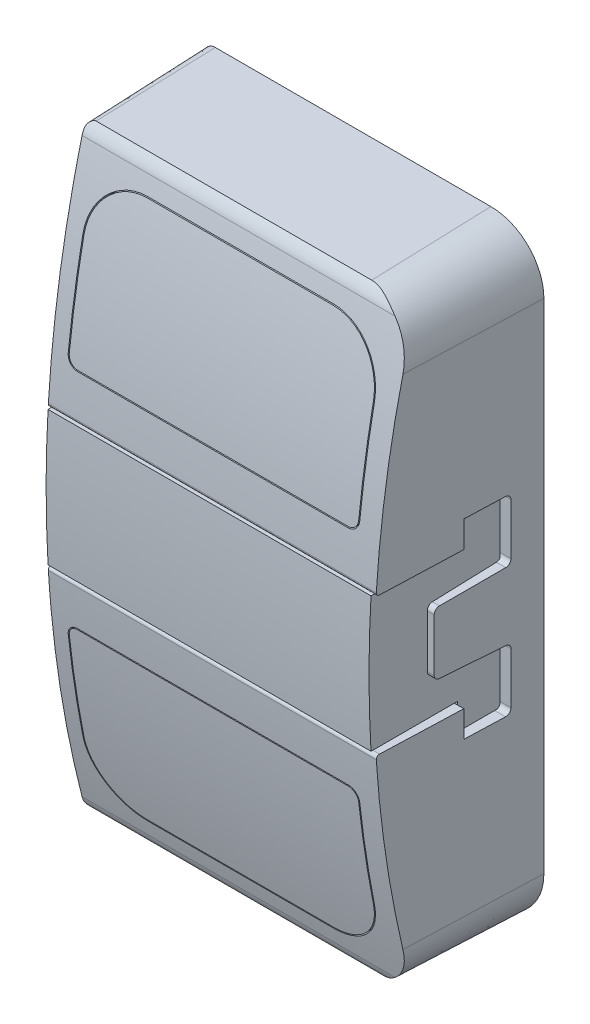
ISO-10303-21;
HEADER;
FILE_DESCRIPTION(('STEP AP214'),'2;1');
FILE_NAME('part.step','',(''),(''),'','','');
FILE_SCHEMA(('AUTOMOTIVE_DESIGN { 1 0 10303 214 1 1 1 1 }'));
ENDSEC;
DATA;
#1=APPLICATION_CONTEXT('core data for automotive mechanical design processes');
#2=APPLICATION_PROTOCOL_DEFINITION('international standard','automotive_design',2000,#1);
#3=PRODUCT_CONTEXT('',#1,'mechanical');
#4=PRODUCT('Part','Part','',(#3));
#5=PRODUCT_RELATED_PRODUCT_CATEGORY('part','',(#4));
#6=PRODUCT_DEFINITION_FORMATION('','',#4);
#7=PRODUCT_DEFINITION_CONTEXT('part definition',#1,'design');
#8=PRODUCT_DEFINITION('design','',#6,#7);
#9=PRODUCT_DEFINITION_SHAPE('','',#8);
#10=(LENGTH_UNIT() NAMED_UNIT(*) SI_UNIT(.MILLI.,.METRE.));
#11=(NAMED_UNIT(*) PLANE_ANGLE_UNIT() SI_UNIT($,.RADIAN.));
#12=(NAMED_UNIT(*) SI_UNIT($,.STERADIAN.) SOLID_ANGLE_UNIT());
#13=UNCERTAINTY_MEASURE_WITH_UNIT(LENGTH_MEASURE(1.E-05),#10,'distance_accuracy_value','');
#14=(GEOMETRIC_REPRESENTATION_CONTEXT(3) GLOBAL_UNCERTAINTY_ASSIGNED_CONTEXT((#13)) GLOBAL_UNIT_ASSIGNED_CONTEXT((#10,
#11,#12)) REPRESENTATION_CONTEXT('',''));
#15=CARTESIAN_POINT('',(0.,0.,0.));
#16=DIRECTION('',(0.,0.,1.));
#17=DIRECTION('',(1.,0.,0.));
#18=AXIS2_PLACEMENT_3D('',#15,#16,#17);
#19=CARTESIAN_POINT('',(8.5,15.4,5.));
#20=DIRECTION('',(0.,1.,0.));
#21=DIRECTION('',(0.,0.,1.));
#22=AXIS2_PLACEMENT_3D('',#19,#20,#21);
#23=PLANE('',#22);
#24=DIRECTION('',(1.,0.,0.));
#25=VECTOR('',#24,1.);
#26=CARTESIAN_POINT('',(8.5,15.4,0.));
#27=LINE('',#26,#25);
#28=CARTESIAN_POINT('',(9.25,15.4,0.));
#29=VERTEX_POINT('',#28);
#30=CARTESIAN_POINT('',(22.75,15.4,0.));
#31=VERTEX_POINT('',#30);
#32=EDGE_CURVE('E676',#29,#31,#27,.T.);
#33=ORIENTED_EDGE('',*,*,#32,.F.);
#34=DIRECTION('',(0.,0.,-1.));
#35=VECTOR('',#34,1.);
#36=CARTESIAN_POINT('',(9.25,15.4,5.));
#37=LINE('',#36,#35);
#38=CARTESIAN_POINT('',(9.25,15.4,5.));
#39=VERTEX_POINT('',#38);
#40=EDGE_CURVE('E662',#39,#29,#37,.T.);
#41=ORIENTED_EDGE('',*,*,#40,.F.);
#42=DIRECTION('',(1.,0.,0.));
#43=VECTOR('',#42,1.);
#44=CARTESIAN_POINT('',(8.5,15.4,5.));
#45=LINE('',#44,#43);
#46=CARTESIAN_POINT('',(22.75,15.4,5.));
#47=VERTEX_POINT('',#46);
#48=EDGE_CURVE('E671',#39,#47,#45,.T.);
#49=ORIENTED_EDGE('',*,*,#48,.T.);
#50=DIRECTION('',(0.,0.,-1.));
#51=VECTOR('',#50,1.);
#52=CARTESIAN_POINT('',(22.75,15.4,5.));
#53=LINE('',#52,#51);
#54=EDGE_CURVE('E2927',#47,#31,#53,.T.);
#55=ORIENTED_EDGE('',*,*,#54,.T.);
#56=EDGE_LOOP('',(#33,#41,#49,#55));
#57=FACE_BOUND('',#56,.T.);
#58=ADVANCED_FACE('F14',(#57),#23,.T.);
#59=CARTESIAN_POINT('',(8.5,-21.6,5.));
#60=DIRECTION('',(0.,1.,0.));
#61=DIRECTION('',(0.,0.,1.));
#62=AXIS2_PLACEMENT_3D('',#59,#60,#61);
#63=PLANE('',#62);
#64=DIRECTION('',(1.,0.,0.));
#65=VECTOR('',#64,1.);
#66=CARTESIAN_POINT('',(8.5,-21.6,0.));
#67=LINE('',#66,#65);
#68=CARTESIAN_POINT('',(9.25,-21.6,0.));
#69=VERTEX_POINT('',#68);
#70=CARTESIAN_POINT('',(22.75,-21.6,0.));
#71=VERTEX_POINT('',#70);
#72=EDGE_CURVE('E683',#69,#71,#67,.T.);
#73=ORIENTED_EDGE('',*,*,#72,.F.);
#74=DIRECTION('',(0.,0.,-1.));
#75=VECTOR('',#74,1.);
#76=CARTESIAN_POINT('',(9.25,-21.6,5.));
#77=LINE('',#76,#75);
#78=CARTESIAN_POINT('',(9.25,-21.6,5.));
#79=VERTEX_POINT('',#78);
#80=EDGE_CURVE('E2937',#79,#69,#77,.T.);
#81=ORIENTED_EDGE('',*,*,#80,.F.);
#82=DIRECTION('',(1.,0.,0.));
#83=VECTOR('',#82,1.);
#84=CARTESIAN_POINT('',(8.5,-21.6,5.));
#85=LINE('',#84,#83);
#86=CARTESIAN_POINT('',(22.75,-21.6,5.));
#87=VERTEX_POINT('',#86);
#88=EDGE_CURVE('E686',#79,#87,#85,.T.);
#89=ORIENTED_EDGE('',*,*,#88,.T.);
#90=DIRECTION('',(0.,0.,-1.));
#91=VECTOR('',#90,1.);
#92=CARTESIAN_POINT('',(22.75,-21.6,5.));
#93=LINE('',#92,#91);
#94=EDGE_CURVE('E2448',#87,#71,#93,.T.);
#95=ORIENTED_EDGE('',*,*,#94,.T.);
#96=EDGE_LOOP('',(#73,#81,#89,#95));
#97=FACE_BOUND('',#96,.T.);
#98=ADVANCED_FACE('F1036',(#97),#63,.T.);
#99=CARTESIAN_POINT('',(23.5,21.6,5.));
#100=DIRECTION('',(0.,-1.,0.));
#101=DIRECTION('',(0.,0.,-1.));
#102=AXIS2_PLACEMENT_3D('',#99,#100,#101);
#103=PLANE('',#102);
#104=DIRECTION('',(0.,0.,-1.));
#105=VECTOR('',#104,1.);
#106=CARTESIAN_POINT('',(9.25,21.6,5.));
#107=LINE('',#106,#105);
#108=CARTESIAN_POINT('',(9.25,21.6,5.));
#109=VERTEX_POINT('',#108);
#110=CARTESIAN_POINT('',(9.25,21.6,0.));
#111=VERTEX_POINT('',#110);
#112=EDGE_CURVE('E654',#109,#111,#107,.T.);
#113=ORIENTED_EDGE('',*,*,#112,.T.);
#114=DIRECTION('',(-1.,0.,0.));
#115=VECTOR('',#114,1.);
#116=CARTESIAN_POINT('',(23.5,21.6,0.));
#117=LINE('',#116,#115);
#118=CARTESIAN_POINT('',(22.75,21.6,0.));
#119=VERTEX_POINT('',#118);
#120=EDGE_CURVE('E680',#119,#111,#117,.T.);
#121=ORIENTED_EDGE('',*,*,#120,.F.);
#122=DIRECTION('',(0.,0.,-1.));
#123=VECTOR('',#122,1.);
#124=CARTESIAN_POINT('',(22.75,21.6,5.));
#125=LINE('',#124,#123);
#126=CARTESIAN_POINT('',(22.75,21.6,5.));
#127=VERTEX_POINT('',#126);
#128=EDGE_CURVE('E675',#127,#119,#125,.T.);
#129=ORIENTED_EDGE('',*,*,#128,.F.);
#130=DIRECTION('',(-1.,0.,0.));
#131=VECTOR('',#130,1.);
#132=CARTESIAN_POINT('',(23.5,21.6,5.));
#133=LINE('',#132,#131);
#134=EDGE_CURVE('E670',#127,#109,#133,.T.);
#135=ORIENTED_EDGE('',*,*,#134,.T.);
#136=EDGE_LOOP('',(#113,#121,#129,#135));
#137=FACE_BOUND('',#136,.T.);
#138=ADVANCED_FACE('F674',(#137),#103,.T.);
#139=CARTESIAN_POINT('',(23.5,-15.4,5.));
#140=DIRECTION('',(0.,-1.,0.));
#141=DIRECTION('',(0.,0.,-1.));
#142=AXIS2_PLACEMENT_3D('',#139,#140,#141);
#143=PLANE('',#142);
#144=DIRECTION('',(0.,0.,-1.));
#145=VECTOR('',#144,1.);
#146=CARTESIAN_POINT('',(9.25,-15.4,5.));
#147=LINE('',#146,#145);
#148=CARTESIAN_POINT('',(9.25,-15.4,5.));
#149=VERTEX_POINT('',#148);
#150=CARTESIAN_POINT('',(9.25,-15.4,0.));
#151=VERTEX_POINT('',#150);
#152=EDGE_CURVE('E2935',#149,#151,#147,.T.);
#153=ORIENTED_EDGE('',*,*,#152,.T.);
#154=DIRECTION('',(-1.,0.,0.));
#155=VECTOR('',#154,1.);
#156=CARTESIAN_POINT('',(23.5,-15.4,0.));
#157=LINE('',#156,#155);
#158=CARTESIAN_POINT('',(22.75,-15.4,0.));
#159=VERTEX_POINT('',#158);
#160=EDGE_CURVE('E2432',#159,#151,#157,.T.);
#161=ORIENTED_EDGE('',*,*,#160,.F.);
#162=DIRECTION('',(0.,0.,-1.));
#163=VECTOR('',#162,1.);
#164=CARTESIAN_POINT('',(22.75,-15.4,5.));
#165=LINE('',#164,#163);
#166=CARTESIAN_POINT('',(22.75,-15.4,5.));
#167=VERTEX_POINT('',#166);
#168=EDGE_CURVE('E2451',#167,#159,#165,.T.);
#169=ORIENTED_EDGE('',*,*,#168,.F.);
#170=DIRECTION('',(-1.,0.,0.));
#171=VECTOR('',#170,1.);
#172=CARTESIAN_POINT('',(23.5,-15.4,5.));
#173=LINE('',#172,#171);
#174=EDGE_CURVE('E2436',#167,#149,#173,.T.);
#175=ORIENTED_EDGE('',*,*,#174,.T.);
#176=EDGE_LOOP('',(#153,#161,#169,#175));
#177=FACE_BOUND('',#176,.T.);
#178=ADVANCED_FACE('F1025',(#177),#143,.T.);
#179=CARTESIAN_POINT('',(7.5,20.,10.));
#180=DIRECTION('',(0.,0.,1.));
#181=DIRECTION('',(0.,-1.,0.));
#182=AXIS2_PLACEMENT_3D('',#179,#180,#181);
#183=PLANE('',#182);
#184=CARTESIAN_POINT('',(23.75,17.,10.));
#185=DIRECTION('',(0.,0.,1.));
#186=DIRECTION('',(0.,1.,0.));
#187=AXIS2_PLACEMENT_3D('',#184,#185,#186);
#188=CIRCLE('',#187,5.);
#189=CARTESIAN_POINT('',(23.75,12.,10.));
#190=VERTEX_POINT('',#189);
#191=CARTESIAN_POINT('',(28.75,17.,10.));
#192=VERTEX_POINT('',#191);
#193=EDGE_CURVE('E2455',#190,#192,#188,.T.);
#194=ORIENTED_EDGE('',*,*,#193,.F.);
#195=DIRECTION('',(1.,0.,0.));
#196=VECTOR('',#195,1.);
#197=CARTESIAN_POINT('',(7.5,12.,10.));
#198=LINE('',#197,#196);
#199=CARTESIAN_POINT('',(8.25,12.,10.));
#200=VERTEX_POINT('',#199);
#201=EDGE_CURVE('E2428',#200,#190,#198,.T.);
#202=ORIENTED_EDGE('',*,*,#201,.F.);
#203=CARTESIAN_POINT('',(8.25,17.,10.));
#204=DIRECTION('',(0.,0.,1.));
#205=DIRECTION('',(0.,1.,0.));
#206=AXIS2_PLACEMENT_3D('',#203,#204,#205);
#207=CIRCLE('',#206,5.);
#208=CARTESIAN_POINT('',(3.25,17.,10.));
#209=VERTEX_POINT('',#208);
#210=EDGE_CURVE('E2485',#209,#200,#207,.T.);
#211=ORIENTED_EDGE('',*,*,#210,.F.);
#212=DIRECTION('',(0.,-1.,0.));
#213=VECTOR('',#212,1.);
#214=CARTESIAN_POINT('',(3.25,17.,10.));
#215=LINE('',#214,#213);
#216=CARTESIAN_POINT('',(3.25,20.,10.));
#217=VERTEX_POINT('',#216);
#218=EDGE_CURVE('E2490',#217,#209,#215,.T.);
#219=ORIENTED_EDGE('',*,*,#218,.F.);
#220=CARTESIAN_POINT('',(8.25,20.,10.));
#221=DIRECTION('',(0.,0.,1.));
#222=DIRECTION('',(0.,1.,0.));
#223=AXIS2_PLACEMENT_3D('',#220,#221,#222);
#224=CIRCLE('',#223,5.);
#225=CARTESIAN_POINT('',(8.25,25.,10.));
#226=VERTEX_POINT('',#225);
#227=EDGE_CURVE('E2498',#226,#217,#224,.T.);
#228=ORIENTED_EDGE('',*,*,#227,.F.);
#229=DIRECTION('',(-1.,0.,0.));
#230=VECTOR('',#229,1.);
#231=CARTESIAN_POINT('',(24.5,25.,10.));
#232=LINE('',#231,#230);
#233=CARTESIAN_POINT('',(23.75,25.,10.));
#234=VERTEX_POINT('',#233);
#235=EDGE_CURVE('E2426',#234,#226,#232,.T.);
#236=ORIENTED_EDGE('',*,*,#235,.F.);
#237=CARTESIAN_POINT('',(23.75,20.,10.));
#238=DIRECTION('',(0.,0.,1.));
#239=DIRECTION('',(0.,1.,0.));
#240=AXIS2_PLACEMENT_3D('',#237,#238,#239);
#241=CIRCLE('',#240,5.);
#242=CARTESIAN_POINT('',(28.75,20.,10.));
#243=VERTEX_POINT('',#242);
#244=EDGE_CURVE('E2467',#243,#234,#241,.T.);
#245=ORIENTED_EDGE('',*,*,#244,.F.);
#246=DIRECTION('',(0.,1.,0.));
#247=VECTOR('',#246,1.);
#248=CARTESIAN_POINT('',(28.75,17.,10.));
#249=LINE('',#248,#247);
#250=EDGE_CURVE('E2458',#192,#243,#249,.T.);
#251=ORIENTED_EDGE('',*,*,#250,.F.);
#252=EDGE_LOOP('',(#194,#202,#211,#219,#228,#236,#245,#251));
#253=FACE_BOUND('',#252,.T.);
#254=ADVANCED_FACE('F1022',(#253),#183,.F.);
#255=CARTESIAN_POINT('',(7.5,20.,5.));
#256=DIRECTION('',(0.,0.,1.));
#257=DIRECTION('',(0.,-1.,0.));
#258=AXIS2_PLACEMENT_3D('',#255,#256,#257);
#259=PLANE('',#258);
#260=CARTESIAN_POINT('',(9.25,18.5,5.));
#261=DIRECTION('',(0.,0.,1.));
#262=DIRECTION('',(0.,1.,0.));
#263=AXIS2_PLACEMENT_3D('',#260,#261,#262);
#264=CIRCLE('',#263,3.1);
#265=EDGE_CURVE('E657',#109,#39,#264,.T.);
#266=ORIENTED_EDGE('',*,*,#265,.F.);
#267=ORIENTED_EDGE('',*,*,#134,.F.);
#268=CARTESIAN_POINT('',(22.75,18.5,5.));
#269=DIRECTION('',(0.,0.,1.));
#270=DIRECTION('',(0.,1.,0.));
#271=AXIS2_PLACEMENT_3D('',#268,#269,#270);
#272=CIRCLE('',#271,3.1);
#273=EDGE_CURVE('E2930',#47,#127,#272,.T.);
#274=ORIENTED_EDGE('',*,*,#273,.F.);
#275=ORIENTED_EDGE('',*,*,#48,.F.);
#276=EDGE_LOOP('',(#266,#267,#274,#275));
#277=FACE_BOUND('',#276,.T.);
#278=DIRECTION('',(1.,0.,0.));
#279=VECTOR('',#278,1.);
#280=CARTESIAN_POINT('',(7.5,12.,5.));
#281=LINE('',#280,#279);
#282=CARTESIAN_POINT('',(8.25,12.,5.));
#283=VERTEX_POINT('',#282);
#284=CARTESIAN_POINT('',(23.75,12.,5.));
#285=VERTEX_POINT('',#284);
#286=EDGE_CURVE('E2429',#283,#285,#281,.T.);
#287=ORIENTED_EDGE('',*,*,#286,.T.);
#288=CARTESIAN_POINT('',(23.75,17.,5.));
#289=DIRECTION('',(0.,0.,1.));
#290=DIRECTION('',(0.,1.,0.));
#291=AXIS2_PLACEMENT_3D('',#288,#289,#290);
#292=CIRCLE('',#291,5.);
#293=CARTESIAN_POINT('',(28.75,17.,5.));
#294=VERTEX_POINT('',#293);
#295=EDGE_CURVE('E2463',#285,#294,#292,.T.);
#296=ORIENTED_EDGE('',*,*,#295,.T.);
#297=DIRECTION('',(0.,1.,0.));
#298=VECTOR('',#297,1.);
#299=CARTESIAN_POINT('',(28.75,17.,5.));
#300=LINE('',#299,#298);
#301=CARTESIAN_POINT('',(28.75,20.,5.));
#302=VERTEX_POINT('',#301);
#303=EDGE_CURVE('E2466',#294,#302,#300,.T.);
#304=ORIENTED_EDGE('',*,*,#303,.T.);
#305=CARTESIAN_POINT('',(23.75,20.,5.));
#306=DIRECTION('',(0.,0.,1.));
#307=DIRECTION('',(0.,1.,0.));
#308=AXIS2_PLACEMENT_3D('',#305,#306,#307);
#309=CIRCLE('',#308,5.);
#310=CARTESIAN_POINT('',(23.75,25.,5.));
#311=VERTEX_POINT('',#310);
#312=EDGE_CURVE('E2470',#302,#311,#309,.T.);
#313=ORIENTED_EDGE('',*,*,#312,.T.);
#314=DIRECTION('',(-1.,0.,0.));
#315=VECTOR('',#314,1.);
#316=CARTESIAN_POINT('',(24.5,25.,5.));
#317=LINE('',#316,#315);
#318=CARTESIAN_POINT('',(8.25,25.,5.));
#319=VERTEX_POINT('',#318);
#320=EDGE_CURVE('E2422',#311,#319,#317,.T.);
#321=ORIENTED_EDGE('',*,*,#320,.T.);
#322=CARTESIAN_POINT('',(8.25,20.,5.));
#323=DIRECTION('',(0.,0.,1.));
#324=DIRECTION('',(0.,1.,0.));
#325=AXIS2_PLACEMENT_3D('',#322,#323,#324);
#326=CIRCLE('',#325,5.);
#327=CARTESIAN_POINT('',(3.25,20.,5.));
#328=VERTEX_POINT('',#327);
#329=EDGE_CURVE('E2489',#319,#328,#326,.T.);
#330=ORIENTED_EDGE('',*,*,#329,.T.);
#331=DIRECTION('',(0.,-1.,0.));
#332=VECTOR('',#331,1.);
#333=CARTESIAN_POINT('',(3.25,17.,5.));
#334=LINE('',#333,#332);
#335=CARTESIAN_POINT('',(3.25,17.,5.));
#336=VERTEX_POINT('',#335);
#337=EDGE_CURVE('E2493',#328,#336,#334,.T.);
#338=ORIENTED_EDGE('',*,*,#337,.T.);
#339=CARTESIAN_POINT('',(8.25,17.,5.));
#340=DIRECTION('',(0.,0.,1.));
#341=DIRECTION('',(0.,1.,0.));
#342=AXIS2_PLACEMENT_3D('',#339,#340,#341);
#343=CIRCLE('',#342,5.);
#344=EDGE_CURVE('E2486',#336,#283,#343,.T.);
#345=ORIENTED_EDGE('',*,*,#344,.T.);
#346=EDGE_LOOP('',(#287,#296,#304,#313,#321,#330,#338,#345));
#347=FACE_BOUND('',#346,.T.);
#348=ADVANCED_FACE('F667',(#277,#347),#259,.T.);
#349=CARTESIAN_POINT('',(24.5,25.,10.));
#350=DIRECTION('',(0.,-1.,0.));
#351=DIRECTION('',(0.,0.,-1.));
#352=AXIS2_PLACEMENT_3D('',#349,#350,#351);
#353=PLANE('',#352);
#354=ORIENTED_EDGE('',*,*,#320,.F.);
#355=DIRECTION('',(0.,0.,1.));
#356=VECTOR('',#355,1.);
#357=CARTESIAN_POINT('',(23.75,25.,5.));
#358=LINE('',#357,#356);
#359=EDGE_CURVE('E2477',#311,#234,#358,.T.);
#360=ORIENTED_EDGE('',*,*,#359,.T.);
#361=ORIENTED_EDGE('',*,*,#235,.T.);
#362=DIRECTION('',(0.,0.,1.));
#363=VECTOR('',#362,1.);
#364=CARTESIAN_POINT('',(8.25,25.,5.));
#365=LINE('',#364,#363);
#366=EDGE_CURVE('E2506',#319,#226,#365,.T.);
#367=ORIENTED_EDGE('',*,*,#366,.F.);
#368=EDGE_LOOP('',(#354,#360,#361,#367));
#369=FACE_BOUND('',#368,.T.);
#370=ADVANCED_FACE('F1029',(#369),#353,.T.);
#371=CARTESIAN_POINT('',(7.5,12.,10.));
#372=DIRECTION('',(0.,1.,0.));
#373=DIRECTION('',(0.,0.,1.));
#374=AXIS2_PLACEMENT_3D('',#371,#372,#373);
#375=PLANE('',#374);
#376=DIRECTION('',(0.,0.,1.));
#377=VECTOR('',#376,1.);
#378=CARTESIAN_POINT('',(23.75,12.,5.));
#379=LINE('',#378,#377);
#380=EDGE_CURVE('E2472',#285,#190,#379,.T.);
#381=ORIENTED_EDGE('',*,*,#380,.F.);
#382=ORIENTED_EDGE('',*,*,#286,.F.);
#383=DIRECTION('',(0.,0.,1.));
#384=VECTOR('',#383,1.);
#385=CARTESIAN_POINT('',(8.25,12.,5.));
#386=LINE('',#385,#384);
#387=EDGE_CURVE('E2509',#283,#200,#386,.T.);
#388=ORIENTED_EDGE('',*,*,#387,.T.);
#389=ORIENTED_EDGE('',*,*,#201,.T.);
#390=EDGE_LOOP('',(#381,#382,#388,#389));
#391=FACE_BOUND('',#390,.T.);
#392=ADVANCED_FACE('F1008',(#391),#375,.T.);
#393=CARTESIAN_POINT('',(7.5,-17.,10.));
#394=DIRECTION('',(0.,0.,1.));
#395=DIRECTION('',(0.,-1.,0.));
#396=AXIS2_PLACEMENT_3D('',#393,#394,#395);
#397=PLANE('',#396);
#398=CARTESIAN_POINT('',(23.75,-20.,10.));
#399=DIRECTION('',(0.,0.,1.));
#400=DIRECTION('',(0.,1.,0.));
#401=AXIS2_PLACEMENT_3D('',#398,#399,#400);
#402=CIRCLE('',#401,5.);
#403=CARTESIAN_POINT('',(23.75,-25.,10.));
#404=VERTEX_POINT('',#403);
#405=CARTESIAN_POINT('',(28.75,-20.,10.));
#406=VERTEX_POINT('',#405);
#407=EDGE_CURVE('E2512',#404,#406,#402,.T.);
#408=ORIENTED_EDGE('',*,*,#407,.F.);
#409=DIRECTION('',(1.,0.,0.));
#410=VECTOR('',#409,1.);
#411=CARTESIAN_POINT('',(7.5,-25.,10.));
#412=LINE('',#411,#410);
#413=CARTESIAN_POINT('',(8.25,-25.,10.));
#414=VERTEX_POINT('',#413);
#415=EDGE_CURVE('E2418',#414,#404,#412,.T.);
#416=ORIENTED_EDGE('',*,*,#415,.F.);
#417=CARTESIAN_POINT('',(8.25,-20.,10.));
#418=DIRECTION('',(0.,0.,1.));
#419=DIRECTION('',(0.,1.,0.));
#420=AXIS2_PLACEMENT_3D('',#417,#418,#419);
#421=CIRCLE('',#420,5.);
#422=CARTESIAN_POINT('',(3.25,-20.,10.));
#423=VERTEX_POINT('',#422);
#424=EDGE_CURVE('E2538',#423,#414,#421,.T.);
#425=ORIENTED_EDGE('',*,*,#424,.F.);
#426=DIRECTION('',(0.,-1.,0.));
#427=VECTOR('',#426,1.);
#428=CARTESIAN_POINT('',(3.25,-20.,10.));
#429=LINE('',#428,#427);
#430=CARTESIAN_POINT('',(3.25,-17.,10.));
#431=VERTEX_POINT('',#430);
#432=EDGE_CURVE('E2543',#431,#423,#429,.T.);
#433=ORIENTED_EDGE('',*,*,#432,.F.);
#434=CARTESIAN_POINT('',(8.25,-17.,10.));
#435=DIRECTION('',(0.,0.,1.));
#436=DIRECTION('',(0.,1.,0.));
#437=AXIS2_PLACEMENT_3D('',#434,#435,#436);
#438=CIRCLE('',#437,5.);
#439=CARTESIAN_POINT('',(8.25,-12.,10.));
#440=VERTEX_POINT('',#439);
#441=EDGE_CURVE('E2551',#440,#431,#438,.T.);
#442=ORIENTED_EDGE('',*,*,#441,.F.);
#443=DIRECTION('',(-1.,0.,0.));
#444=VECTOR('',#443,1.);
#445=CARTESIAN_POINT('',(24.5,-12.,10.));
#446=LINE('',#445,#444);
#447=CARTESIAN_POINT('',(23.75,-12.,10.));
#448=VERTEX_POINT('',#447);
#449=EDGE_CURVE('E2416',#448,#440,#446,.T.);
#450=ORIENTED_EDGE('',*,*,#449,.F.);
#451=CARTESIAN_POINT('',(23.75,-17.,10.));
#452=DIRECTION('',(0.,0.,1.));
#453=DIRECTION('',(0.,1.,0.));
#454=AXIS2_PLACEMENT_3D('',#451,#452,#453);
#455=CIRCLE('',#454,5.);
#456=CARTESIAN_POINT('',(28.75,-17.,10.));
#457=VERTEX_POINT('',#456);
#458=EDGE_CURVE('E2517',#457,#448,#455,.T.);
#459=ORIENTED_EDGE('',*,*,#458,.F.);
#460=DIRECTION('',(0.,1.,0.));
#461=VECTOR('',#460,1.);
#462=CARTESIAN_POINT('',(28.75,-20.,10.));
#463=LINE('',#462,#461);
#464=EDGE_CURVE('E2526',#406,#457,#463,.T.);
#465=ORIENTED_EDGE('',*,*,#464,.F.);
#466=EDGE_LOOP('',(#408,#416,#425,#433,#442,#450,#459,#465));
#467=FACE_BOUND('',#466,.T.);
#468=ADVANCED_FACE('F1004',(#467),#397,.F.);
#469=CARTESIAN_POINT('',(7.5,-17.,5.));
#470=DIRECTION('',(0.,0.,1.));
#471=DIRECTION('',(0.,-1.,0.));
#472=AXIS2_PLACEMENT_3D('',#469,#470,#471);
#473=PLANE('',#472);
#474=CARTESIAN_POINT('',(9.25,-18.5,5.));
#475=DIRECTION('',(0.,0.,1.));
#476=DIRECTION('',(0.,1.,0.));
#477=AXIS2_PLACEMENT_3D('',#474,#475,#476);
#478=CIRCLE('',#477,3.1);
#479=EDGE_CURVE('E2939',#149,#79,#478,.T.);
#480=ORIENTED_EDGE('',*,*,#479,.F.);
#481=ORIENTED_EDGE('',*,*,#174,.F.);
#482=CARTESIAN_POINT('',(22.75,-18.5,5.));
#483=DIRECTION('',(0.,0.,1.));
#484=DIRECTION('',(0.,1.,0.));
#485=AXIS2_PLACEMENT_3D('',#482,#483,#484);
#486=CIRCLE('',#485,3.1);
#487=EDGE_CURVE('E2452',#87,#167,#486,.T.);
#488=ORIENTED_EDGE('',*,*,#487,.F.);
#489=ORIENTED_EDGE('',*,*,#88,.F.);
#490=EDGE_LOOP('',(#480,#481,#488,#489));
#491=FACE_BOUND('',#490,.T.);
#492=DIRECTION('',(1.,0.,0.));
#493=VECTOR('',#492,1.);
#494=CARTESIAN_POINT('',(7.5,-25.,5.));
#495=LINE('',#494,#493);
#496=CARTESIAN_POINT('',(8.25,-25.,5.));
#497=VERTEX_POINT('',#496);
#498=CARTESIAN_POINT('',(23.75,-25.,5.));
#499=VERTEX_POINT('',#498);
#500=EDGE_CURVE('E2419',#497,#499,#495,.T.);
#501=ORIENTED_EDGE('',*,*,#500,.T.);
#502=CARTESIAN_POINT('',(23.75,-20.,5.));
#503=DIRECTION('',(0.,0.,1.));
#504=DIRECTION('',(0.,1.,0.));
#505=AXIS2_PLACEMENT_3D('',#502,#503,#504);
#506=CIRCLE('',#505,5.);
#507=CARTESIAN_POINT('',(28.75,-20.,5.));
#508=VERTEX_POINT('',#507);
#509=EDGE_CURVE('E2513',#499,#508,#506,.T.);
#510=ORIENTED_EDGE('',*,*,#509,.T.);
#511=DIRECTION('',(0.,1.,0.));
#512=VECTOR('',#511,1.);
#513=CARTESIAN_POINT('',(28.75,-20.,5.));
#514=LINE('',#513,#512);
#515=CARTESIAN_POINT('',(28.75,-17.,5.));
#516=VERTEX_POINT('',#515);
#517=EDGE_CURVE('E2516',#508,#516,#514,.T.);
#518=ORIENTED_EDGE('',*,*,#517,.T.);
#519=CARTESIAN_POINT('',(23.75,-17.,5.));
#520=DIRECTION('',(0.,0.,1.));
#521=DIRECTION('',(0.,1.,0.));
#522=AXIS2_PLACEMENT_3D('',#519,#520,#521);
#523=CIRCLE('',#522,5.);
#524=CARTESIAN_POINT('',(23.75,-12.,5.));
#525=VERTEX_POINT('',#524);
#526=EDGE_CURVE('E2520',#516,#525,#523,.T.);
#527=ORIENTED_EDGE('',*,*,#526,.T.);
#528=DIRECTION('',(-1.,0.,0.));
#529=VECTOR('',#528,1.);
#530=CARTESIAN_POINT('',(24.5,-12.,5.));
#531=LINE('',#530,#529);
#532=CARTESIAN_POINT('',(8.25,-12.,5.));
#533=VERTEX_POINT('',#532);
#534=EDGE_CURVE('E2415',#525,#533,#531,.T.);
#535=ORIENTED_EDGE('',*,*,#534,.T.);
#536=CARTESIAN_POINT('',(8.25,-17.,5.));
#537=DIRECTION('',(0.,0.,1.));
#538=DIRECTION('',(0.,1.,0.));
#539=AXIS2_PLACEMENT_3D('',#536,#537,#538);
#540=CIRCLE('',#539,5.);
#541=CARTESIAN_POINT('',(3.25,-17.,5.));
#542=VERTEX_POINT('',#541);
#543=EDGE_CURVE('E2542',#533,#542,#540,.T.);
#544=ORIENTED_EDGE('',*,*,#543,.T.);
#545=DIRECTION('',(0.,-1.,0.));
#546=VECTOR('',#545,1.);
#547=CARTESIAN_POINT('',(3.25,-20.,5.));
#548=LINE('',#547,#546);
#549=CARTESIAN_POINT('',(3.25,-20.,5.));
#550=VERTEX_POINT('',#549);
#551=EDGE_CURVE('E2546',#542,#550,#548,.T.);
#552=ORIENTED_EDGE('',*,*,#551,.T.);
#553=CARTESIAN_POINT('',(8.25,-20.,5.));
#554=DIRECTION('',(0.,0.,1.));
#555=DIRECTION('',(0.,1.,0.));
#556=AXIS2_PLACEMENT_3D('',#553,#554,#555);
#557=CIRCLE('',#556,5.);
#558=EDGE_CURVE('E2539',#550,#497,#557,.T.);
#559=ORIENTED_EDGE('',*,*,#558,.T.);
#560=EDGE_LOOP('',(#501,#510,#518,#527,#535,#544,#552,#559));
#561=FACE_BOUND('',#560,.T.);
#562=ADVANCED_FACE('F1007',(#491,#561),#473,.T.);
#563=CARTESIAN_POINT('',(24.5,-12.,10.));
#564=DIRECTION('',(0.,-1.,0.));
#565=DIRECTION('',(0.,0.,-1.));
#566=AXIS2_PLACEMENT_3D('',#563,#564,#565);
#567=PLANE('',#566);
#568=ORIENTED_EDGE('',*,*,#534,.F.);
#569=DIRECTION('',(0.,0.,1.));
#570=VECTOR('',#569,1.);
#571=CARTESIAN_POINT('',(23.75,-12.,5.));
#572=LINE('',#571,#570);
#573=EDGE_CURVE('E2530',#525,#448,#572,.T.);
#574=ORIENTED_EDGE('',*,*,#573,.T.);
#575=ORIENTED_EDGE('',*,*,#449,.T.);
#576=DIRECTION('',(0.,0.,1.));
#577=VECTOR('',#576,1.);
#578=CARTESIAN_POINT('',(8.25,-12.,5.));
#579=LINE('',#578,#577);
#580=EDGE_CURVE('E2559',#533,#440,#579,.T.);
#581=ORIENTED_EDGE('',*,*,#580,.F.);
#582=EDGE_LOOP('',(#568,#574,#575,#581));
#583=FACE_BOUND('',#582,.T.);
#584=ADVANCED_FACE('F1012',(#583),#567,.T.);
#585=CARTESIAN_POINT('',(7.5,-25.,10.));
#586=DIRECTION('',(0.,1.,0.));
#587=DIRECTION('',(0.,0.,1.));
#588=AXIS2_PLACEMENT_3D('',#585,#586,#587);
#589=PLANE('',#588);
#590=DIRECTION('',(0.,0.,1.));
#591=VECTOR('',#590,1.);
#592=CARTESIAN_POINT('',(23.75,-25.,5.));
#593=LINE('',#592,#591);
#594=EDGE_CURVE('E2523',#499,#404,#593,.T.);
#595=ORIENTED_EDGE('',*,*,#594,.F.);
#596=ORIENTED_EDGE('',*,*,#500,.F.);
#597=DIRECTION('',(0.,0.,1.));
#598=VECTOR('',#597,1.);
#599=CARTESIAN_POINT('',(8.25,-25.,5.));
#600=LINE('',#599,#598);
#601=EDGE_CURVE('E2562',#497,#414,#600,.T.);
#602=ORIENTED_EDGE('',*,*,#601,.T.);
#603=ORIENTED_EDGE('',*,*,#415,.T.);
#604=EDGE_LOOP('',(#595,#596,#602,#603));
#605=FACE_BOUND('',#604,.T.);
#606=ADVANCED_FACE('F1014',(#605),#589,.T.);
#607=CARTESIAN_POINT('',(0.,27.5,0.));
#608=DIRECTION('',(-0.999390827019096,0.,0.0348994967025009));
#609=DIRECTION('',(0.0348994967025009,0.,0.999390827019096));
#610=AXIS2_PLACEMENT_3D('',#607,#608,#609);
#611=PLANE('',#610);
#612=DIRECTION('',(0.,1.,0.));
#613=VECTOR('',#612,1.);
#614=CARTESIAN_POINT('',(0.110000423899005,27.5,3.15));
#615=LINE('',#614,#613);
#616=CARTESIAN_POINT('',(0.110000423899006,3.3257729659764,3.15));
#617=VERTEX_POINT('',#616);
#618=CARTESIAN_POINT('',(0.110000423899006,-3.3257729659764,3.15));
#619=VERTEX_POINT('',#618);
#620=EDGE_CURVE('E2607',#617,#619,#615,.F.);
#621=ORIENTED_EDGE('',*,*,#620,.F.);
#622=CARTESIAN_POINT('',(0.122222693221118,3.68284438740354,3.5));
#623=DIRECTION('',(-0.999390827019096,0.,0.0348994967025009));
#624=DIRECTION('',(0.0348994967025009,0.,0.999390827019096));
#625=AXIS2_PLACEMENT_3D('',#622,#623,#624);
#626=ELLIPSE('',#625,0.500304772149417,0.500000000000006);
#627=CARTESIAN_POINT('',(0.104762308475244,3.68284438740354,3.));
#628=VERTEX_POINT('',#627);
#629=EDGE_CURVE('E2120',#617,#628,#626,.F.);
#630=ORIENTED_EDGE('',*,*,#629,.T.);
#631=DIRECTION('',(0.,-1.,0.));
#632=VECTOR('',#631,1.);
#633=CARTESIAN_POINT('',(0.104762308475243,27.5,3.));
#634=LINE('',#633,#632);
#635=CARTESIAN_POINT('',(0.104762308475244,8.5,3.));
#636=VERTEX_POINT('',#635);
#637=EDGE_CURVE('E2117',#628,#636,#634,.F.);
#638=ORIENTED_EDGE('',*,*,#637,.T.);
#639=CARTESIAN_POINT('',(0.122222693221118,8.5,3.5));
#640=DIRECTION('',(-0.999390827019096,0.,0.0348994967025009));
#641=DIRECTION('',(0.0348994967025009,0.,0.999390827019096));
#642=AXIS2_PLACEMENT_3D('',#639,#640,#641);
#643=ELLIPSE('',#642,0.500304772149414,0.5);
#644=CARTESIAN_POINT('',(0.122222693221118,9.,3.5));
#645=VERTEX_POINT('',#644);
#646=EDGE_CURVE('E2114',#636,#645,#643,.F.);
#647=ORIENTED_EDGE('',*,*,#646,.T.);
#648=DIRECTION('',(-0.0348994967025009,0.,-0.999390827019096));
#649=VECTOR('',#648,1.);
#650=CARTESIAN_POINT('',(0.,9.,0.));
#651=LINE('',#650,#649);
#652=CARTESIAN_POINT('',(0.254921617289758,9.,7.3));
#653=VERTEX_POINT('',#652);
#654=EDGE_CURVE('E2111',#645,#653,#651,.F.);
#655=ORIENTED_EDGE('',*,*,#654,.T.);
#656=DIRECTION('',(0.,1.,0.));
#657=VECTOR('',#656,1.);
#658=CARTESIAN_POINT('',(0.254921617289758,27.5,7.3));
#659=LINE('',#658,#657);
#660=CARTESIAN_POINT('',(0.254921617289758,6.5,7.3));
#661=VERTEX_POINT('',#660);
#662=EDGE_CURVE('E2108',#653,#661,#659,.F.);
#663=ORIENTED_EDGE('',*,*,#662,.T.);
#664=DIRECTION('',(-0.0348994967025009,0.,-0.999390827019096));
#665=VECTOR('',#664,1.);
#666=CARTESIAN_POINT('',(0.,6.5,0.));
#667=LINE('',#666,#665);
#668=CARTESIAN_POINT('',(0.523113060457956,6.5,14.9799980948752));
#669=VERTEX_POINT('',#668);
#670=EDGE_CURVE('E2105',#661,#669,#667,.F.);
#671=ORIENTED_EDGE('',*,*,#670,.T.);
#672=CARTESIAN_POINT('',(0.523113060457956,6.8,14.9799980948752));
#673=DIRECTION('',(-0.999390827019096,0.,0.0348994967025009));
#674=DIRECTION('',(0.0348994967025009,0.,0.999390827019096));
#675=AXIS2_PLACEMENT_3D('',#672,#673,#674);
#676=ELLIPSE('',#675,0.300182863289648,0.3);
#677=CARTESIAN_POINT('',(0.53356738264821,6.81939163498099,15.2793707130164));
#678=VERTEX_POINT('',#677);
#679=EDGE_CURVE('E2103',#678,#669,#676,.F.);
#680=ORIENTED_EDGE('',*,*,#679,.F.);
#681=CARTESIAN_POINT('',(-3.14286925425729,0.,-90.));
#682=DIRECTION('',(-0.999390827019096,0.,0.0348994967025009));
#683=DIRECTION('',(-0.0348994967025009,0.,-0.999390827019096));
#684=AXIS2_PLACEMENT_3D('',#681,#682,#683);
#685=ELLIPSE('',#684,105.564306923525,105.5);
#686=CARTESIAN_POINT('',(0.418466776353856,27.012077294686,11.9833205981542));
#687=VERTEX_POINT('',#686);
#688=EDGE_CURVE('E704',#678,#687,#685,.T.);
#689=ORIENTED_EDGE('',*,*,#688,.T.);
#690=CARTESIAN_POINT('',(0.350953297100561,26.5,10.0499875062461));
#691=DIRECTION('',(-0.999390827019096,0.,0.0348994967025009));
#692=DIRECTION('',(-0.0348994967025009,0.,-0.999390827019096));
#693=AXIS2_PLACEMENT_3D('',#690,#691,#692);
#694=ELLIPSE('',#693,2.00121908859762,2.);
#695=CARTESIAN_POINT('',(0.411437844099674,27.5,11.782038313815));
#696=VERTEX_POINT('',#695);
#697=EDGE_CURVE('E2786',#687,#696,#694,.T.);
#698=ORIENTED_EDGE('',*,*,#697,.T.);
#699=DIRECTION('',(-0.0348994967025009,0.,-0.999390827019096));
#700=VECTOR('',#699,1.);
#701=CARTESIAN_POINT('',(0.,27.5,0.));
#702=LINE('',#701,#700);
#703=CARTESIAN_POINT('',(0.,27.5,0.));
#704=VERTEX_POINT('',#703);
#705=EDGE_CURVE('E2711',#696,#704,#702,.T.);
#706=ORIENTED_EDGE('',*,*,#705,.T.);
#707=DIRECTION('',(0.,-1.,0.));
#708=VECTOR('',#707,1.);
#709=CARTESIAN_POINT('',(0.,27.5,0.));
#710=LINE('',#709,#708);
#711=CARTESIAN_POINT('',(0.,-27.5,0.));
#712=VERTEX_POINT('',#711);
#713=EDGE_CURVE('E2746',#704,#712,#710,.T.);
#714=ORIENTED_EDGE('',*,*,#713,.T.);
#715=DIRECTION('',(-0.0348994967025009,0.,-0.999390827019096));
#716=VECTOR('',#715,1.);
#717=CARTESIAN_POINT('',(0.,-27.5,0.));
#718=LINE('',#717,#716);
#719=CARTESIAN_POINT('',(0.411437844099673,-27.5,11.782038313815));
#720=VERTEX_POINT('',#719);
#721=EDGE_CURVE('E2764',#720,#712,#718,.T.);
#722=ORIENTED_EDGE('',*,*,#721,.F.);
#723=CARTESIAN_POINT('',(0.350953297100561,-26.5,10.0499875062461));
#724=DIRECTION('',(-0.999390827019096,0.,0.0348994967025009));
#725=DIRECTION('',(-0.0348994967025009,0.,-0.999390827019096));
#726=AXIS2_PLACEMENT_3D('',#723,#724,#725);
#727=ELLIPSE('',#726,2.00121908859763,2.);
#728=CARTESIAN_POINT('',(0.418466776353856,-27.012077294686,11.9833205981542));
#729=VERTEX_POINT('',#728);
#730=EDGE_CURVE('E2735',#720,#729,#727,.T.);
#731=ORIENTED_EDGE('',*,*,#730,.T.);
#732=CARTESIAN_POINT('',(0.533567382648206,-6.81939163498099,15.2793707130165));
#733=VERTEX_POINT('',#732);
#734=EDGE_CURVE('E699',#729,#733,#685,.T.);
#735=ORIENTED_EDGE('',*,*,#734,.T.);
#736=CARTESIAN_POINT('',(0.523113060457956,-6.8,14.9799980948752));
#737=DIRECTION('',(-0.999390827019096,0.,0.0348994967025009));
#738=DIRECTION('',(0.0348994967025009,0.,0.999390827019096));
#739=AXIS2_PLACEMENT_3D('',#736,#737,#738);
#740=ELLIPSE('',#739,0.300182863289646,0.3);
#741=CARTESIAN_POINT('',(0.523113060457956,-6.5,14.9799980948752));
#742=VERTEX_POINT('',#741);
#743=EDGE_CURVE('E2099',#742,#733,#740,.F.);
#744=ORIENTED_EDGE('',*,*,#743,.F.);
#745=DIRECTION('',(0.0348994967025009,0.,0.999390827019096));
#746=VECTOR('',#745,1.);
#747=CARTESIAN_POINT('',(0.,-6.5,0.));
#748=LINE('',#747,#746);
#749=CARTESIAN_POINT('',(0.254921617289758,-6.5,7.3));
#750=VERTEX_POINT('',#749);
#751=EDGE_CURVE('E2093',#742,#750,#748,.F.);
#752=ORIENTED_EDGE('',*,*,#751,.T.);
#753=DIRECTION('',(0.,1.,0.));
#754=VECTOR('',#753,1.);
#755=CARTESIAN_POINT('',(0.254921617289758,27.5,7.3));
#756=LINE('',#755,#754);
#757=CARTESIAN_POINT('',(0.254921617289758,-9.,7.3));
#758=VERTEX_POINT('',#757);
#759=EDGE_CURVE('E2090',#750,#758,#756,.F.);
#760=ORIENTED_EDGE('',*,*,#759,.T.);
#761=DIRECTION('',(0.0348994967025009,0.,0.999390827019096));
#762=VECTOR('',#761,1.);
#763=CARTESIAN_POINT('',(0.,-9.,0.));
#764=LINE('',#763,#762);
#765=CARTESIAN_POINT('',(0.122222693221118,-9.,3.5));
#766=VERTEX_POINT('',#765);
#767=EDGE_CURVE('E2087',#758,#766,#764,.F.);
#768=ORIENTED_EDGE('',*,*,#767,.T.);
#769=CARTESIAN_POINT('',(0.122222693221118,-8.5,3.5));
#770=DIRECTION('',(-0.999390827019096,0.,0.0348994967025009));
#771=DIRECTION('',(0.0348994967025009,0.,0.999390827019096));
#772=AXIS2_PLACEMENT_3D('',#769,#770,#771);
#773=ELLIPSE('',#772,0.500304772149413,0.5);
#774=CARTESIAN_POINT('',(0.104762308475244,-8.5,3.));
#775=VERTEX_POINT('',#774);
#776=EDGE_CURVE('E2151',#766,#775,#773,.F.);
#777=ORIENTED_EDGE('',*,*,#776,.T.);
#778=DIRECTION('',(0.,-1.,0.));
#779=VECTOR('',#778,1.);
#780=CARTESIAN_POINT('',(0.104762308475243,27.5,3.));
#781=LINE('',#780,#779);
#782=CARTESIAN_POINT('',(0.104762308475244,-3.68284438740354,3.));
#783=VERTEX_POINT('',#782);
#784=EDGE_CURVE('E2148',#775,#783,#781,.F.);
#785=ORIENTED_EDGE('',*,*,#784,.T.);
#786=CARTESIAN_POINT('',(0.122222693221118,-3.68284438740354,3.5));
#787=DIRECTION('',(-0.999390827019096,0.,0.0348994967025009));
#788=DIRECTION('',(0.0348994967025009,0.,0.999390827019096));
#789=AXIS2_PLACEMENT_3D('',#786,#787,#788);
#790=ELLIPSE('',#789,0.500304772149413,0.5);
#791=EDGE_CURVE('E2145',#783,#619,#790,.F.);
#792=ORIENTED_EDGE('',*,*,#791,.T.);
#793=EDGE_LOOP('',(#621,#630,#638,#647,#655,#663,#671,#680,#689,#698,#706,#714,#722,#731,#735,
#744,#752,#760,#768,#777,#785,#792));
#794=FACE_BOUND('',#793,.T.);
#795=ADVANCED_FACE('F1017',(#794),#611,.T.);
#796=DIRECTION('',(0.,-1.,0.));
#797=VECTOR('',#796,1.);
#798=CARTESIAN_POINT('',(0.375398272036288,27.5,10.75));
#799=LINE('',#798,#797);
#800=CARTESIAN_POINT('',(0.375398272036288,-6.35,10.75));
#801=VERTEX_POINT('',#800);
#802=CARTESIAN_POINT('',(0.375398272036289,6.35,10.75));
#803=VERTEX_POINT('',#802);
#804=EDGE_CURVE('E2601',#801,#803,#799,.F.);
#805=ORIENTED_EDGE('',*,*,#804,.F.);
#806=DIRECTION('',(-0.0348994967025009,0.,-0.999390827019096));
#807=VECTOR('',#806,1.);
#808=CARTESIAN_POINT('',(0.,-6.35,0.));
#809=LINE('',#808,#807);
#810=CARTESIAN_POINT('',(0.53459244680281,-6.35,15.3087247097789));
#811=VERTEX_POINT('',#810);
#812=EDGE_CURVE('E2135',#801,#811,#809,.F.);
#813=ORIENTED_EDGE('',*,*,#812,.T.);
#814=CARTESIAN_POINT('',(0.53459244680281,6.35000000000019,15.3087247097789));
#815=VERTEX_POINT('',#814);
#816=EDGE_CURVE('E703',#811,#815,#685,.T.);
#817=ORIENTED_EDGE('',*,*,#816,.T.);
#818=DIRECTION('',(0.0348994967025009,0.,0.999390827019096));
#819=VECTOR('',#818,1.);
#820=CARTESIAN_POINT('',(0.,6.35,0.));
#821=LINE('',#820,#819);
#822=EDGE_CURVE('E2133',#815,#803,#821,.F.);
#823=ORIENTED_EDGE('',*,*,#822,.T.);
#824=EDGE_LOOP('',(#805,#813,#817,#823));
#825=FACE_BOUND('',#824,.T.);
#826=ADVANCED_FACE('F1110',(#825),#611,.T.);
#827=DIRECTION('',(-0.0348994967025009,0.,-0.999390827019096));
#828=VECTOR('',#827,1.);
#829=CARTESIAN_POINT('',(0.,-6.35,0.));
#830=LINE('',#829,#828);
#831=CARTESIAN_POINT('',(0.110000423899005,-6.35,3.15));
#832=VERTEX_POINT('',#831);
#833=CARTESIAN_POINT('',(0.249683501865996,-6.35,7.15));
#834=VERTEX_POINT('',#833);
#835=EDGE_CURVE('E2604',#832,#834,#830,.F.);
#836=ORIENTED_EDGE('',*,*,#835,.F.);
#837=DIRECTION('',(0.,1.,0.));
#838=VECTOR('',#837,1.);
#839=CARTESIAN_POINT('',(0.110000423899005,27.5,3.15));
#840=LINE('',#839,#838);
#841=CARTESIAN_POINT('',(0.110000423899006,-8.5,3.15));
#842=VERTEX_POINT('',#841);
#843=EDGE_CURVE('E2143',#832,#842,#840,.F.);
#844=ORIENTED_EDGE('',*,*,#843,.T.);
#845=CARTESIAN_POINT('',(0.122222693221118,-8.5,3.5));
#846=DIRECTION('',(-0.999390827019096,0.,0.0348994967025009));
#847=DIRECTION('',(0.0348994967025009,0.,0.999390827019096));
#848=AXIS2_PLACEMENT_3D('',#845,#846,#847);
#849=ELLIPSE('',#848,0.350213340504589,0.35);
#850=CARTESIAN_POINT('',(0.122222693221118,-8.85,3.5));
#851=VERTEX_POINT('',#850);
#852=EDGE_CURVE('E2141',#851,#842,#849,.F.);
#853=ORIENTED_EDGE('',*,*,#852,.F.);
#854=DIRECTION('',(-0.0348994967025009,0.,-0.999390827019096));
#855=VECTOR('',#854,1.);
#856=CARTESIAN_POINT('',(0.,-8.85,0.));
#857=LINE('',#856,#855);
#858=CARTESIAN_POINT('',(0.249683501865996,-8.85,7.15));
#859=VERTEX_POINT('',#858);
#860=EDGE_CURVE('E2077',#851,#859,#857,.F.);
#861=ORIENTED_EDGE('',*,*,#860,.T.);
#862=DIRECTION('',(0.,-1.,0.));
#863=VECTOR('',#862,1.);
#864=CARTESIAN_POINT('',(0.249683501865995,27.5,7.15));
#865=LINE('',#864,#863);
#866=EDGE_CURVE('E2137',#859,#834,#865,.F.);
#867=ORIENTED_EDGE('',*,*,#866,.T.);
#868=EDGE_LOOP('',(#836,#844,#853,#861,#867));
#869=FACE_BOUND('',#868,.T.);
#870=ADVANCED_FACE('F1120',(#869),#611,.T.);
#871=CARTESIAN_POINT('',(32.,-23.5,0.));
#872=DIRECTION('',(0.999390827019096,0.,0.0348994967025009));
#873=DIRECTION('',(0.0348994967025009,0.,-0.999390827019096));
#874=AXIS2_PLACEMENT_3D('',#871,#872,#873);
#875=PLANE('',#874);
#876=CARTESIAN_POINT('',(31.4768869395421,6.8,14.9799980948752));
#877=DIRECTION('',(0.999390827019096,0.,0.0348994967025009));
#878=DIRECTION('',(0.0348994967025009,0.,-0.999390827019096));
#879=AXIS2_PLACEMENT_3D('',#876,#877,#878);
#880=ELLIPSE('',#879,0.300182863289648,0.3);
#881=CARTESIAN_POINT('',(31.4768869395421,6.5,14.9799980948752));
#882=VERTEX_POINT('',#881);
#883=CARTESIAN_POINT('',(31.4664326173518,6.81939163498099,15.2793707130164));
#884=VERTEX_POINT('',#883);
#885=EDGE_CURVE('E2101',#882,#884,#880,.F.);
#886=ORIENTED_EDGE('',*,*,#885,.F.);
#887=DIRECTION('',(-0.0348994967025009,0.,0.999390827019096));
#888=VECTOR('',#887,1.);
#889=CARTESIAN_POINT('',(32.,6.5,0.));
#890=LINE('',#889,#888);
#891=CARTESIAN_POINT('',(31.7450783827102,6.5,7.3));
#892=VERTEX_POINT('',#891);
#893=EDGE_CURVE('E2225',#882,#892,#890,.F.);
#894=ORIENTED_EDGE('',*,*,#893,.T.);
#895=DIRECTION('',(0.,-1.,0.));
#896=VECTOR('',#895,1.);
#897=CARTESIAN_POINT('',(31.7450783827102,-23.5,7.3));
#898=LINE('',#897,#896);
#899=CARTESIAN_POINT('',(31.7450783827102,9.,7.3));
#900=VERTEX_POINT('',#899);
#901=EDGE_CURVE('E2039',#892,#900,#898,.F.);
#902=ORIENTED_EDGE('',*,*,#901,.T.);
#903=DIRECTION('',(-0.0348994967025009,0.,0.999390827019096));
#904=VECTOR('',#903,1.);
#905=CARTESIAN_POINT('',(32.,9.,0.));
#906=LINE('',#905,#904);
#907=CARTESIAN_POINT('',(31.8777773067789,9.,3.5));
#908=VERTEX_POINT('',#907);
#909=EDGE_CURVE('E2036',#900,#908,#906,.F.);
#910=ORIENTED_EDGE('',*,*,#909,.T.);
#911=CARTESIAN_POINT('',(31.8777773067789,8.5,3.5));
#912=DIRECTION('',(0.999390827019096,0.,0.0348994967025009));
#913=DIRECTION('',(0.0348994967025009,0.,-0.999390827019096));
#914=AXIS2_PLACEMENT_3D('',#911,#912,#913);
#915=ELLIPSE('',#914,0.500304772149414,0.5);
#916=CARTESIAN_POINT('',(31.8952376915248,8.5,3.));
#917=VERTEX_POINT('',#916);
#918=EDGE_CURVE('E2033',#908,#917,#915,.F.);
#919=ORIENTED_EDGE('',*,*,#918,.T.);
#920=DIRECTION('',(0.,1.,0.));
#921=VECTOR('',#920,1.);
#922=CARTESIAN_POINT('',(31.8952376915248,-23.5,3.));
#923=LINE('',#922,#921);
#924=CARTESIAN_POINT('',(31.8952376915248,3.68284438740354,3.));
#925=VERTEX_POINT('',#924);
#926=EDGE_CURVE('E2030',#917,#925,#923,.F.);
#927=ORIENTED_EDGE('',*,*,#926,.T.);
#928=CARTESIAN_POINT('',(31.8777773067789,3.68284438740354,3.5));
#929=DIRECTION('',(0.999390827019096,0.,0.0348994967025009));
#930=DIRECTION('',(0.0348994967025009,0.,-0.999390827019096));
#931=AXIS2_PLACEMENT_3D('',#928,#929,#930);
#932=ELLIPSE('',#931,0.500304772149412,0.5);
#933=CARTESIAN_POINT('',(31.8783866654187,3.18314897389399,3.48255025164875));
#934=VERTEX_POINT('',#933);
#935=EDGE_CURVE('E2028',#925,#934,#932,.F.);
#936=ORIENTED_EDGE('',*,*,#935,.T.);
#937=DIRECTION('',(0.0348782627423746,0.0348782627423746,-0.998782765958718));
#938=VECTOR('',#937,1.);
#939=CARTESIAN_POINT('',(31.9673921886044,3.27215449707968,0.933765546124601));
#940=LINE('',#939,#938);
#941=CARTESIAN_POINT('',(31.6676433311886,2.97240563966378,9.51744974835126));
#942=VERTEX_POINT('',#941);
#943=EDGE_CURVE('E2025',#934,#942,#940,.F.);
#944=ORIENTED_EDGE('',*,*,#943,.T.);
#945=CARTESIAN_POINT('',(31.6682526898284,2.47271022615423,9.5));
#946=DIRECTION('',(0.999390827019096,0.,0.0348994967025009));
#947=DIRECTION('',(0.0348994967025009,0.,-0.999390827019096));
#948=AXIS2_PLACEMENT_3D('',#945,#946,#947);
#949=ELLIPSE('',#948,0.50030477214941,0.5);
#950=CARTESIAN_POINT('',(31.6507923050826,2.47271022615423,10.));
#951=VERTEX_POINT('',#950);
#952=EDGE_CURVE('E2023',#951,#942,#949,.F.);
#953=ORIENTED_EDGE('',*,*,#952,.F.);
#954=DIRECTION('',(0.,1.,0.));
#955=VECTOR('',#954,1.);
#956=CARTESIAN_POINT('',(31.6507923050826,-23.5,10.));
#957=LINE('',#956,#955);
#958=CARTESIAN_POINT('',(31.6507923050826,-2.47271022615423,10.));
#959=VERTEX_POINT('',#958);
#960=EDGE_CURVE('E2020',#951,#959,#957,.F.);
#961=ORIENTED_EDGE('',*,*,#960,.T.);
#962=CARTESIAN_POINT('',(31.6682526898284,-2.47271022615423,9.5));
#963=DIRECTION('',(0.999390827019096,0.,0.0348994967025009));
#964=DIRECTION('',(0.0348994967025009,0.,-0.999390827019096));
#965=AXIS2_PLACEMENT_3D('',#962,#963,#964);
#966=ELLIPSE('',#965,0.500304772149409,0.5);
#967=CARTESIAN_POINT('',(31.6676433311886,-2.97240563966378,9.51744974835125));
#968=VERTEX_POINT('',#967);
#969=EDGE_CURVE('E2018',#968,#959,#966,.F.);
#970=ORIENTED_EDGE('',*,*,#969,.F.);
#971=DIRECTION('',(-0.0348782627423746,0.0348782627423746,0.998782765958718));
#972=VECTOR('',#971,1.);
#973=CARTESIAN_POINT('',(32.024567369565,-3.32932967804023,-0.703517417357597));
#974=LINE('',#973,#972);
#975=CARTESIAN_POINT('',(31.8783866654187,-3.18314897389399,3.48255025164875));
#976=VERTEX_POINT('',#975);
#977=EDGE_CURVE('E2015',#968,#976,#974,.F.);
#978=ORIENTED_EDGE('',*,*,#977,.T.);
#979=CARTESIAN_POINT('',(31.8777773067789,-3.68284438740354,3.5));
#980=DIRECTION('',(0.999390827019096,0.,0.0348994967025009));
#981=DIRECTION('',(0.0348994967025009,0.,-0.999390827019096));
#982=AXIS2_PLACEMENT_3D('',#979,#980,#981);
#983=ELLIPSE('',#982,0.500304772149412,0.5);
#984=CARTESIAN_POINT('',(31.8952376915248,-3.68284438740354,3.));
#985=VERTEX_POINT('',#984);
#986=EDGE_CURVE('E2013',#976,#985,#983,.F.);
#987=ORIENTED_EDGE('',*,*,#986,.T.);
#988=DIRECTION('',(0.,1.,0.));
#989=VECTOR('',#988,1.);
#990=CARTESIAN_POINT('',(31.8952376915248,-23.5,3.));
#991=LINE('',#990,#989);
#992=CARTESIAN_POINT('',(31.8952376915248,-8.5,3.));
#993=VERTEX_POINT('',#992);
#994=EDGE_CURVE('E2010',#985,#993,#991,.F.);
#995=ORIENTED_EDGE('',*,*,#994,.T.);
#996=CARTESIAN_POINT('',(31.8777773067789,-8.5,3.5));
#997=DIRECTION('',(0.999390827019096,0.,0.0348994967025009));
#998=DIRECTION('',(0.0348994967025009,0.,-0.999390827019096));
#999=AXIS2_PLACEMENT_3D('',#996,#997,#998);
#1000=ELLIPSE('',#999,0.500304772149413,0.5);
#1001=CARTESIAN_POINT('',(31.8777773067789,-9.,3.5));
#1002=VERTEX_POINT('',#1001);
#1003=EDGE_CURVE('E2007',#993,#1002,#1000,.F.);
#1004=ORIENTED_EDGE('',*,*,#1003,.T.);
#1005=DIRECTION('',(0.0348994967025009,0.,-0.999390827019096));
#1006=VECTOR('',#1005,1.);
#1007=CARTESIAN_POINT('',(32.,-9.,0.));
#1008=LINE('',#1007,#1006);
#1009=CARTESIAN_POINT('',(31.7450783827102,-9.,7.3));
#1010=VERTEX_POINT('',#1009);
#1011=EDGE_CURVE('E2001',#1002,#1010,#1008,.F.);
#1012=ORIENTED_EDGE('',*,*,#1011,.T.);
#1013=DIRECTION('',(0.,-1.,0.));
#1014=VECTOR('',#1013,1.);
#1015=CARTESIAN_POINT('',(31.7450783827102,-23.5,7.3));
#1016=LINE('',#1015,#1014);
#1017=CARTESIAN_POINT('',(31.7450783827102,-6.5,7.3));
#1018=VERTEX_POINT('',#1017);
#1019=EDGE_CURVE('E2004',#1010,#1018,#1016,.F.);
#1020=ORIENTED_EDGE('',*,*,#1019,.T.);
#1021=DIRECTION('',(0.0348994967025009,0.,-0.999390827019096));
#1022=VECTOR('',#1021,1.);
#1023=CARTESIAN_POINT('',(32.,-6.5,0.));
#1024=LINE('',#1023,#1022);
#1025=CARTESIAN_POINT('',(31.4768869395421,-6.5,14.9799980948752));
#1026=VERTEX_POINT('',#1025);
#1027=EDGE_CURVE('E2222',#1018,#1026,#1024,.F.);
#1028=ORIENTED_EDGE('',*,*,#1027,.T.);
#1029=CARTESIAN_POINT('',(31.4768869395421,-6.8,14.9799980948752));
#1030=DIRECTION('',(0.999390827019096,0.,0.0348994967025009));
#1031=DIRECTION('',(0.0348994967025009,0.,-0.999390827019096));
#1032=AXIS2_PLACEMENT_3D('',#1029,#1030,#1031);
#1033=ELLIPSE('',#1032,0.300182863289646,0.3);
#1034=CARTESIAN_POINT('',(31.4664326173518,-6.81939163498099,15.2793707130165));
#1035=VERTEX_POINT('',#1034);
#1036=EDGE_CURVE('E2096',#1035,#1026,#1033,.F.);
#1037=ORIENTED_EDGE('',*,*,#1036,.F.);
#1038=CARTESIAN_POINT('',(35.1428692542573,0.,-90.));
#1039=DIRECTION('',(0.999390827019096,0.,0.0348994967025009));
#1040=DIRECTION('',(-0.0348994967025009,0.,0.999390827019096));
#1041=AXIS2_PLACEMENT_3D('',#1038,#1039,#1040);
#1042=ELLIPSE('',#1041,105.564306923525,105.5);
#1043=CARTESIAN_POINT('',(31.5512889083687,-23.5,12.8494044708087));
#1044=VERTEX_POINT('',#1043);
#1045=EDGE_CURVE('E698',#1035,#1044,#1042,.T.);
#1046=ORIENTED_EDGE('',*,*,#1045,.T.);
#1047=DIRECTION('',(0.0348994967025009,0.,-0.999390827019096));
#1048=VECTOR('',#1047,1.);
#1049=CARTESIAN_POINT('',(32.,-23.5,0.));
#1050=LINE('',#1049,#1048);
#1051=CARTESIAN_POINT('',(32.,-23.5,0.));
#1052=VERTEX_POINT('',#1051);
#1053=EDGE_CURVE('E2769',#1044,#1052,#1050,.T.);
#1054=ORIENTED_EDGE('',*,*,#1053,.T.);
#1055=DIRECTION('',(0.,1.,0.));
#1056=VECTOR('',#1055,1.);
#1057=CARTESIAN_POINT('',(32.,-23.5,0.));
#1058=LINE('',#1057,#1056);
#1059=CARTESIAN_POINT('',(32.,23.5,0.));
#1060=VERTEX_POINT('',#1059);
#1061=EDGE_CURVE('E2758',#1052,#1060,#1058,.T.);
#1062=ORIENTED_EDGE('',*,*,#1061,.T.);
#1063=DIRECTION('',(0.0348994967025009,0.,-0.999390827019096));
#1064=VECTOR('',#1063,1.);
#1065=CARTESIAN_POINT('',(32.,23.5,0.));
#1066=LINE('',#1065,#1064);
#1067=CARTESIAN_POINT('',(31.5512889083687,23.5,12.8494044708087));
#1068=VERTEX_POINT('',#1067);
#1069=EDGE_CURVE('E2698',#1068,#1060,#1066,.T.);
#1070=ORIENTED_EDGE('',*,*,#1069,.F.);
#1071=EDGE_CURVE('E694',#1068,#884,#1042,.T.);
#1072=ORIENTED_EDGE('',*,*,#1071,.T.);
#1073=EDGE_LOOP('',(#886,#894,#902,#910,#919,#927,#936,#944,#953,#961,#970,#978,#987,#995,#1004,
#1012,#1020,#1028,#1037,#1046,#1054,#1062,#1070,#1072));
#1074=FACE_BOUND('',#1073,.T.);
#1075=ADVANCED_FACE('F1128',(#1074),#875,.T.);
#1076=CARTESIAN_POINT('',(49.5,0.,-90.));
#1077=DIRECTION('',(-1.,0.,0.));
#1078=DIRECTION('',(0.,-1.,0.));
#1079=AXIS2_PLACEMENT_3D('',#1076,#1077,#1078);
#1080=CYLINDRICAL_SURFACE('',#1079,105.5);
#1081=ORIENTED_EDGE('',*,*,#816,.F.);
#1082=DIRECTION('',(1.,0.,0.));
#1083=VECTOR('',#1082,1.);
#1084=CARTESIAN_POINT('',(-8.,-6.35,15.3087247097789));
#1085=LINE('',#1084,#1083);
#1086=CARTESIAN_POINT('',(31.,-6.35,15.3087247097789));
#1087=VERTEX_POINT('',#1086);
#1088=EDGE_CURVE('E2634',#811,#1087,#1085,.T.);
#1089=ORIENTED_EDGE('',*,*,#1088,.T.);
#1090=CARTESIAN_POINT('',(31.,0.,-90.));
#1091=DIRECTION('',(1.,0.,0.));
#1092=DIRECTION('',(0.,1.,0.));
#1093=AXIS2_PLACEMENT_3D('',#1090,#1091,#1092);
#1094=CIRCLE('',#1093,105.5);
#1095=CARTESIAN_POINT('',(31.,6.35000000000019,15.3087247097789));
#1096=VERTEX_POINT('',#1095);
#1097=EDGE_CURVE('E1998',#1096,#1087,#1094,.T.);
#1098=ORIENTED_EDGE('',*,*,#1097,.F.);
#1099=DIRECTION('',(1.,0.,0.));
#1100=VECTOR('',#1099,1.);
#1101=CARTESIAN_POINT('',(-8.,6.35000000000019,15.3087247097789));
#1102=LINE('',#1101,#1100);
#1103=EDGE_CURVE('E2632',#815,#1096,#1102,.T.);
#1104=ORIENTED_EDGE('',*,*,#1103,.F.);
#1105=EDGE_LOOP('',(#1081,#1089,#1098,#1104));
#1106=FACE_BOUND('',#1105,.T.);
#1107=ADVANCED_FACE('F726',(#1106),#1080,.T.);
#1108=DIRECTION('',(-1.,0.,0.));
#1109=VECTOR('',#1108,1.);
#1110=CARTESIAN_POINT('',(49.5,-10.5,14.9761877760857));
#1111=LINE('',#1110,#1109);
#1112=CARTESIAN_POINT('',(3.,-10.5,14.9761877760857));
#1113=VERTEX_POINT('',#1112);
#1114=CARTESIAN_POINT('',(28.5,-10.5,14.9761877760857));
#1115=VERTEX_POINT('',#1114);
#1116=EDGE_CURVE('E2844',#1113,#1115,#1111,.F.);
#1117=ORIENTED_EDGE('',*,*,#1116,.T.);
#1118=CARTESIAN_POINT('',(28.5,-10.5,14.9761877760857));
#1119=CARTESIAN_POINT('',(28.52803035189,-10.5000001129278,14.9761876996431));
#1120=CARTESIAN_POINT('',(28.5560472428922,-10.5011792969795,14.9760698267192));
#1121=CARTESIAN_POINT('',(28.6118798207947,-10.5058830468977,14.9755992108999));
#1122=CARTESIAN_POINT('',(28.6396955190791,-10.5094074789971,14.9752464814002));
#1123=CARTESIAN_POINT('',(28.7224858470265,-10.5234630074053,14.9738387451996));
#1124=CARTESIAN_POINT('',(28.7769047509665,-10.5374764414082,14.9724341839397));
#1125=CARTESIAN_POINT('',(28.8826023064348,-10.5743894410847,14.9687221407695));
#1126=CARTESIAN_POINT('',(28.9338795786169,-10.5972928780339,14.9664142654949));
#1127=CARTESIAN_POINT('',(29.0318523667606,-10.6513185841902,14.9609458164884));
#1128=CARTESIAN_POINT('',(29.0785485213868,-10.6824397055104,14.9577853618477));
#1129=CARTESIAN_POINT('',(29.1661427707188,-10.7520751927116,14.9506746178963));
#1130=CARTESIAN_POINT('',(29.2070287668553,-10.7906046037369,14.9467227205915));
#1131=CARTESIAN_POINT('',(29.2817636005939,-10.8739189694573,14.9381228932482));
#1132=CARTESIAN_POINT('',(29.3156110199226,-10.9187051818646,14.9334748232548));
#1133=CARTESIAN_POINT('',(29.3754765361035,-11.0134825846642,14.9235697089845));
#1134=CARTESIAN_POINT('',(29.4014551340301,-11.0634983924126,14.9183097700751));
#1135=CARTESIAN_POINT('',(29.444638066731,-11.1671253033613,14.9073306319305));
#1136=CARTESIAN_POINT('',(29.4618467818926,-11.2207345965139,14.9016116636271));
#1137=CARTESIAN_POINT('',(29.4829361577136,-11.3122003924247,14.8917799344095));
#1138=CARTESIAN_POINT('',(29.4893316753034,-11.3495059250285,14.8877501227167));
#1139=CARTESIAN_POINT('',(29.4978631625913,-11.4245368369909,14.8796042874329));
#1140=CARTESIAN_POINT('',(29.5000052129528,-11.4622615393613,14.8754883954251));
#1141=CARTESIAN_POINT('',(29.5,-11.5,14.8713497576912));
#1142=B_SPLINE_CURVE_WITH_KNOTS('',3,(#1118,#1119,#1120,#1121,#1122,#1123,#1124,#1125,#1126,
#1127,#1128,#1129,#1130,#1131,#1132,#1133,#1134,#1135,#1136,#1137,#1138,#1139,#1140,#1141),
.UNSPECIFIED.,.F.,.F.,(4,2,2,2,2,2,2,2,2,2,2,4),(0.,0.0840392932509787,0.168073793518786,
0.335843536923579,0.503686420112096,0.671505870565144,0.839669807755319,1.00786759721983,
1.17689620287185,1.34584029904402,1.4598055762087,1.57360781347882),.UNSPECIFIED.);
#1143=CARTESIAN_POINT('',(29.5,-11.5,14.8713497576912));
#1144=VERTEX_POINT('',#1143);
#1145=EDGE_CURVE('E841',#1115,#1144,#1142,.T.);
#1146=ORIENTED_EDGE('',*,*,#1145,.T.);
#1147=CARTESIAN_POINT('',(29.5,0.,-90.));
#1148=DIRECTION('',(1.,0.,0.));
#1149=DIRECTION('',(0.,1.,0.));
#1150=AXIS2_PLACEMENT_3D('',#1147,#1148,#1149);
#1151=CIRCLE('',#1150,105.5);
#1152=CARTESIAN_POINT('',(29.5,-20.5,13.489129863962));
#1153=VERTEX_POINT('',#1152);
#1154=EDGE_CURVE('E2832',#1144,#1153,#1151,.T.);
#1155=ORIENTED_EDGE('',*,*,#1154,.T.);
#1156=CARTESIAN_POINT('',(29.5,-20.5,13.489129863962));
#1157=CARTESIAN_POINT('',(29.5000135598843,-20.6434366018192,13.4607198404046));
#1158=CARTESIAN_POINT('',(29.4938284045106,-20.7868090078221,13.4320065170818));
#1159=CARTESIAN_POINT('',(29.4691903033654,-21.0724105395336,13.3741968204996));
#1160=CARTESIAN_POINT('',(29.4507380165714,-21.2146397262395,13.3451004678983));
#1161=CARTESIAN_POINT('',(29.401704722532,-21.496901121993,13.2867564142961));
#1162=CARTESIAN_POINT('',(29.3711283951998,-21.6369341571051,13.2575087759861));
#1163=CARTESIAN_POINT('',(29.2980689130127,-21.9138742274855,13.1990897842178));
#1164=CARTESIAN_POINT('',(29.255585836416,-22.0507812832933,13.1699184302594));
#1165=CARTESIAN_POINT('',(29.1589864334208,-22.3205432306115,13.1118925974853));
#1166=CARTESIAN_POINT('',(29.104866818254,-22.4533969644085,13.0830382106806));
#1167=CARTESIAN_POINT('',(28.985338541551,-22.7141162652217,13.0259032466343));
#1168=CARTESIAN_POINT('',(28.9199257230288,-22.841979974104,12.9976228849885));
#1169=CARTESIAN_POINT('',(28.7782945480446,-23.0916762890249,12.9419294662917));
#1170=CARTESIAN_POINT('',(28.7020823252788,-23.2135122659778,12.9145159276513));
#1171=CARTESIAN_POINT('',(28.5392964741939,-23.4503799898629,12.8608012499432));
#1172=CARTESIAN_POINT('',(28.4527193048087,-23.5654093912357,12.8345004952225));
#1173=CARTESIAN_POINT('',(28.2702430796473,-23.7872162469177,12.7834190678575));
#1174=CARTESIAN_POINT('',(28.1743913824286,-23.8940310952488,12.7586316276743));
#1175=CARTESIAN_POINT('',(27.9736565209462,-24.099209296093,12.7107064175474));
#1176=CARTESIAN_POINT('',(27.8687735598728,-24.1975728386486,12.6875686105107));
#1177=CARTESIAN_POINT('',(27.650650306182,-24.385112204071,12.6431955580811));
#1178=CARTESIAN_POINT('',(27.5374071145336,-24.474284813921,12.6219609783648));
#1179=CARTESIAN_POINT('',(27.3034311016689,-24.6426486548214,12.5816619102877));
#1180=CARTESIAN_POINT('',(27.1827012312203,-24.7218437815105,12.562596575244));
#1181=CARTESIAN_POINT('',(26.9372037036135,-24.8680679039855,12.5272390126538));
#1182=CARTESIAN_POINT('',(26.8125753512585,-24.9353186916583,12.5108966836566));
#1183=CARTESIAN_POINT('',(26.5578664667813,-25.0590816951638,12.4807127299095));
#1184=CARTESIAN_POINT('',(26.4277881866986,-25.1155982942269,12.4668700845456));
#1185=CARTESIAN_POINT('',(26.1631541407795,-25.2174147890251,12.4418603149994));
#1186=CARTESIAN_POINT('',(26.0286011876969,-25.2627215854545,12.4306915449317));
#1187=CARTESIAN_POINT('',(25.7559893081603,-25.341759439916,12.4111657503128));
#1188=CARTESIAN_POINT('',(25.6179315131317,-25.3754941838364,12.4028078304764));
#1189=CARTESIAN_POINT('',(25.3176441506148,-25.4354193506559,12.3879417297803));
#1190=CARTESIAN_POINT('',(25.154990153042,-25.4596247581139,12.381922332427));
#1191=CARTESIAN_POINT('',(24.8282210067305,-25.4919226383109,12.3738830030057));
#1192=CARTESIAN_POINT('',(24.6641081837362,-25.5000372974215,12.3718575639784));
#1193=CARTESIAN_POINT('',(24.5,-25.5,12.3718711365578));
#1194=B_SPLINE_CURVE_WITH_KNOTS('',3,(#1156,#1157,#1158,#1159,#1160,#1161,#1162,#1163,#1164,
#1165,#1166,#1167,#1168,#1169,#1170,#1171,#1172,#1173,#1174,#1175,#1176,#1177,#1178,#1179,#1180,
#1181,#1182,#1183,#1184,#1185,#1186,#1187,#1188,#1189,#1190,#1191,#1192,#1193),.UNSPECIFIED.,
.F.,.F.,(4,2,2,2,2,2,2,2,2,2,2,2,2,2,2,2,2,2,4),(0.,0.438532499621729,0.877041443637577,
1.31538128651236,1.75371824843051,2.1921792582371,2.63080200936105,3.06917662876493,
3.50770144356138,3.9440946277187,4.38047799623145,4.81701340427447,5.25337783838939,
5.68051791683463,6.10748319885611,6.5341849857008,6.96075073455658,7.45355657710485,
7.94568245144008),.UNSPECIFIED.);
#1195=CARTESIAN_POINT('',(24.5,-25.5,12.3718711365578));
#1196=VERTEX_POINT('',#1195);
#1197=EDGE_CURVE('E813',#1153,#1196,#1194,.T.);
#1198=ORIENTED_EDGE('',*,*,#1197,.T.);
#1199=DIRECTION('',(-1.,0.,0.));
#1200=VECTOR('',#1199,1.);
#1201=CARTESIAN_POINT('',(49.5,-25.5,12.3718711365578));
#1202=LINE('',#1201,#1200);
#1203=CARTESIAN_POINT('',(7.,-25.5,12.3718711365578));
#1204=VERTEX_POINT('',#1203);
#1205=EDGE_CURVE('E2837',#1196,#1204,#1202,.T.);
#1206=ORIENTED_EDGE('',*,*,#1205,.T.);
#1207=CARTESIAN_POINT('',(7.,-25.5,12.3718711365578));
#1208=CARTESIAN_POINT('',(6.86221575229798,-25.5000172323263,12.3718647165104));
#1209=CARTESIAN_POINT('',(6.72443552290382,-25.494305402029,12.3732895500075));
#1210=CARTESIAN_POINT('',(6.44988816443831,-25.4715492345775,12.378955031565));
#1211=CARTESIAN_POINT('',(6.31312091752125,-25.4545062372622,12.3831953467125));
#1212=CARTESIAN_POINT('',(6.041797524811,-25.4092509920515,12.3944357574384));
#1213=CARTESIAN_POINT('',(5.90723807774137,-25.3810573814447,12.4014312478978));
#1214=CARTESIAN_POINT('',(5.64105148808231,-25.3137410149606,12.4180927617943));
#1215=CARTESIAN_POINT('',(5.50942435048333,-25.2746182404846,12.427758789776));
#1216=CARTESIAN_POINT('',(5.25002985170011,-25.1857656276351,12.4496427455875));
#1217=CARTESIAN_POINT('',(5.12226224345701,-25.1360364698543,12.4618605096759));
#1218=CARTESIAN_POINT('',(4.87140449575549,-25.0263482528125,12.4887070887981));
#1219=CARTESIAN_POINT('',(4.74831610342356,-24.9663854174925,12.5033367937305));
#1220=CARTESIAN_POINT('',(4.50772399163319,-24.8367301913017,12.5348295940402));
#1221=CARTESIAN_POINT('',(4.39021862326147,-24.7670406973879,12.5516920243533));
#1222=CARTESIAN_POINT('',(4.1614748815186,-24.6184203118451,12.5874710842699));
#1223=CARTESIAN_POINT('',(4.05023887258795,-24.5394859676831,12.6063884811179));
#1224=CARTESIAN_POINT('',(3.83328961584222,-24.3718211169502,12.6463436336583));
#1225=CARTESIAN_POINT('',(3.7276744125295,-24.2829698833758,12.6674071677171));
#1226=CARTESIAN_POINT('',(3.52429399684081,-24.09700773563,12.7112133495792));
#1227=CARTESIAN_POINT('',(3.42653170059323,-23.9998937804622,12.7339566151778));
#1228=CARTESIAN_POINT('',(3.23951395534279,-23.7981289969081,12.7808823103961));
#1229=CARTESIAN_POINT('',(3.15025747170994,-23.6934790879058,12.8050645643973));
#1230=CARTESIAN_POINT('',(2.98076890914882,-23.4773599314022,12.8546348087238));
#1231=CARTESIAN_POINT('',(2.90054012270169,-23.3658882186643,12.8800232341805));
#1232=CARTESIAN_POINT('',(2.67014794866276,-23.0162486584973,12.9590216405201));
#1233=CARTESIAN_POINT('',(2.53520038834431,-22.7681599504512,13.0142238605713));
#1234=CARTESIAN_POINT('',(2.30909010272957,-22.2534048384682,13.1266471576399));
#1235=CARTESIAN_POINT('',(2.21791221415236,-21.9867449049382,13.1838675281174));
#1236=CARTESIAN_POINT('',(2.10005007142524,-21.5160408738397,13.2828691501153));
#1237=CARTESIAN_POINT('',(2.06258053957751,-21.3146317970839,13.3246282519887));
#1238=CARTESIAN_POINT('',(2.01255075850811,-20.9088799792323,13.4075053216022));
#1239=CARTESIAN_POINT('',(1.99995966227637,-20.7045411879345,13.4486240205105));
#1240=CARTESIAN_POINT('',(2.,-20.5,13.4891298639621));
#1241=B_SPLINE_CURVE_WITH_KNOTS('',3,(#1207,#1208,#1209,#1210,#1211,#1212,#1213,#1214,#1215,
#1216,#1217,#1218,#1219,#1220,#1221,#1222,#1223,#1224,#1225,#1226,#1227,#1228,#1229,#1230,#1231,
#1232,#1233,#1234,#1235,#1236,#1237,#1238,#1239,#1240),.UNSPECIFIED.,.F.,.F.,(4,2,2,2,2,2,2,2,2,
2,2,2,2,2,2,2,4),(0.,0.41322102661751,0.826393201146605,1.23887769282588,1.65136288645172,
2.0638216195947,2.47643287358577,2.88892149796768,3.30156466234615,3.71993332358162,
4.13845663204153,4.55692896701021,4.97555343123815,5.83456028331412,6.69326933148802,
7.31905726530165,7.94406879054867),.UNSPECIFIED.);
#1242=CARTESIAN_POINT('',(2.,-20.5,13.489129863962));
#1243=VERTEX_POINT('',#1242);
#1244=EDGE_CURVE('E823',#1204,#1243,#1241,.T.);
#1245=ORIENTED_EDGE('',*,*,#1244,.T.);
#1246=CARTESIAN_POINT('',(2.,0.,-90.));
#1247=DIRECTION('',(-1.,0.,0.));
#1248=DIRECTION('',(0.,-1.,0.));
#1249=AXIS2_PLACEMENT_3D('',#1246,#1247,#1248);
#1250=CIRCLE('',#1249,105.5);
#1251=CARTESIAN_POINT('',(2.,-11.5,14.8713497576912));
#1252=VERTEX_POINT('',#1251);
#1253=EDGE_CURVE('E2841',#1243,#1252,#1250,.T.);
#1254=ORIENTED_EDGE('',*,*,#1253,.T.);
#1255=CARTESIAN_POINT('',(2.,-11.5,14.8713497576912));
#1256=CARTESIAN_POINT('',(2.00000027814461,-11.471761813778,14.8744463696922));
#1257=CARTESIAN_POINT('',(2.00119683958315,-11.4435357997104,14.8775299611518));
#1258=CARTESIAN_POINT('',(2.00597165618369,-11.387282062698,14.8836527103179));
#1259=CARTESIAN_POINT('',(2.00954983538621,-11.3592543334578,14.8866918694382));
#1260=CARTESIAN_POINT('',(2.02382662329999,-11.2758084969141,14.8957065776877));
#1261=CARTESIAN_POINT('',(2.03806755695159,-11.2209438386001,14.9015885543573));
#1262=CARTESIAN_POINT('',(2.07561851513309,-11.11436091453,14.9129346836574));
#1263=CARTESIAN_POINT('',(2.09893360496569,-11.0626444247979,14.91839860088));
#1264=CARTESIAN_POINT('',(2.15398621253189,-10.9638511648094,14.9287683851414));
#1265=CARTESIAN_POINT('',(2.18572176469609,-10.9167733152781,14.9336743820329));
#1266=CARTESIAN_POINT('',(2.25662092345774,-10.8287532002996,14.9427942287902));
#1267=CARTESIAN_POINT('',(2.29576166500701,-10.7877927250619,14.9470101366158));
#1268=CARTESIAN_POINT('',(2.38044300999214,-10.7130188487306,14.9546694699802));
#1269=CARTESIAN_POINT('',(2.42598481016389,-10.6792067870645,14.958112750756));
#1270=CARTESIAN_POINT('',(2.52191514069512,-10.6198859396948,14.9641315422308));
#1271=CARTESIAN_POINT('',(2.57227809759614,-10.5943361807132,14.9667113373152));
#1272=CARTESIAN_POINT('',(2.67660237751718,-10.5520674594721,14.9709689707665));
#1273=CARTESIAN_POINT('',(2.73056130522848,-10.5353426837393,14.9726474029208));
#1274=CARTESIAN_POINT('',(2.82073176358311,-10.5155377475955,14.9746327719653));
#1275=CARTESIAN_POINT('',(2.85635862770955,-10.5097145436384,14.975215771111));
#1276=CARTESIAN_POINT('',(2.92798516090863,-10.5019463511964,14.975993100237));
#1277=CARTESIAN_POINT('',(2.96398422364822,-10.4999958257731,14.9761879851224));
#1278=CARTESIAN_POINT('',(3.,-10.5,14.9761877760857));
#1279=B_SPLINE_CURVE_WITH_KNOTS('',3,(#1255,#1256,#1257,#1258,#1259,#1260,#1261,#1262,#1263,
#1264,#1265,#1266,#1267,#1268,#1269,#1270,#1271,#1272,#1273,#1274,#1275,#1276,#1277,#1278),
.UNSPECIFIED.,.F.,.F.,(4,2,2,2,2,2,2,2,2,2,2,4),(0.,0.0851702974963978,0.170337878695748,
0.34042303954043,0.510603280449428,0.680743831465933,0.850367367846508,1.02002265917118,
1.18882323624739,1.35751247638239,1.46562861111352,1.57359005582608),.UNSPECIFIED.);
#1280=EDGE_CURVE('E832',#1252,#1113,#1279,.T.);
#1281=ORIENTED_EDGE('',*,*,#1280,.T.);
#1282=EDGE_LOOP('',(#1117,#1146,#1155,#1198,#1206,#1245,#1254,#1281));
#1283=FACE_BOUND('',#1282,.T.);
#1284=DIRECTION('',(1.,0.,0.));
#1285=VECTOR('',#1284,1.);
#1286=CARTESIAN_POINT('',(-8.,-6.81939163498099,15.2793707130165));
#1287=LINE('',#1286,#1285);
#1288=EDGE_CURVE('E2612',#733,#1035,#1287,.T.);
#1289=ORIENTED_EDGE('',*,*,#1288,.F.);
#1290=ORIENTED_EDGE('',*,*,#734,.F.);
#1291=DIRECTION('',(-1.,0.,0.));
#1292=VECTOR('',#1291,1.);
#1293=CARTESIAN_POINT('',(49.5,-27.012077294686,11.9833205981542));
#1294=LINE('',#1293,#1292);
#1295=CARTESIAN_POINT('',(29.9420672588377,-27.012077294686,11.9833205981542));
#1296=VERTEX_POINT('',#1295);
#1297=EDGE_CURVE('E688',#1296,#729,#1294,.T.);
#1298=ORIENTED_EDGE('',*,*,#1297,.F.);
#1299=CARTESIAN_POINT('',(31.5512873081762,-23.4998,12.8494501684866));
#1300=CARTESIAN_POINT('',(31.5523535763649,-23.6312336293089,12.8194219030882));
#1301=CARTESIAN_POINT('',(31.5477125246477,-23.7626484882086,12.7891276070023));
#1302=CARTESIAN_POINT('',(31.5271254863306,-24.0245171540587,12.728236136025));
#1303=CARTESIAN_POINT('',(31.5111796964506,-24.1549709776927,12.6976389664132));
#1304=CARTESIAN_POINT('',(31.4680756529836,-24.4141024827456,12.6363453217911));
#1305=CARTESIAN_POINT('',(31.4409084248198,-24.5427786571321,12.6056487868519));
#1306=CARTESIAN_POINT('',(31.3755533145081,-24.797337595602,12.5444253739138));
#1307=CARTESIAN_POINT('',(31.3373658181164,-24.9232204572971,12.5138984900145));
#1308=CARTESIAN_POINT('',(31.2501850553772,-25.1714031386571,12.4532420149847));
#1309=CARTESIAN_POINT('',(31.2011833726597,-25.293700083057,12.4231127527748));
#1310=CARTESIAN_POINT('',(31.0927065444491,-25.5337300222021,12.3635380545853));
#1311=CARTESIAN_POINT('',(31.0332315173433,-25.6514630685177,12.3340926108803));
#1312=CARTESIAN_POINT('',(30.9042845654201,-25.8813306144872,12.2761983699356));
#1313=CARTESIAN_POINT('',(30.8348281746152,-25.9934734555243,12.2477481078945));
#1314=CARTESIAN_POINT('',(30.6863224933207,-26.2114790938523,12.1920790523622));
#1315=CARTESIAN_POINT('',(30.6072766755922,-26.3173441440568,12.1648598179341));
#1316=CARTESIAN_POINT('',(30.4361735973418,-26.5268037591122,12.1106797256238));
#1317=CARTESIAN_POINT('',(30.3436814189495,-26.6300621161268,12.0837901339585));
#1318=CARTESIAN_POINT('',(30.1494943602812,-26.8278821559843,12.0319814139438));
#1319=CARTESIAN_POINT('',(30.0478075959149,-26.9224513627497,12.0070605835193));
#1320=CARTESIAN_POINT('',(29.9418313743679,-27.0122772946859,11.9832676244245));
#1321=B_SPLINE_CURVE_WITH_KNOTS('',3,(#1299,#1300,#1301,#1302,#1303,#1304,#1305,#1306,#1307,
#1308,#1309,#1310,#1311,#1312,#1313,#1314,#1315,#1316,#1317,#1318,#1319,#1320),.UNSPECIFIED.,
.F.,.F.,(4,2,2,2,2,2,2,2,2,2,4),(0.,0.404347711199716,0.808688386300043,1.21335306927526,
1.61800358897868,2.02297015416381,2.42793214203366,2.83227057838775,3.23646302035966,
3.65950783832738,4.08218282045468),.UNSPECIFIED.);
#1322=EDGE_CURVE('E697',#1044,#1296,#1321,.T.);
#1323=ORIENTED_EDGE('',*,*,#1322,.F.);
#1324=ORIENTED_EDGE('',*,*,#1045,.F.);
#1325=EDGE_LOOP('',(#1289,#1290,#1298,#1323,#1324));
#1326=FACE_BOUND('',#1325,.T.);
#1327=ADVANCED_FACE('F1143',(#1283,#1326),#1080,.T.);
#1328=CARTESIAN_POINT('',(31.,6.5,7.3));
#1329=DIRECTION('',(0.,1.,0.));
#1330=DIRECTION('',(0.,0.,1.));
#1331=AXIS2_PLACEMENT_3D('',#1328,#1329,#1330);
#1332=PLANE('',#1331);
#1333=ORIENTED_EDGE('',*,*,#893,.F.);
#1334=DIRECTION('',(1.,0.,0.));
#1335=VECTOR('',#1334,1.);
#1336=CARTESIAN_POINT('',(-8.,6.5,14.9799980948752));
#1337=LINE('',#1336,#1335);
#1338=EDGE_CURVE('E2617',#669,#882,#1337,.T.);
#1339=ORIENTED_EDGE('',*,*,#1338,.F.);
#1340=ORIENTED_EDGE('',*,*,#670,.F.);
#1341=DIRECTION('',(1.,0.,0.));
#1342=VECTOR('',#1341,1.);
#1343=CARTESIAN_POINT('',(31.,6.5,7.3));
#1344=LINE('',#1343,#1342);
#1345=EDGE_CURVE('E2183',#661,#892,#1344,.T.);
#1346=ORIENTED_EDGE('',*,*,#1345,.T.);
#1347=EDGE_LOOP('',(#1333,#1339,#1340,#1346));
#1348=FACE_BOUND('',#1347,.T.);
#1349=ADVANCED_FACE('F1151',(#1348),#1332,.F.);
#1350=CARTESIAN_POINT('',(1.,27.5,0.));
#1351=DIRECTION('',(0.,0.,1.));
#1352=DIRECTION('',(0.,-1.,0.));
#1353=AXIS2_PLACEMENT_3D('',#1350,#1351,#1352);
#1354=PLANE('',#1353);
#1355=ORIENTED_EDGE('',*,*,#120,.T.);
#1356=CARTESIAN_POINT('',(9.25,18.5,0.));
#1357=DIRECTION('',(0.,0.,1.));
#1358=DIRECTION('',(0.,1.,0.));
#1359=AXIS2_PLACEMENT_3D('',#1356,#1357,#1358);
#1360=CIRCLE('',#1359,3.1);
#1361=EDGE_CURVE('E30',#111,#29,#1360,.T.);
#1362=ORIENTED_EDGE('',*,*,#1361,.T.);
#1363=ORIENTED_EDGE('',*,*,#32,.T.);
#1364=CARTESIAN_POINT('',(22.75,18.5,0.));
#1365=DIRECTION('',(0.,0.,1.));
#1366=DIRECTION('',(0.,1.,0.));
#1367=AXIS2_PLACEMENT_3D('',#1364,#1365,#1366);
#1368=CIRCLE('',#1367,3.1);
#1369=EDGE_CURVE('E2932',#31,#119,#1368,.T.);
#1370=ORIENTED_EDGE('',*,*,#1369,.T.);
#1371=EDGE_LOOP('',(#1355,#1362,#1363,#1370));
#1372=FACE_BOUND('',#1371,.T.);
#1373=ORIENTED_EDGE('',*,*,#160,.T.);
#1374=CARTESIAN_POINT('',(9.25,-18.5,0.));
#1375=DIRECTION('',(0.,0.,1.));
#1376=DIRECTION('',(0.,1.,0.));
#1377=AXIS2_PLACEMENT_3D('',#1374,#1375,#1376);
#1378=CIRCLE('',#1377,3.1);
#1379=EDGE_CURVE('E38',#151,#69,#1378,.T.);
#1380=ORIENTED_EDGE('',*,*,#1379,.T.);
#1381=ORIENTED_EDGE('',*,*,#72,.T.);
#1382=CARTESIAN_POINT('',(22.75,-18.5,0.));
#1383=DIRECTION('',(0.,0.,1.));
#1384=DIRECTION('',(0.,1.,0.));
#1385=AXIS2_PLACEMENT_3D('',#1382,#1383,#1384);
#1386=CIRCLE('',#1385,3.1);
#1387=EDGE_CURVE('E2444',#71,#159,#1386,.T.);
#1388=ORIENTED_EDGE('',*,*,#1387,.T.);
#1389=EDGE_LOOP('',(#1373,#1380,#1381,#1388));
#1390=FACE_BOUND('',#1389,.T.);
#1391=DIRECTION('',(-1.,0.,0.));
#1392=VECTOR('',#1391,1.);
#1393=CARTESIAN_POINT('',(27.,28.5,0.));
#1394=LINE('',#1393,#1392);
#1395=CARTESIAN_POINT('',(27.,28.5,0.));
#1396=VERTEX_POINT('',#1395);
#1397=CARTESIAN_POINT('',(1.,28.5,0.));
#1398=VERTEX_POINT('',#1397);
#1399=EDGE_CURVE('E2740',#1396,#1398,#1394,.T.);
#1400=ORIENTED_EDGE('',*,*,#1399,.F.);
#1401=CARTESIAN_POINT('',(27.,23.5,0.));
#1402=DIRECTION('',(0.,0.,1.));
#1403=DIRECTION('',(0.,-1.,0.));
#1404=AXIS2_PLACEMENT_3D('',#1401,#1402,#1403);
#1405=CIRCLE('',#1404,5.);
#1406=EDGE_CURVE('E2760',#1060,#1396,#1405,.T.);
#1407=ORIENTED_EDGE('',*,*,#1406,.F.);
#1408=ORIENTED_EDGE('',*,*,#1061,.F.);
#1409=CARTESIAN_POINT('',(27.,-23.5,0.));
#1410=DIRECTION('',(0.,0.,1.));
#1411=DIRECTION('',(0.,-1.,0.));
#1412=AXIS2_PLACEMENT_3D('',#1409,#1410,#1411);
#1413=CIRCLE('',#1412,5.);
#1414=CARTESIAN_POINT('',(27.,-28.5,0.));
#1415=VERTEX_POINT('',#1414);
#1416=EDGE_CURVE('E2755',#1415,#1052,#1413,.T.);
#1417=ORIENTED_EDGE('',*,*,#1416,.F.);
#1418=DIRECTION('',(1.,0.,0.));
#1419=VECTOR('',#1418,1.);
#1420=CARTESIAN_POINT('',(1.,-28.5,0.));
#1421=LINE('',#1420,#1419);
#1422=CARTESIAN_POINT('',(1.,-28.5,0.));
#1423=VERTEX_POINT('',#1422);
#1424=EDGE_CURVE('E2752',#1423,#1415,#1421,.T.);
#1425=ORIENTED_EDGE('',*,*,#1424,.F.);
#1426=CARTESIAN_POINT('',(1.,-27.5,0.));
#1427=DIRECTION('',(0.,0.,1.));
#1428=DIRECTION('',(0.,-1.,0.));
#1429=AXIS2_PLACEMENT_3D('',#1426,#1427,#1428);
#1430=CIRCLE('',#1429,1.);
#1431=EDGE_CURVE('E2749',#712,#1423,#1430,.T.);
#1432=ORIENTED_EDGE('',*,*,#1431,.F.);
#1433=ORIENTED_EDGE('',*,*,#713,.F.);
#1434=CARTESIAN_POINT('',(1.,27.5,0.));
#1435=DIRECTION('',(0.,0.,1.));
#1436=DIRECTION('',(0.,-1.,0.));
#1437=AXIS2_PLACEMENT_3D('',#1434,#1435,#1436);
#1438=CIRCLE('',#1437,1.);
#1439=EDGE_CURVE('E2743',#1398,#704,#1438,.T.);
#1440=ORIENTED_EDGE('',*,*,#1439,.F.);
#1441=EDGE_LOOP('',(#1400,#1407,#1408,#1417,#1425,#1432,#1433,#1440));
#1442=FACE_BOUND('',#1441,.T.);
#1443=ADVANCED_FACE('F1160',(#1372,#1390,#1442),#1354,.F.);
#1444=CARTESIAN_POINT('',(27.,28.5,0.));
#1445=DIRECTION('',(0.,0.999390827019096,0.0348994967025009));
#1446=DIRECTION('',(0.,-0.034899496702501,0.999390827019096));
#1447=AXIS2_PLACEMENT_3D('',#1444,#1445,#1446);
#1448=PLANE('',#1447);
#1449=DIRECTION('',(0.,0.0348994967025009,-0.999390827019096));
#1450=VECTOR('',#1449,1.);
#1451=CARTESIAN_POINT('',(1.,28.5,0.));
#1452=LINE('',#1451,#1450);
#1453=CARTESIAN_POINT('',(1.,28.1074929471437,11.2399313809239));
#1454=VERTEX_POINT('',#1453);
#1455=EDGE_CURVE('E2708',#1454,#1398,#1452,.T.);
#1456=ORIENTED_EDGE('',*,*,#1455,.F.);
#1457=DIRECTION('',(-1.,0.,0.));
#1458=VECTOR('',#1457,1.);
#1459=CARTESIAN_POINT('',(49.5,28.1074929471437,11.2399313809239));
#1460=LINE('',#1459,#1458);
#1461=CARTESIAN_POINT('',(27.,28.1074929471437,11.2399313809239));
#1462=VERTEX_POINT('',#1461);
#1463=EDGE_CURVE('E702',#1454,#1462,#1460,.F.);
#1464=ORIENTED_EDGE('',*,*,#1463,.T.);
#1465=DIRECTION('',(0.,0.0348994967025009,-0.999390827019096));
#1466=VECTOR('',#1465,1.);
#1467=CARTESIAN_POINT('',(27.,28.5,0.));
#1468=LINE('',#1467,#1466);
#1469=EDGE_CURVE('E2705',#1462,#1396,#1468,.T.);
#1470=ORIENTED_EDGE('',*,*,#1469,.T.);
#1471=ORIENTED_EDGE('',*,*,#1399,.T.);
#1472=EDGE_LOOP('',(#1456,#1464,#1470,#1471));
#1473=FACE_BOUND('',#1472,.T.);
#1474=ADVANCED_FACE('F1169',(#1473),#1448,.T.);
#1475=CARTESIAN_POINT('',(1.,27.5,0.));
#1476=DIRECTION('',(0.,0.,-1.));
#1477=DIRECTION('',(0.,-1.,0.));
#1478=AXIS2_PLACEMENT_3D('',#1475,#1476,#1477);
#1479=CONICAL_SURFACE('',#1478,1.,0.0349065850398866);
#1480=ORIENTED_EDGE('',*,*,#705,.F.);
#1481=CARTESIAN_POINT('',(0.411441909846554,27.4998,11.7821537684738));
#1482=CARTESIAN_POINT('',(0.411012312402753,27.5208562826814,11.7700033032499));
#1483=CARTESIAN_POINT('',(0.411695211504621,27.5416844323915,11.7574659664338));
#1484=CARTESIAN_POINT('',(0.415144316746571,27.5827279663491,11.7317378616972));
#1485=CARTESIAN_POINT('',(0.417908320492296,27.6029439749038,11.7185477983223));
#1486=CARTESIAN_POINT('',(0.429072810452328,27.6622958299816,11.6782811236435));
#1487=CARTESIAN_POINT('',(0.440344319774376,27.7003606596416,11.6503774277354));
#1488=CARTESIAN_POINT('',(0.468845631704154,27.7709067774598,11.594886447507));
#1489=CARTESIAN_POINT('',(0.485738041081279,27.8035748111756,11.5673571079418));
#1490=CARTESIAN_POINT('',(0.525128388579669,27.8652792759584,11.5120839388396));
#1491=CARTESIAN_POINT('',(0.547635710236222,27.8943095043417,11.4843398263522));
#1492=CARTESIAN_POINT('',(0.594982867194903,27.9448539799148,11.433289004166));
#1493=CARTESIAN_POINT('',(0.619175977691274,27.9668542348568,11.409862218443));
#1494=CARTESIAN_POINT('',(0.672016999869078,28.0072407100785,11.3649509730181));
#1495=CARTESIAN_POINT('',(0.700657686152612,28.0256326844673,11.3434634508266));
#1496=CARTESIAN_POINT('',(0.751414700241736,28.0520067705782,11.3115490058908));
#1497=CARTESIAN_POINT('',(0.772087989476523,28.0613363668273,11.2999504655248));
#1498=CARTESIAN_POINT('',(0.815336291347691,28.0777702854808,11.2791391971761));
#1499=CARTESIAN_POINT('',(0.837901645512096,28.0848851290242,11.269915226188));
#1500=CARTESIAN_POINT('',(0.883207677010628,28.0960335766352,11.2552929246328));
#1501=CARTESIAN_POINT('',(0.905830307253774,28.1002449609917,11.2496756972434));
#1502=CARTESIAN_POINT('',(0.95231639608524,28.1060191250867,11.2419243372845));
#1503=CARTESIAN_POINT('',(0.976193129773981,28.1075424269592,11.239842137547));
#1504=CARTESIAN_POINT('',(1.0002,28.1074929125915,11.2399314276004));
#1505=B_SPLINE_CURVE_WITH_KNOTS('',3,(#1481,#1482,#1483,#1484,#1485,#1486,#1487,#1488,#1489,
#1490,#1491,#1492,#1493,#1494,#1495,#1496,#1497,#1498,#1499,#1500,#1501,#1502,#1503,#1504),
.UNSPECIFIED.,.F.,.F.,(4,2,2,2,2,2,2,2,2,2,2,4),(0.,0.0728728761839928,0.145668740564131,
0.290490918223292,0.427841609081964,0.565423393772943,0.68574731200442,0.805877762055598,
0.882087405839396,0.957929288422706,1.02857240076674,1.10024462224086),.UNSPECIFIED.);
#1506=EDGE_CURVE('E2785',#696,#1454,#1505,.T.);
#1507=ORIENTED_EDGE('',*,*,#1506,.T.);
#1508=ORIENTED_EDGE('',*,*,#1455,.T.);
#1509=ORIENTED_EDGE('',*,*,#1439,.T.);
#1510=EDGE_LOOP('',(#1480,#1507,#1508,#1509));
#1511=FACE_BOUND('',#1510,.T.);
#1512=ADVANCED_FACE('F1176',(#1511),#1479,.T.);
#1513=DIRECTION('',(0.,1.,0.));
#1514=VECTOR('',#1513,1.);
#1515=CARTESIAN_POINT('',(0.110000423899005,27.5,3.15));
#1516=LINE('',#1515,#1514);
#1517=CARTESIAN_POINT('',(0.110000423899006,8.5,3.15));
#1518=VERTEX_POINT('',#1517);
#1519=CARTESIAN_POINT('',(0.110000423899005,6.35,3.15));
#1520=VERTEX_POINT('',#1519);
#1521=EDGE_CURVE('E2123',#1518,#1520,#1516,.F.);
#1522=ORIENTED_EDGE('',*,*,#1521,.T.);
#1523=DIRECTION('',(-0.0348994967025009,0.,-0.999390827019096));
#1524=VECTOR('',#1523,1.);
#1525=CARTESIAN_POINT('',(0.,6.35,0.));
#1526=LINE('',#1525,#1524);
#1527=CARTESIAN_POINT('',(0.249683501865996,6.35,7.15));
#1528=VERTEX_POINT('',#1527);
#1529=EDGE_CURVE('E2599',#1520,#1528,#1526,.F.);
#1530=ORIENTED_EDGE('',*,*,#1529,.T.);
#1531=DIRECTION('',(0.,-1.,0.));
#1532=VECTOR('',#1531,1.);
#1533=CARTESIAN_POINT('',(0.249683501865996,27.5,7.15));
#1534=LINE('',#1533,#1532);
#1535=CARTESIAN_POINT('',(0.249683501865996,8.85,7.15));
#1536=VERTEX_POINT('',#1535);
#1537=EDGE_CURVE('E2130',#1528,#1536,#1534,.F.);
#1538=ORIENTED_EDGE('',*,*,#1537,.T.);
#1539=DIRECTION('',(0.0348994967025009,0.,0.999390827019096));
#1540=VECTOR('',#1539,1.);
#1541=CARTESIAN_POINT('',(0.,8.85,0.));
#1542=LINE('',#1541,#1540);
#1543=CARTESIAN_POINT('',(0.122222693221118,8.85,3.5));
#1544=VERTEX_POINT('',#1543);
#1545=EDGE_CURVE('E2127',#1536,#1544,#1542,.F.);
#1546=ORIENTED_EDGE('',*,*,#1545,.T.);
#1547=CARTESIAN_POINT('',(0.122222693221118,8.5,3.5));
#1548=DIRECTION('',(-0.999390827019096,0.,0.0348994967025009));
#1549=DIRECTION('',(0.0348994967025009,0.,0.999390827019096));
#1550=AXIS2_PLACEMENT_3D('',#1547,#1548,#1549);
#1551=ELLIPSE('',#1550,0.350213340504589,0.35);
#1552=EDGE_CURVE('E2125',#1518,#1544,#1551,.F.);
#1553=ORIENTED_EDGE('',*,*,#1552,.F.);
#1554=EDGE_LOOP('',(#1522,#1530,#1538,#1546,#1553));
#1555=FACE_BOUND('',#1554,.T.);
#1556=ADVANCED_FACE('F1113',(#1555),#611,.T.);
#1557=CARTESIAN_POINT('',(1.,-27.5,0.));
#1558=DIRECTION('',(0.,0.,-1.));
#1559=DIRECTION('',(0.,-1.,0.));
#1560=AXIS2_PLACEMENT_3D('',#1557,#1558,#1559);
#1561=CONICAL_SURFACE('',#1560,1.,0.0349065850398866);
#1562=DIRECTION('',(0.,-0.0348994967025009,-0.999390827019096));
#1563=VECTOR('',#1562,1.);
#1564=CARTESIAN_POINT('',(1.,-28.5,0.));
#1565=LINE('',#1564,#1563);
#1566=CARTESIAN_POINT('',(1.,-28.1074929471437,11.2399313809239));
#1567=VERTEX_POINT('',#1566);
#1568=EDGE_CURVE('E2766',#1567,#1423,#1565,.T.);
#1569=ORIENTED_EDGE('',*,*,#1568,.F.);
#1570=CARTESIAN_POINT('',(1.0002,-28.1074929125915,11.2399314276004));
#1571=CARTESIAN_POINT('',(0.97918305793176,-28.1075268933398,11.2398707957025));
#1572=CARTESIAN_POINT('',(0.958241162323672,-28.1063644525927,11.2414565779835));
#1573=CARTESIAN_POINT('',(0.917236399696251,-28.1019060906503,11.2474512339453));
#1574=CARTESIAN_POINT('',(0.89716618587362,-28.0986348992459,11.2518273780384));
#1575=CARTESIAN_POINT('',(0.85284971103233,-28.0890690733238,11.2644557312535));
#1576=CARTESIAN_POINT('',(0.828941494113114,-28.0821961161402,11.2734360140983));
#1577=CARTESIAN_POINT('',(0.783156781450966,-28.0659718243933,11.2941367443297));
#1578=CARTESIAN_POINT('',(0.761291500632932,-28.056607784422,11.3058712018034));
#1579=CARTESIAN_POINT('',(0.708833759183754,-28.0304567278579,11.3377431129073));
#1580=CARTESIAN_POINT('',(0.679634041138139,-28.0123448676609,11.3590720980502));
#1581=CARTESIAN_POINT('',(0.625743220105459,-27.9724243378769,11.4038247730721));
#1582=CARTESIAN_POINT('',(0.601061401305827,-27.9506082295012,11.427252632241));
#1583=CARTESIAN_POINT('',(0.549304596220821,-27.8968542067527,11.4820019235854));
#1584=CARTESIAN_POINT('',(0.523663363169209,-27.8638270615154,11.5136171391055));
#1585=CARTESIAN_POINT('',(0.479671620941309,-27.7930753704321,11.5764865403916));
#1586=CARTESIAN_POINT('',(0.461307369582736,-27.7553598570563,11.6077412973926));
#1587=CARTESIAN_POINT('',(0.434879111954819,-27.6821580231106,11.6637595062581));
#1588=CARTESIAN_POINT('',(0.425635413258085,-27.6472845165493,11.6887600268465));
#1589=CARTESIAN_POINT('',(0.413529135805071,-27.5751524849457,11.7369891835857));
#1590=CARTESIAN_POINT('',(0.410684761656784,-27.5378874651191,11.7602125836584));
#1591=CARTESIAN_POINT('',(0.411441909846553,-27.4998,11.7821537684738));
#1592=B_SPLINE_CURVE_WITH_KNOTS('',3,(#1570,#1571,#1572,#1573,#1574,#1575,#1576,#1577,#1578,
#1579,#1580,#1581,#1582,#1583,#1584,#1585,#1586,#1587,#1588,#1589,#1590,#1591),.UNSPECIFIED.,
.F.,.F.,(4,2,2,2,2,2,2,2,2,2,4),(0.,0.0628349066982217,0.124946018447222,0.203850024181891,
0.283164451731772,0.403826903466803,0.524734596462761,0.681228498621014,0.837425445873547,
0.968567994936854,1.10008314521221),.UNSPECIFIED.);
#1593=EDGE_CURVE('E2727',#1567,#720,#1592,.T.);
#1594=ORIENTED_EDGE('',*,*,#1593,.T.);
#1595=ORIENTED_EDGE('',*,*,#721,.T.);
#1596=ORIENTED_EDGE('',*,*,#1431,.T.);
#1597=EDGE_LOOP('',(#1569,#1594,#1595,#1596));
#1598=FACE_BOUND('',#1597,.T.);
#1599=ADVANCED_FACE('F1193',(#1598),#1561,.T.);
#1600=CARTESIAN_POINT('',(1.,-28.5,0.));
#1601=DIRECTION('',(0.,-0.999390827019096,0.0348994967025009));
#1602=DIRECTION('',(0.,-0.034899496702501,-0.999390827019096));
#1603=AXIS2_PLACEMENT_3D('',#1600,#1601,#1602);
#1604=PLANE('',#1603);
#1605=DIRECTION('',(0.,-0.0348994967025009,-0.999390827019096));
#1606=VECTOR('',#1605,1.);
#1607=CARTESIAN_POINT('',(27.,-28.5,0.));
#1608=LINE('',#1607,#1606);
#1609=CARTESIAN_POINT('',(27.,-28.1074929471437,11.2399313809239));
#1610=VERTEX_POINT('',#1609);
#1611=EDGE_CURVE('E2768',#1610,#1415,#1608,.T.);
#1612=ORIENTED_EDGE('',*,*,#1611,.F.);
#1613=DIRECTION('',(-1.,0.,0.));
#1614=VECTOR('',#1613,1.);
#1615=CARTESIAN_POINT('',(49.5,-28.1074929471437,11.2399313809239));
#1616=LINE('',#1615,#1614);
#1617=EDGE_CURVE('E2736',#1610,#1567,#1616,.T.);
#1618=ORIENTED_EDGE('',*,*,#1617,.T.);
#1619=ORIENTED_EDGE('',*,*,#1568,.T.);
#1620=ORIENTED_EDGE('',*,*,#1424,.T.);
#1621=EDGE_LOOP('',(#1612,#1618,#1619,#1620));
#1622=FACE_BOUND('',#1621,.T.);
#1623=ADVANCED_FACE('F1201',(#1622),#1604,.T.);
#1624=CARTESIAN_POINT('',(27.,-23.5,0.));
#1625=DIRECTION('',(0.,0.,-1.));
#1626=DIRECTION('',(0.,-1.,0.));
#1627=AXIS2_PLACEMENT_3D('',#1624,#1625,#1626);
#1628=CONICAL_SURFACE('',#1627,5.,0.0349065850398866);
#1629=ORIENTED_EDGE('',*,*,#1322,.T.);
#1630=CARTESIAN_POINT('',(29.9423031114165,-27.0118772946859,11.9833735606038));
#1631=CARTESIAN_POINT('',(29.8528543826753,-27.0877309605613,11.9632731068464));
#1632=CARTESIAN_POINT('',(29.7611594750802,-27.1597694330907,11.9394453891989));
#1633=CARTESIAN_POINT('',(29.5738868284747,-27.2960556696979,11.8861937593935));
#1634=CARTESIAN_POINT('',(29.4783148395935,-27.360314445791,11.8567779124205));
#1635=CARTESIAN_POINT('',(29.2820537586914,-27.4820818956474,11.7936304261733));
#1636=CARTESIAN_POINT('',(29.1813066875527,-27.5394636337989,11.7598363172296));
#1637=CARTESIAN_POINT('',(28.9763822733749,-27.6462787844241,11.6901431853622));
#1638=CARTESIAN_POINT('',(28.8722045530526,-27.6957113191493,11.6542439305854));
#1639=CARTESIAN_POINT('',(28.6550977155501,-27.7889229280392,11.5804720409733));
#1640=CARTESIAN_POINT('',(28.5419928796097,-27.8322871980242,11.542591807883));
#1641=CARTESIAN_POINT('',(28.3118788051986,-27.9100987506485,11.4693102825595));
#1642=CARTESIAN_POINT('',(28.1948677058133,-27.9445417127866,11.4339101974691));
#1643=CARTESIAN_POINT('',(27.9581755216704,-28.003776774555,11.3692885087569));
#1644=CARTESIAN_POINT('',(27.8385380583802,-28.0286710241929,11.3400031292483));
#1645=CARTESIAN_POINT('',(27.5957862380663,-28.0686569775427,11.2910900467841));
#1646=CARTESIAN_POINT('',(27.4726791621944,-28.0837678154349,11.2714435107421));
#1647=CARTESIAN_POINT('',(27.2908276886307,-28.0982351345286,11.2523595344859));
#1648=CARTESIAN_POINT('',(27.2329234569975,-28.1016948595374,11.2477340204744));
#1649=CARTESIAN_POINT('',(27.1166204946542,-28.1063316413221,11.241501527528));
#1650=CARTESIAN_POINT('',(27.058220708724,-28.1074991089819,11.2399072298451));
#1651=CARTESIAN_POINT('',(26.9998,-28.107492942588,11.2399313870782));
#1652=B_SPLINE_CURVE_WITH_KNOTS('',3,(#1630,#1631,#1632,#1633,#1634,#1635,#1636,#1637,#1638,
#1639,#1640,#1641,#1642,#1643,#1644,#1645,#1646,#1647,#1648,#1649,#1650,#1651),.UNSPECIFIED.,
.F.,.F.,(4,2,2,2,2,2,2,2,2,2,4),(0.,0.356670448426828,0.712829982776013,1.07478831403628,
1.43678658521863,1.81717575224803,2.19774879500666,2.57412876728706,2.94977038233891,
3.12423273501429,3.29942336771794),.UNSPECIFIED.);
#1653=EDGE_CURVE('E2707',#1296,#1610,#1652,.T.);
#1654=ORIENTED_EDGE('',*,*,#1653,.T.);
#1655=ORIENTED_EDGE('',*,*,#1611,.T.);
#1656=ORIENTED_EDGE('',*,*,#1416,.T.);
#1657=ORIENTED_EDGE('',*,*,#1053,.F.);
#1658=EDGE_LOOP('',(#1629,#1654,#1655,#1656,#1657));
#1659=FACE_BOUND('',#1658,.T.);
#1660=ADVANCED_FACE('F1210',(#1659),#1628,.T.);
#1661=CARTESIAN_POINT('',(27.,23.5,0.));
#1662=DIRECTION('',(0.,0.,-1.));
#1663=DIRECTION('',(0.,-1.,0.));
#1664=AXIS2_PLACEMENT_3D('',#1661,#1662,#1663);
#1665=CONICAL_SURFACE('',#1664,5.,0.0349065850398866);
#1666=CARTESIAN_POINT('',(26.9998,28.107492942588,11.2399313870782));
#1667=CARTESIAN_POINT('',(27.0854179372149,28.1075183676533,11.2398192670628));
#1668=CARTESIAN_POINT('',(27.1709675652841,28.1049971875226,11.2433046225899));
#1669=CARTESIAN_POINT('',(27.3410577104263,28.0950513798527,11.2566055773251));
#1670=CARTESIAN_POINT('',(27.4256003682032,28.0876403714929,11.2664035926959));
#1671=CARTESIAN_POINT('',(27.5926958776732,28.0681715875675,11.2913857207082));
#1672=CARTESIAN_POINT('',(27.6752585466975,28.0561468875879,11.3065314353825));
#1673=CARTESIAN_POINT('',(27.8387782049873,28.0276728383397,11.3410023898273));
#1674=CARTESIAN_POINT('',(27.9197337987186,28.0112198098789,11.3603311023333));
#1675=CARTESIAN_POINT('',(28.1256826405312,27.963474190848,11.4138617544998));
#1676=CARTESIAN_POINT('',(28.2493885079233,27.9290756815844,11.4502486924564));
#1677=CARTESIAN_POINT('',(28.4925627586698,27.8503487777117,11.5263214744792));
#1678=CARTESIAN_POINT('',(28.6120287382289,27.8060148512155,11.5660091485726));
#1679=CARTESIAN_POINT('',(28.847104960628,27.7075082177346,11.6455895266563));
#1680=CARTESIAN_POINT('',(28.9627061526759,27.6533141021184,11.6854824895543));
#1681=CARTESIAN_POINT('',(29.1897032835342,27.5351780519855,11.7627013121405));
#1682=CARTESIAN_POINT('',(29.3011000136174,27.4712379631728,11.80002765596));
#1683=CARTESIAN_POINT('',(29.5025157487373,27.3441998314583,11.8642601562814));
#1684=CARTESIAN_POINT('',(29.5931802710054,27.2824954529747,11.8918853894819));
#1685=CARTESIAN_POINT('',(29.7706663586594,27.1522859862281,11.9419083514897));
#1686=CARTESIAN_POINT('',(29.8574957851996,27.0837958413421,11.9643172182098));
#1687=CARTESIAN_POINT('',(29.9423031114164,27.011877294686,11.9833735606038));
#1688=B_SPLINE_CURVE_WITH_KNOTS('',3,(#1666,#1667,#1668,#1669,#1670,#1671,#1672,#1673,#1674,
#1675,#1676,#1677,#1678,#1679,#1680,#1681,#1682,#1683,#1684,#1685,#1686,#1687),.UNSPECIFIED.,
.F.,.F.,(4,2,2,2,2,2,2,2,2,2,4),(0.,0.256635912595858,0.512560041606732,0.76668273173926,
1.02101721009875,1.42077624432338,1.82075841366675,2.22161962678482,2.62240501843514,
2.96132217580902,3.29950890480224),.UNSPECIFIED.);
#1689=CARTESIAN_POINT('',(29.9420672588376,27.012077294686,11.9833205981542));
#1690=VERTEX_POINT('',#1689);
#1691=EDGE_CURVE('E2704',#1462,#1690,#1688,.T.);
#1692=ORIENTED_EDGE('',*,*,#1691,.T.);
#1693=CARTESIAN_POINT('',(29.9418313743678,27.012277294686,11.9832676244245));
#1694=CARTESIAN_POINT('',(30.0415607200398,26.9277405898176,12.0056593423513));
#1695=CARTESIAN_POINT('',(30.137491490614,26.8390108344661,12.0290482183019));
#1696=CARTESIAN_POINT('',(30.3211631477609,26.653909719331,12.0775598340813));
#1697=CARTESIAN_POINT('',(30.408905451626,26.5575396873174,12.1026822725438));
#1698=CARTESIAN_POINT('',(30.5755753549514,26.3579530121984,12.15438769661));
#1699=CARTESIAN_POINT('',(30.6545099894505,26.2547419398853,12.1809694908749));
#1700=CARTESIAN_POINT('',(30.8031412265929,26.0422098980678,12.2353430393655));
#1701=CARTESIAN_POINT('',(30.8728377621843,25.9328888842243,12.2631348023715));
#1702=CARTESIAN_POINT('',(31.0673871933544,25.5969364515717,12.3479357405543));
#1703=CARTESIAN_POINT('',(31.177852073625,25.3621326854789,12.4064181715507));
#1704=CARTESIAN_POINT('',(31.3572392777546,24.8778718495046,12.5251361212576));
#1705=CARTESIAN_POINT('',(31.4261984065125,24.6284279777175,12.5853700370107));
#1706=CARTESIAN_POINT('',(31.5006229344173,24.2308599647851,12.6797814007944));
#1707=CARTESIAN_POINT('',(31.5206418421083,24.0853381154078,12.7140150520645));
#1708=CARTESIAN_POINT('',(31.5465552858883,23.7931703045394,12.7820881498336));
#1709=CARTESIAN_POINT('',(31.5524697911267,23.6465262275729,12.8159280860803));
#1710=CARTESIAN_POINT('',(31.5512873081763,23.4998,12.8494501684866));
#1711=B_SPLINE_CURVE_WITH_KNOTS('',3,(#1693,#1694,#1695,#1696,#1697,#1698,#1699,#1700,#1701,
#1702,#1703,#1704,#1705,#1706,#1707,#1708,#1709,#1710),.UNSPECIFIED.,.F.,.F.,(4,2,2,2,2,2,2,2,
4),(0.,0.397777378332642,0.795485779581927,1.19287420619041,1.5902655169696,2.3843292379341,
3.1776877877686,3.62956884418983,4.08080974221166),.UNSPECIFIED.);
#1712=EDGE_CURVE('E691',#1690,#1068,#1711,.T.);
#1713=ORIENTED_EDGE('',*,*,#1712,.T.);
#1714=ORIENTED_EDGE('',*,*,#1069,.T.);
#1715=ORIENTED_EDGE('',*,*,#1406,.T.);
#1716=ORIENTED_EDGE('',*,*,#1469,.F.);
#1717=EDGE_LOOP('',(#1692,#1713,#1714,#1715,#1716));
#1718=FACE_BOUND('',#1717,.T.);
#1719=ADVANCED_FACE('F16',(#1718),#1665,.T.);
#1720=CARTESIAN_POINT('',(49.5,-26.5,10.0499875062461));
#1721=DIRECTION('',(-1.,0.,0.));
#1722=DIRECTION('',(0.,-1.,0.));
#1723=AXIS2_PLACEMENT_3D('',#1720,#1721,#1722);
#1724=CYLINDRICAL_SURFACE('',#1723,2.);
#1725=ORIENTED_EDGE('',*,*,#1593,.F.);
#1726=ORIENTED_EDGE('',*,*,#1617,.F.);
#1727=ORIENTED_EDGE('',*,*,#1653,.F.);
#1728=ORIENTED_EDGE('',*,*,#1297,.T.);
#1729=ORIENTED_EDGE('',*,*,#730,.F.);
#1730=EDGE_LOOP('',(#1725,#1726,#1727,#1728,#1729));
#1731=FACE_BOUND('',#1730,.T.);
#1732=ADVANCED_FACE('F728',(#1731),#1724,.T.);
#1733=CARTESIAN_POINT('',(49.5,26.5,10.0499875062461));
#1734=DIRECTION('',(-1.,0.,0.));
#1735=DIRECTION('',(0.,-1.,0.));
#1736=AXIS2_PLACEMENT_3D('',#1733,#1734,#1735);
#1737=CYLINDRICAL_SURFACE('',#1736,2.);
#1738=DIRECTION('',(-1.,0.,0.));
#1739=VECTOR('',#1738,1.);
#1740=CARTESIAN_POINT('',(49.5,27.012077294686,11.9833205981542));
#1741=LINE('',#1740,#1739);
#1742=EDGE_CURVE('E678',#1690,#687,#1741,.T.);
#1743=ORIENTED_EDGE('',*,*,#1742,.F.);
#1744=ORIENTED_EDGE('',*,*,#1691,.F.);
#1745=ORIENTED_EDGE('',*,*,#1463,.F.);
#1746=ORIENTED_EDGE('',*,*,#1506,.F.);
#1747=ORIENTED_EDGE('',*,*,#697,.F.);
#1748=EDGE_LOOP('',(#1743,#1744,#1745,#1746,#1747));
#1749=FACE_BOUND('',#1748,.T.);
#1750=ADVANCED_FACE('F724',(#1749),#1737,.T.);
#1751=CARTESIAN_POINT('',(2.,20.5,13.489129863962));
#1752=CARTESIAN_POINT('',(1.99998644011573,20.6434366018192,13.4607198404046));
#1753=CARTESIAN_POINT('',(2.00617159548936,20.7868090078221,13.4320065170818));
#1754=CARTESIAN_POINT('',(2.03080969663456,21.0724105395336,13.3741968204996));
#1755=CARTESIAN_POINT('',(2.0492619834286,21.2146397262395,13.3451004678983));
#1756=CARTESIAN_POINT('',(2.09829527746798,21.496901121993,13.2867564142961));
#1757=CARTESIAN_POINT('',(2.12887160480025,21.6369341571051,13.2575087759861));
#1758=CARTESIAN_POINT('',(2.20193108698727,21.9138742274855,13.1990897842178));
#1759=CARTESIAN_POINT('',(2.24441416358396,22.0507812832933,13.1699184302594));
#1760=CARTESIAN_POINT('',(2.34101356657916,22.3205432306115,13.1118925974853));
#1761=CARTESIAN_POINT('',(2.39513318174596,22.4533969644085,13.0830382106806));
#1762=CARTESIAN_POINT('',(2.51466145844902,22.7141162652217,13.0259032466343));
#1763=CARTESIAN_POINT('',(2.58007427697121,22.841979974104,12.9976228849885));
#1764=CARTESIAN_POINT('',(2.72170545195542,23.0916762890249,12.9419294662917));
#1765=CARTESIAN_POINT('',(2.79791767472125,23.2135122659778,12.9145159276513));
#1766=CARTESIAN_POINT('',(2.96070352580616,23.4503799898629,12.8608012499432));
#1767=CARTESIAN_POINT('',(3.04728069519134,23.5654093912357,12.8345004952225));
#1768=CARTESIAN_POINT('',(3.22975692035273,23.7872162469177,12.7834190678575));
#1769=CARTESIAN_POINT('',(3.32560861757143,23.8940310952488,12.7586316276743));
#1770=CARTESIAN_POINT('',(3.52634347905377,24.099209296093,12.7107064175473));
#1771=CARTESIAN_POINT('',(3.63122644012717,24.1975728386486,12.6875686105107));
#1772=CARTESIAN_POINT('',(3.84934969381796,24.385112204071,12.6431955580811));
#1773=CARTESIAN_POINT('',(3.96259288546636,24.474284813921,12.6219609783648));
#1774=CARTESIAN_POINT('',(4.19656889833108,24.6426486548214,12.5816619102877));
#1775=CARTESIAN_POINT('',(4.31729876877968,24.7218437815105,12.562596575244));
#1776=CARTESIAN_POINT('',(4.5627962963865,24.8680679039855,12.5272390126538));
#1777=CARTESIAN_POINT('',(4.68742464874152,24.9353186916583,12.5108966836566));
#1778=CARTESIAN_POINT('',(4.94213353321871,25.0590816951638,12.4807127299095));
#1779=CARTESIAN_POINT('',(5.07221181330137,25.1155982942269,12.4668700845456));
#1780=CARTESIAN_POINT('',(5.33684585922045,25.2174147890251,12.4418603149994));
#1781=CARTESIAN_POINT('',(5.47139881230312,25.2627215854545,12.4306915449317));
#1782=CARTESIAN_POINT('',(5.7440106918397,25.341759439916,12.4111657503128));
#1783=CARTESIAN_POINT('',(5.88206848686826,25.3754941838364,12.4028078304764));
#1784=CARTESIAN_POINT('',(6.18235584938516,25.4354193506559,12.3879417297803));
#1785=CARTESIAN_POINT('',(6.34500984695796,25.4596247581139,12.381922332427));
#1786=CARTESIAN_POINT('',(6.67177899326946,25.4919226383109,12.3738830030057));
#1787=CARTESIAN_POINT('',(6.83589181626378,25.5000372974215,12.3718575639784));
#1788=CARTESIAN_POINT('',(7.,25.5,12.3718711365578));
#1789=B_SPLINE_CURVE_WITH_KNOTS('',3,(#1751,#1752,#1753,#1754,#1755,#1756,#1757,#1758,#1759,
#1760,#1761,#1762,#1763,#1764,#1765,#1766,#1767,#1768,#1769,#1770,#1771,#1772,#1773,#1774,#1775,
#1776,#1777,#1778,#1779,#1780,#1781,#1782,#1783,#1784,#1785,#1786,#1787,#1788),.UNSPECIFIED.,
.F.,.F.,(4,2,2,2,2,2,2,2,2,2,2,2,2,2,2,2,2,2,4),(0.,0.438532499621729,0.877041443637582,
1.31538128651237,1.7537182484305,2.1921792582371,2.63080200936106,3.06917662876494,
3.50770144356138,3.94409462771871,4.38047799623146,4.81701340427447,5.25337783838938,
5.68051791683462,6.1074831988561,6.53418498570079,6.96075073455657,7.45355657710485,
7.94568245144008),.UNSPECIFIED.);
#1790=CARTESIAN_POINT('',(2.,20.5,13.489129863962));
#1791=VERTEX_POINT('',#1790);
#1792=CARTESIAN_POINT('',(7.,25.5,12.3718711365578));
#1793=VERTEX_POINT('',#1792);
#1794=EDGE_CURVE('E768',#1791,#1793,#1789,.T.);
#1795=ORIENTED_EDGE('',*,*,#1794,.T.);
#1796=DIRECTION('',(-1.,0.,0.));
#1797=VECTOR('',#1796,1.);
#1798=CARTESIAN_POINT('',(49.5,25.5,12.3718711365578));
#1799=LINE('',#1798,#1797);
#1800=CARTESIAN_POINT('',(24.5,25.5,12.3718711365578));
#1801=VERTEX_POINT('',#1800);
#1802=EDGE_CURVE('E2819',#1793,#1801,#1799,.F.);
#1803=ORIENTED_EDGE('',*,*,#1802,.T.);
#1804=CARTESIAN_POINT('',(24.5,25.5,12.3718711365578));
#1805=CARTESIAN_POINT('',(24.637784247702,25.5000172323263,12.3718647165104));
#1806=CARTESIAN_POINT('',(24.7755644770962,25.494305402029,12.3732895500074));
#1807=CARTESIAN_POINT('',(25.0501118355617,25.4715492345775,12.378955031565));
#1808=CARTESIAN_POINT('',(25.1868790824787,25.4545062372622,12.3831953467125));
#1809=CARTESIAN_POINT('',(25.458202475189,25.4092509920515,12.3944357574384));
#1810=CARTESIAN_POINT('',(25.5927619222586,25.3810573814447,12.4014312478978));
#1811=CARTESIAN_POINT('',(25.8589485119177,25.3137410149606,12.4180927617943));
#1812=CARTESIAN_POINT('',(25.9905756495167,25.2746182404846,12.427758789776));
#1813=CARTESIAN_POINT('',(26.2499701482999,25.1857656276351,12.4496427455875));
#1814=CARTESIAN_POINT('',(26.377737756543,25.1360364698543,12.4618605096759));
#1815=CARTESIAN_POINT('',(26.6285955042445,25.0263482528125,12.4887070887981));
#1816=CARTESIAN_POINT('',(26.7516838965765,24.9663854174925,12.5033367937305));
#1817=CARTESIAN_POINT('',(26.9922760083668,24.8367301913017,12.5348295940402));
#1818=CARTESIAN_POINT('',(27.1097813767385,24.7670406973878,12.5516920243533));
#1819=CARTESIAN_POINT('',(27.3385251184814,24.6184203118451,12.5874710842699));
#1820=CARTESIAN_POINT('',(27.4497611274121,24.5394859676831,12.6063884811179));
#1821=CARTESIAN_POINT('',(27.6667103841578,24.3718211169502,12.6463436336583));
#1822=CARTESIAN_POINT('',(27.7723255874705,24.2829698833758,12.6674071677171));
#1823=CARTESIAN_POINT('',(27.9757060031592,24.09700773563,12.7112133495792));
#1824=CARTESIAN_POINT('',(28.0734682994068,23.9998937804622,12.7339566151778));
#1825=CARTESIAN_POINT('',(28.2604860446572,23.7981289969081,12.7808823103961));
#1826=CARTESIAN_POINT('',(28.3497425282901,23.6934790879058,12.8050645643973));
#1827=CARTESIAN_POINT('',(28.5192310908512,23.4773599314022,12.8546348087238));
#1828=CARTESIAN_POINT('',(28.5994598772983,23.3658882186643,12.8800232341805));
#1829=CARTESIAN_POINT('',(28.8298520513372,23.0162486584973,12.9590216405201));
#1830=CARTESIAN_POINT('',(28.9647996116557,22.7681599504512,13.0142238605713));
#1831=CARTESIAN_POINT('',(29.1909098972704,22.2534048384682,13.1266471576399));
#1832=CARTESIAN_POINT('',(29.2820877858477,21.9867449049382,13.1838675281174));
#1833=CARTESIAN_POINT('',(29.3999499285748,21.5160408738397,13.2828691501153));
#1834=CARTESIAN_POINT('',(29.4374194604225,21.3146317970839,13.3246282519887));
#1835=CARTESIAN_POINT('',(29.4874492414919,20.9088799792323,13.4075053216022));
#1836=CARTESIAN_POINT('',(29.5000403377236,20.7045411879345,13.4486240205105));
#1837=CARTESIAN_POINT('',(29.5,20.5,13.489129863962));
#1838=B_SPLINE_CURVE_WITH_KNOTS('',3,(#1804,#1805,#1806,#1807,#1808,#1809,#1810,#1811,#1812,
#1813,#1814,#1815,#1816,#1817,#1818,#1819,#1820,#1821,#1822,#1823,#1824,#1825,#1826,#1827,#1828,
#1829,#1830,#1831,#1832,#1833,#1834,#1835,#1836,#1837),.UNSPECIFIED.,.F.,.F.,(4,2,2,2,2,2,2,2,2,
2,2,2,2,2,2,2,4),(0.,0.413221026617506,0.826393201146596,1.23887769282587,1.65136288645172,
2.06382161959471,2.47643287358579,2.8889214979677,3.30156466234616,3.71993332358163,
4.13845663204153,4.5569289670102,4.97555343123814,5.83456028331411,6.69326933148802,
7.31905726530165,7.94406879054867),.UNSPECIFIED.);
#1839=CARTESIAN_POINT('',(29.5,20.5,13.489129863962));
#1840=VERTEX_POINT('',#1839);
#1841=EDGE_CURVE('E740',#1801,#1840,#1838,.T.);
#1842=ORIENTED_EDGE('',*,*,#1841,.T.);
#1843=CARTESIAN_POINT('',(29.5,0.,-90.));
#1844=DIRECTION('',(1.,0.,0.));
#1845=DIRECTION('',(0.,1.,0.));
#1846=AXIS2_PLACEMENT_3D('',#1843,#1844,#1845);
#1847=CIRCLE('',#1846,105.5);
#1848=CARTESIAN_POINT('',(29.5,11.5,14.8713497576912));
#1849=VERTEX_POINT('',#1848);
#1850=EDGE_CURVE('E2808',#1840,#1849,#1847,.T.);
#1851=ORIENTED_EDGE('',*,*,#1850,.T.);
#1852=CARTESIAN_POINT('',(29.5,11.5,14.8713497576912));
#1853=CARTESIAN_POINT('',(29.4999997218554,11.471761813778,14.8744463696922));
#1854=CARTESIAN_POINT('',(29.4988031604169,11.4435357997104,14.8775299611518));
#1855=CARTESIAN_POINT('',(29.4940283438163,11.387282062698,14.8836527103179));
#1856=CARTESIAN_POINT('',(29.4904501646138,11.3592543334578,14.8866918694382));
#1857=CARTESIAN_POINT('',(29.4761733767,11.2758084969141,14.8957065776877));
#1858=CARTESIAN_POINT('',(29.4619324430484,11.2209438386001,14.9015885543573));
#1859=CARTESIAN_POINT('',(29.4243814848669,11.11436091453,14.9129346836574));
#1860=CARTESIAN_POINT('',(29.4010663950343,11.0626444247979,14.91839860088));
#1861=CARTESIAN_POINT('',(29.3460137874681,10.9638511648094,14.9287683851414));
#1862=CARTESIAN_POINT('',(29.3142782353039,10.9167733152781,14.9336743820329));
#1863=CARTESIAN_POINT('',(29.2433790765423,10.8287532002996,14.9427942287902));
#1864=CARTESIAN_POINT('',(29.204238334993,10.7877927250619,14.9470101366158));
#1865=CARTESIAN_POINT('',(29.1195569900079,10.7130188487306,14.9546694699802));
#1866=CARTESIAN_POINT('',(29.0740151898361,10.6792067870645,14.958112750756));
#1867=CARTESIAN_POINT('',(28.9780848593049,10.6198859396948,14.9641315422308));
#1868=CARTESIAN_POINT('',(28.9277219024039,10.5943361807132,14.9667113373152));
#1869=CARTESIAN_POINT('',(28.8233976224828,10.5520674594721,14.9709689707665));
#1870=CARTESIAN_POINT('',(28.7694386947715,10.5353426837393,14.9726474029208));
#1871=CARTESIAN_POINT('',(28.6792682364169,10.5155377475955,14.9746327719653));
#1872=CARTESIAN_POINT('',(28.6436413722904,10.5097145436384,14.975215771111));
#1873=CARTESIAN_POINT('',(28.5720148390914,10.5019463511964,14.975993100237));
#1874=CARTESIAN_POINT('',(28.5360157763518,10.4999958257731,14.9761879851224));
#1875=CARTESIAN_POINT('',(28.5,10.5,14.9761877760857));
#1876=B_SPLINE_CURVE_WITH_KNOTS('',3,(#1852,#1853,#1854,#1855,#1856,#1857,#1858,#1859,#1860,
#1861,#1862,#1863,#1864,#1865,#1866,#1867,#1868,#1869,#1870,#1871,#1872,#1873,#1874,#1875),
.UNSPECIFIED.,.F.,.F.,(4,2,2,2,2,2,2,2,2,2,2,4),(0.,0.0851702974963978,0.170337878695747,
0.34042303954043,0.510603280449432,0.680743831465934,0.850367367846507,1.02002265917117,
1.18882323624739,1.35751247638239,1.46562861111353,1.57359005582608),.UNSPECIFIED.);
#1877=CARTESIAN_POINT('',(28.5,10.5,14.9761877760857));
#1878=VERTEX_POINT('',#1877);
#1879=EDGE_CURVE('E750',#1849,#1878,#1876,.T.);
#1880=ORIENTED_EDGE('',*,*,#1879,.T.);
#1881=DIRECTION('',(-1.,0.,0.));
#1882=VECTOR('',#1881,1.);
#1883=CARTESIAN_POINT('',(49.5,10.5,14.9761877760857));
#1884=LINE('',#1883,#1882);
#1885=CARTESIAN_POINT('',(3.,10.5,14.9761877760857));
#1886=VERTEX_POINT('',#1885);
#1887=EDGE_CURVE('E2813',#1878,#1886,#1884,.T.);
#1888=ORIENTED_EDGE('',*,*,#1887,.T.);
#1889=CARTESIAN_POINT('',(3.,10.5,14.9761877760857));
#1890=CARTESIAN_POINT('',(2.97196964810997,10.5000001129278,14.9761876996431));
#1891=CARTESIAN_POINT('',(2.94395275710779,10.5011792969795,14.9760698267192));
#1892=CARTESIAN_POINT('',(2.8881201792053,10.5058830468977,14.9755992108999));
#1893=CARTESIAN_POINT('',(2.86030448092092,10.5094074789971,14.9752464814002));
#1894=CARTESIAN_POINT('',(2.77751415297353,10.5234630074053,14.9738387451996));
#1895=CARTESIAN_POINT('',(2.72309524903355,10.5374764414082,14.9724341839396));
#1896=CARTESIAN_POINT('',(2.61739769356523,10.5743894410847,14.9687221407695));
#1897=CARTESIAN_POINT('',(2.56612042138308,10.5972928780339,14.9664142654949));
#1898=CARTESIAN_POINT('',(2.46814763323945,10.6513185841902,14.9609458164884));
#1899=CARTESIAN_POINT('',(2.42145147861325,10.6824397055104,14.9577853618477));
#1900=CARTESIAN_POINT('',(2.33385722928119,10.7520751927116,14.9506746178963));
#1901=CARTESIAN_POINT('',(2.29297123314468,10.7906046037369,14.9467227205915));
#1902=CARTESIAN_POINT('',(2.21823639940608,10.8739189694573,14.9381228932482));
#1903=CARTESIAN_POINT('',(2.18438898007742,10.9187051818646,14.9334748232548));
#1904=CARTESIAN_POINT('',(2.12452346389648,11.0134825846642,14.9235697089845));
#1905=CARTESIAN_POINT('',(2.09854486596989,11.0634983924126,14.9183097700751));
#1906=CARTESIAN_POINT('',(2.05536193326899,11.1671253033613,14.9073306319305));
#1907=CARTESIAN_POINT('',(2.03815321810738,11.2207345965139,14.9016116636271));
#1908=CARTESIAN_POINT('',(2.01706384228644,11.3122003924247,14.8917799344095));
#1909=CARTESIAN_POINT('',(2.01066832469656,11.3495059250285,14.8877501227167));
#1910=CARTESIAN_POINT('',(2.00213683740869,11.4245368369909,14.8796042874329));
#1911=CARTESIAN_POINT('',(1.99999478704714,11.4622615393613,14.8754883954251));
#1912=CARTESIAN_POINT('',(2.,11.5,14.8713497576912));
#1913=B_SPLINE_CURVE_WITH_KNOTS('',3,(#1889,#1890,#1891,#1892,#1893,#1894,#1895,#1896,#1897,
#1898,#1899,#1900,#1901,#1902,#1903,#1904,#1905,#1906,#1907,#1908,#1909,#1910,#1911,#1912),
.UNSPECIFIED.,.F.,.F.,(4,2,2,2,2,2,2,2,2,2,2,4),(0.,0.0840392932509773,0.168073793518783,
0.335843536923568,0.503686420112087,0.671505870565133,0.839669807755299,1.00786759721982,
1.17689620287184,1.34584029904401,1.45980557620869,1.57360781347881),.UNSPECIFIED.);
#1914=CARTESIAN_POINT('',(2.,11.5,14.8713497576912));
#1915=VERTEX_POINT('',#1914);
#1916=EDGE_CURVE('E759',#1886,#1915,#1913,.T.);
#1917=ORIENTED_EDGE('',*,*,#1916,.T.);
#1918=CARTESIAN_POINT('',(2.,0.,-90.));
#1919=DIRECTION('',(-1.,0.,0.));
#1920=DIRECTION('',(0.,-1.,0.));
#1921=AXIS2_PLACEMENT_3D('',#1918,#1919,#1920);
#1922=CIRCLE('',#1921,105.5);
#1923=EDGE_CURVE('E2816',#1915,#1791,#1922,.T.);
#1924=ORIENTED_EDGE('',*,*,#1923,.T.);
#1925=EDGE_LOOP('',(#1795,#1803,#1842,#1851,#1880,#1888,#1917,#1924));
#1926=FACE_BOUND('',#1925,.T.);
#1927=ORIENTED_EDGE('',*,*,#688,.F.);
#1928=DIRECTION('',(1.,0.,0.));
#1929=VECTOR('',#1928,1.);
#1930=CARTESIAN_POINT('',(-8.,6.81939163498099,15.2793707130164));
#1931=LINE('',#1930,#1929);
#1932=EDGE_CURVE('E2614',#678,#884,#1931,.T.);
#1933=ORIENTED_EDGE('',*,*,#1932,.T.);
#1934=ORIENTED_EDGE('',*,*,#1071,.F.);
#1935=ORIENTED_EDGE('',*,*,#1712,.F.);
#1936=ORIENTED_EDGE('',*,*,#1742,.T.);
#1937=EDGE_LOOP('',(#1927,#1933,#1934,#1935,#1936));
#1938=FACE_BOUND('',#1937,.T.);
#1939=ADVANCED_FACE('F718',(#1926,#1938),#1080,.T.);
#1940=CARTESIAN_POINT('',(24.5,25.5,10.5));
#1941=DIRECTION('',(0.,1.,0.));
#1942=DIRECTION('',(0.,0.,1.));
#1943=AXIS2_PLACEMENT_3D('',#1940,#1941,#1942);
#1944=PLANE('',#1943);
#1945=DIRECTION('',(0.,0.,1.));
#1946=VECTOR('',#1945,1.);
#1947=CARTESIAN_POINT('',(7.,25.5,10.5));
#1948=LINE('',#1947,#1946);
#1949=CARTESIAN_POINT('',(7.,25.5,10.5));
#1950=VERTEX_POINT('',#1949);
#1951=EDGE_CURVE('E2412',#1950,#1793,#1948,.T.);
#1952=ORIENTED_EDGE('',*,*,#1951,.F.);
#1953=DIRECTION('',(-1.,0.,0.));
#1954=VECTOR('',#1953,1.);
#1955=CARTESIAN_POINT('',(24.5,25.5,10.5));
#1956=LINE('',#1955,#1954);
#1957=CARTESIAN_POINT('',(24.5,25.5,10.5));
#1958=VERTEX_POINT('',#1957);
#1959=EDGE_CURVE('E2321',#1958,#1950,#1956,.T.);
#1960=ORIENTED_EDGE('',*,*,#1959,.F.);
#1961=DIRECTION('',(0.,0.,1.));
#1962=VECTOR('',#1961,1.);
#1963=CARTESIAN_POINT('',(24.5,25.5,10.5));
#1964=LINE('',#1963,#1962);
#1965=EDGE_CURVE('E2373',#1958,#1801,#1964,.T.);
#1966=ORIENTED_EDGE('',*,*,#1965,.T.);
#1967=ORIENTED_EDGE('',*,*,#1802,.F.);
#1968=EDGE_LOOP('',(#1952,#1960,#1966,#1967));
#1969=FACE_BOUND('',#1968,.T.);
#1970=ADVANCED_FACE('F723',(#1969),#1944,.F.);
#1971=CARTESIAN_POINT('',(7.,20.5,10.5));
#1972=DIRECTION('',(0.,0.,1.));
#1973=DIRECTION('',(0.,-1.,0.));
#1974=AXIS2_PLACEMENT_3D('',#1971,#1972,#1973);
#1975=CYLINDRICAL_SURFACE('',#1974,5.);
#1976=DIRECTION('',(0.,0.,1.));
#1977=VECTOR('',#1976,1.);
#1978=CARTESIAN_POINT('',(2.,20.5,10.5));
#1979=LINE('',#1978,#1977);
#1980=CARTESIAN_POINT('',(2.,20.5,10.5));
#1981=VERTEX_POINT('',#1980);
#1982=EDGE_CURVE('E2409',#1981,#1791,#1979,.T.);
#1983=ORIENTED_EDGE('',*,*,#1982,.F.);
#1984=CARTESIAN_POINT('',(7.,20.5,10.5));
#1985=DIRECTION('',(0.,0.,1.));
#1986=DIRECTION('',(0.,-1.,0.));
#1987=AXIS2_PLACEMENT_3D('',#1984,#1985,#1986);
#1988=CIRCLE('',#1987,5.);
#1989=EDGE_CURVE('E2324',#1950,#1981,#1988,.T.);
#1990=ORIENTED_EDGE('',*,*,#1989,.F.);
#1991=ORIENTED_EDGE('',*,*,#1951,.T.);
#1992=ORIENTED_EDGE('',*,*,#1794,.F.);
#1993=EDGE_LOOP('',(#1983,#1990,#1991,#1992));
#1994=FACE_BOUND('',#1993,.T.);
#1995=ADVANCED_FACE('F995',(#1994),#1975,.F.);
#1996=CARTESIAN_POINT('',(2.,20.5,10.5));
#1997=DIRECTION('',(-1.,0.,0.));
#1998=DIRECTION('',(0.,-1.,0.));
#1999=AXIS2_PLACEMENT_3D('',#1996,#1997,#1998);
#2000=PLANE('',#1999);
#2001=DIRECTION('',(0.,0.,1.));
#2002=VECTOR('',#2001,1.);
#2003=CARTESIAN_POINT('',(2.,11.5,10.5));
#2004=LINE('',#2003,#2002);
#2005=CARTESIAN_POINT('',(2.,11.5,10.5));
#2006=VERTEX_POINT('',#2005);
#2007=EDGE_CURVE('E2406',#2006,#1915,#2004,.T.);
#2008=ORIENTED_EDGE('',*,*,#2007,.F.);
#2009=DIRECTION('',(0.,-1.,0.));
#2010=VECTOR('',#2009,1.);
#2011=CARTESIAN_POINT('',(2.,20.5,10.5));
#2012=LINE('',#2011,#2010);
#2013=EDGE_CURVE('E2327',#1981,#2006,#2012,.T.);
#2014=ORIENTED_EDGE('',*,*,#2013,.F.);
#2015=ORIENTED_EDGE('',*,*,#1982,.T.);
#2016=ORIENTED_EDGE('',*,*,#1923,.F.);
#2017=EDGE_LOOP('',(#2008,#2014,#2015,#2016));
#2018=FACE_BOUND('',#2017,.T.);
#2019=ADVANCED_FACE('F992',(#2018),#2000,.F.);
#2020=CARTESIAN_POINT('',(3.,11.5,10.5));
#2021=DIRECTION('',(0.,0.,1.));
#2022=DIRECTION('',(0.,-1.,0.));
#2023=AXIS2_PLACEMENT_3D('',#2020,#2021,#2022);
#2024=CYLINDRICAL_SURFACE('',#2023,1.);
#2025=DIRECTION('',(0.,0.,1.));
#2026=VECTOR('',#2025,1.);
#2027=CARTESIAN_POINT('',(3.,10.5,10.5));
#2028=LINE('',#2027,#2026);
#2029=CARTESIAN_POINT('',(3.,10.5,10.5));
#2030=VERTEX_POINT('',#2029);
#2031=EDGE_CURVE('E2403',#2030,#1886,#2028,.T.);
#2032=ORIENTED_EDGE('',*,*,#2031,.F.);
#2033=CARTESIAN_POINT('',(3.,11.5,10.5));
#2034=DIRECTION('',(0.,0.,1.));
#2035=DIRECTION('',(0.,-1.,0.));
#2036=AXIS2_PLACEMENT_3D('',#2033,#2034,#2035);
#2037=CIRCLE('',#2036,1.);
#2038=EDGE_CURVE('E2330',#2006,#2030,#2037,.T.);
#2039=ORIENTED_EDGE('',*,*,#2038,.F.);
#2040=ORIENTED_EDGE('',*,*,#2007,.T.);
#2041=ORIENTED_EDGE('',*,*,#1916,.F.);
#2042=EDGE_LOOP('',(#2032,#2039,#2040,#2041));
#2043=FACE_BOUND('',#2042,.T.);
#2044=ADVANCED_FACE('F987',(#2043),#2024,.F.);
#2045=CARTESIAN_POINT('',(3.,10.5,10.5));
#2046=DIRECTION('',(0.,-1.,0.));
#2047=DIRECTION('',(0.,0.,-1.));
#2048=AXIS2_PLACEMENT_3D('',#2045,#2046,#2047);
#2049=PLANE('',#2048);
#2050=DIRECTION('',(0.,0.,1.));
#2051=VECTOR('',#2050,1.);
#2052=CARTESIAN_POINT('',(28.5,10.5,10.5));
#2053=LINE('',#2052,#2051);
#2054=CARTESIAN_POINT('',(28.5,10.5,10.5));
#2055=VERTEX_POINT('',#2054);
#2056=EDGE_CURVE('E2400',#2055,#1878,#2053,.T.);
#2057=ORIENTED_EDGE('',*,*,#2056,.F.);
#2058=DIRECTION('',(1.,0.,0.));
#2059=VECTOR('',#2058,1.);
#2060=CARTESIAN_POINT('',(3.,10.5,10.5));
#2061=LINE('',#2060,#2059);
#2062=EDGE_CURVE('E2333',#2030,#2055,#2061,.T.);
#2063=ORIENTED_EDGE('',*,*,#2062,.F.);
#2064=ORIENTED_EDGE('',*,*,#2031,.T.);
#2065=ORIENTED_EDGE('',*,*,#1887,.F.);
#2066=EDGE_LOOP('',(#2057,#2063,#2064,#2065));
#2067=FACE_BOUND('',#2066,.T.);
#2068=ADVANCED_FACE('F984',(#2067),#2049,.F.);
#2069=CARTESIAN_POINT('',(28.5,11.5,10.5));
#2070=DIRECTION('',(0.,0.,1.));
#2071=DIRECTION('',(0.,-1.,0.));
#2072=AXIS2_PLACEMENT_3D('',#2069,#2070,#2071);
#2073=CYLINDRICAL_SURFACE('',#2072,1.);
#2074=DIRECTION('',(0.,0.,1.));
#2075=VECTOR('',#2074,1.);
#2076=CARTESIAN_POINT('',(29.5,11.5,10.5));
#2077=LINE('',#2076,#2075);
#2078=CARTESIAN_POINT('',(29.5,11.5,10.5));
#2079=VERTEX_POINT('',#2078);
#2080=EDGE_CURVE('E2397',#2079,#1849,#2077,.T.);
#2081=ORIENTED_EDGE('',*,*,#2080,.F.);
#2082=CARTESIAN_POINT('',(28.5,11.5,10.5));
#2083=DIRECTION('',(0.,0.,1.));
#2084=DIRECTION('',(0.,-1.,0.));
#2085=AXIS2_PLACEMENT_3D('',#2082,#2083,#2084);
#2086=CIRCLE('',#2085,1.);
#2087=EDGE_CURVE('E2336',#2055,#2079,#2086,.T.);
#2088=ORIENTED_EDGE('',*,*,#2087,.F.);
#2089=ORIENTED_EDGE('',*,*,#2056,.T.);
#2090=ORIENTED_EDGE('',*,*,#1879,.F.);
#2091=EDGE_LOOP('',(#2081,#2088,#2089,#2090));
#2092=FACE_BOUND('',#2091,.T.);
#2093=ADVANCED_FACE('F979',(#2092),#2073,.F.);
#2094=CARTESIAN_POINT('',(29.5,11.5,10.5));
#2095=DIRECTION('',(1.,0.,0.));
#2096=DIRECTION('',(0.,1.,0.));
#2097=AXIS2_PLACEMENT_3D('',#2094,#2095,#2096);
#2098=PLANE('',#2097);
#2099=DIRECTION('',(0.,0.,1.));
#2100=VECTOR('',#2099,1.);
#2101=CARTESIAN_POINT('',(29.5,20.5,10.5));
#2102=LINE('',#2101,#2100);
#2103=CARTESIAN_POINT('',(29.5,20.5,10.5));
#2104=VERTEX_POINT('',#2103);
#2105=EDGE_CURVE('E2395',#2104,#1840,#2102,.T.);
#2106=ORIENTED_EDGE('',*,*,#2105,.F.);
#2107=DIRECTION('',(0.,1.,0.));
#2108=VECTOR('',#2107,1.);
#2109=CARTESIAN_POINT('',(29.5,11.5,10.5));
#2110=LINE('',#2109,#2108);
#2111=EDGE_CURVE('E2339',#2079,#2104,#2110,.T.);
#2112=ORIENTED_EDGE('',*,*,#2111,.F.);
#2113=ORIENTED_EDGE('',*,*,#2080,.T.);
#2114=ORIENTED_EDGE('',*,*,#1850,.F.);
#2115=EDGE_LOOP('',(#2106,#2112,#2113,#2114));
#2116=FACE_BOUND('',#2115,.T.);
#2117=ADVANCED_FACE('F945',(#2116),#2098,.F.);
#2118=CARTESIAN_POINT('',(24.5,25.4,10.5));
#2119=DIRECTION('',(0.,1.,0.));
#2120=DIRECTION('',(0.,0.,1.));
#2121=AXIS2_PLACEMENT_3D('',#2118,#2119,#2120);
#2122=PLANE('',#2121);
#2123=DIRECTION('',(-1.,0.,0.));
#2124=VECTOR('',#2123,1.);
#2125=CARTESIAN_POINT('',(49.5,25.4,12.3967284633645));
#2126=LINE('',#2125,#2124);
#2127=CARTESIAN_POINT('',(7.,25.4,12.3967284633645));
#2128=VERTEX_POINT('',#2127);
#2129=CARTESIAN_POINT('',(24.5,25.4,12.3967284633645));
#2130=VERTEX_POINT('',#2129);
#2131=EDGE_CURVE('E2830',#2128,#2130,#2126,.F.);
#2132=ORIENTED_EDGE('',*,*,#2131,.T.);
#2133=DIRECTION('',(0.,0.,1.));
#2134=VECTOR('',#2133,1.);
#2135=CARTESIAN_POINT('',(24.5,25.4,10.5));
#2136=LINE('',#2135,#2134);
#2137=CARTESIAN_POINT('',(24.5,25.4,10.5));
#2138=VERTEX_POINT('',#2137);
#2139=EDGE_CURVE('E2370',#2138,#2130,#2136,.T.);
#2140=ORIENTED_EDGE('',*,*,#2139,.F.);
#2141=DIRECTION('',(-1.,0.,0.));
#2142=VECTOR('',#2141,1.);
#2143=CARTESIAN_POINT('',(24.5,25.4,10.5));
#2144=LINE('',#2143,#2142);
#2145=CARTESIAN_POINT('',(7.,25.4,10.5));
#2146=VERTEX_POINT('',#2145);
#2147=EDGE_CURVE('E2366',#2138,#2146,#2144,.T.);
#2148=ORIENTED_EDGE('',*,*,#2147,.T.);
#2149=DIRECTION('',(0.,0.,1.));
#2150=VECTOR('',#2149,1.);
#2151=CARTESIAN_POINT('',(7.,25.4,10.5));
#2152=LINE('',#2151,#2150);
#2153=EDGE_CURVE('E2369',#2146,#2128,#2152,.T.);
#2154=ORIENTED_EDGE('',*,*,#2153,.T.);
#2155=EDGE_LOOP('',(#2132,#2140,#2148,#2154));
#2156=FACE_BOUND('',#2155,.T.);
#2157=ADVANCED_FACE('F942',(#2156),#2122,.T.);
#2158=CARTESIAN_POINT('',(24.5,20.5,10.5));
#2159=DIRECTION('',(0.,0.,1.));
#2160=DIRECTION('',(0.,-1.,0.));
#2161=AXIS2_PLACEMENT_3D('',#2158,#2159,#2160);
#2162=CYLINDRICAL_SURFACE('',#2161,4.9);
#2163=CARTESIAN_POINT('',(24.5,25.4,12.3967284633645));
#2164=CARTESIAN_POINT('',(24.6350479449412,25.4000168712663,12.3967222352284));
#2165=CARTESIAN_POINT('',(24.7700919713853,25.3944176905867,12.3981131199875));
#2166=CARTESIAN_POINT('',(25.0391873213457,25.3721101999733,12.4036438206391));
#2167=CARTESIAN_POINT('',(25.1732387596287,25.3554031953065,12.4077833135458));
#2168=CARTESIAN_POINT('',(25.4391758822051,25.3110397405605,12.4187568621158));
#2169=CARTESIAN_POINT('',(25.5710647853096,25.2834014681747,12.4255864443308));
#2170=CARTESIAN_POINT('',(25.8319687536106,25.2174105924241,12.4418535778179));
#2171=CARTESIAN_POINT('',(25.9609838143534,25.1790579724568,12.4512911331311));
#2172=CARTESIAN_POINT('',(26.2152313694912,25.091953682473,12.4726591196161));
#2173=CARTESIAN_POINT('',(26.3404640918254,25.0432026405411,12.4845894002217));
#2174=CARTESIAN_POINT('',(26.5863446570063,24.9356710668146,12.5108061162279));
#2175=CARTESIAN_POINT('',(26.7069907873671,24.8768868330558,12.5250934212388));
#2176=CARTESIAN_POINT('',(26.9428081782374,24.7497793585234,12.5558515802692));
#2177=CARTESIAN_POINT('',(27.057981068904,24.6814589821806,12.5723217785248));
#2178=CARTESIAN_POINT('',(27.2821829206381,24.5357576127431,12.6072717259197));
#2179=CARTESIAN_POINT('',(27.3912095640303,24.4583732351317,12.6257522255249));
#2180=CARTESIAN_POINT('',(27.6038336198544,24.2940109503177,12.6647858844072));
#2181=CARTESIAN_POINT('',(27.7073358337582,24.2069158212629,12.685364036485));
#2182=CARTESIAN_POINT('',(27.9066454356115,24.0246297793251,12.7281652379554));
#2183=CARTESIAN_POINT('',(28.0024499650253,23.9294358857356,12.7503888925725));
#2184=CARTESIAN_POINT('',(28.1857198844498,23.7316611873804,12.7962477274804));
#2185=CARTESIAN_POINT('',(28.2731862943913,23.629081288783,12.8198827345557));
#2186=CARTESIAN_POINT('',(28.4392724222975,23.4172382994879,12.8683371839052));
#2187=CARTESIAN_POINT('',(28.5178889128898,23.3079727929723,12.8931570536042));
#2188=CARTESIAN_POINT('',(28.7436168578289,22.9652984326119,12.9703870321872));
#2189=CARTESIAN_POINT('',(28.8758190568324,22.7221725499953,13.0243637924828));
#2190=CARTESIAN_POINT('',(29.0973174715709,22.217728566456,13.1343257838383));
#2191=CARTESIAN_POINT('',(29.1866285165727,21.9564167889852,13.1903103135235));
#2192=CARTESIAN_POINT('',(29.3020477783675,21.4952342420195,13.2871933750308));
#2193=CARTESIAN_POINT('',(29.3387322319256,21.2979440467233,13.3280610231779));
#2194=CARTESIAN_POINT('',(29.3877129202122,20.9004984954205,13.409191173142));
#2195=CARTESIAN_POINT('',(29.400039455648,20.7003470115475,13.4494543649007));
#2196=CARTESIAN_POINT('',(29.4,20.5,13.489129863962));
#2197=B_SPLINE_CURVE_WITH_KNOTS('',3,(#2163,#2164,#2165,#2166,#2167,#2168,#2169,#2170,#2171,
#2172,#2173,#2174,#2175,#2176,#2177,#2178,#2179,#2180,#2181,#2182,#2183,#2184,#2185,#2186,#2187,
#2188,#2189,#2190,#2191,#2192,#2193,#2194,#2195,#2196),.UNSPECIFIED.,.F.,.F.,(4,2,2,2,2,2,2,2,2,
2,2,2,2,2,2,2,4),(0.,0.40501479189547,0.809981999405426,1.21427859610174,1.61857581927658,
2.02284862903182,2.42727092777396,2.83157200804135,3.23602453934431,3.64603511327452,
4.05619724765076,4.46630914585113,4.87657012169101,5.7182595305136,6.55965772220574,
7.17261704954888,7.78481338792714),.UNSPECIFIED.);
#2198=CARTESIAN_POINT('',(29.4,20.5,13.489129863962));
#2199=VERTEX_POINT('',#2198);
#2200=EDGE_CURVE('E804',#2130,#2199,#2197,.T.);
#2201=ORIENTED_EDGE('',*,*,#2200,.T.);
#2202=DIRECTION('',(0.,0.,1.));
#2203=VECTOR('',#2202,1.);
#2204=CARTESIAN_POINT('',(29.4,20.5,10.5));
#2205=LINE('',#2204,#2203);
#2206=CARTESIAN_POINT('',(29.4,20.5,10.5));
#2207=VERTEX_POINT('',#2206);
#2208=EDGE_CURVE('E2374',#2207,#2199,#2205,.T.);
#2209=ORIENTED_EDGE('',*,*,#2208,.F.);
#2210=CARTESIAN_POINT('',(24.5,20.5,10.5));
#2211=DIRECTION('',(0.,0.,1.));
#2212=DIRECTION('',(0.,-1.,0.));
#2213=AXIS2_PLACEMENT_3D('',#2210,#2211,#2212);
#2214=CIRCLE('',#2213,4.9);
#2215=EDGE_CURVE('E2363',#2207,#2138,#2214,.T.);
#2216=ORIENTED_EDGE('',*,*,#2215,.T.);
#2217=ORIENTED_EDGE('',*,*,#2139,.T.);
#2218=EDGE_LOOP('',(#2201,#2209,#2216,#2217));
#2219=FACE_BOUND('',#2218,.T.);
#2220=ADVANCED_FACE('F944',(#2219),#2162,.T.);
#2221=CARTESIAN_POINT('',(29.4,11.5,10.5));
#2222=DIRECTION('',(1.,0.,0.));
#2223=DIRECTION('',(0.,1.,0.));
#2224=AXIS2_PLACEMENT_3D('',#2221,#2222,#2223);
#2225=PLANE('',#2224);
#2226=CARTESIAN_POINT('',(29.4,0.,-90.));
#2227=DIRECTION('',(1.,0.,0.));
#2228=DIRECTION('',(0.,1.,0.));
#2229=AXIS2_PLACEMENT_3D('',#2226,#2227,#2228);
#2230=CIRCLE('',#2229,105.5);
#2231=CARTESIAN_POINT('',(29.4,11.5,14.8713497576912));
#2232=VERTEX_POINT('',#2231);
#2233=EDGE_CURVE('E2827',#2199,#2232,#2230,.T.);
#2234=ORIENTED_EDGE('',*,*,#2233,.T.);
#2235=DIRECTION('',(0.,0.,1.));
#2236=VECTOR('',#2235,1.);
#2237=CARTESIAN_POINT('',(29.4,11.5,10.5));
#2238=LINE('',#2237,#2236);
#2239=CARTESIAN_POINT('',(29.4,11.5,10.5));
#2240=VERTEX_POINT('',#2239);
#2241=EDGE_CURVE('E2377',#2240,#2232,#2238,.T.);
#2242=ORIENTED_EDGE('',*,*,#2241,.F.);
#2243=DIRECTION('',(0.,1.,0.));
#2244=VECTOR('',#2243,1.);
#2245=CARTESIAN_POINT('',(29.4,11.5,10.5));
#2246=LINE('',#2245,#2244);
#2247=EDGE_CURVE('E2360',#2240,#2207,#2246,.T.);
#2248=ORIENTED_EDGE('',*,*,#2247,.T.);
#2249=ORIENTED_EDGE('',*,*,#2208,.T.);
#2250=EDGE_LOOP('',(#2234,#2242,#2248,#2249));
#2251=FACE_BOUND('',#2250,.T.);
#2252=ADVANCED_FACE('F950',(#2251),#2225,.T.);
#2253=CARTESIAN_POINT('',(28.5,11.5,10.5));
#2254=DIRECTION('',(0.,0.,1.));
#2255=DIRECTION('',(0.,-1.,0.));
#2256=AXIS2_PLACEMENT_3D('',#2253,#2254,#2255);
#2257=CYLINDRICAL_SURFACE('',#2256,0.9);
#2258=CARTESIAN_POINT('',(29.4,11.5,14.8713497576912));
#2259=CARTESIAN_POINT('',(29.4000421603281,11.4491787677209,14.8769241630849));
#2260=CARTESIAN_POINT('',(29.3956977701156,11.3983635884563,14.8824576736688));
#2261=CARTESIAN_POINT('',(29.3785399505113,11.2981886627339,14.8932952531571));
#2262=CARTESIAN_POINT('',(29.3657315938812,11.2488280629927,14.8985994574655));
#2263=CARTESIAN_POINT('',(29.3319398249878,11.1529146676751,14.9088406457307));
#2264=CARTESIAN_POINT('',(29.3109518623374,11.1063634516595,14.913777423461));
#2265=CARTESIAN_POINT('',(29.2613988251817,11.0174440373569,14.9231524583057));
#2266=CARTESIAN_POINT('',(29.2328355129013,10.975074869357,14.927590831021));
#2267=CARTESIAN_POINT('',(29.1690213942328,10.8958559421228,14.9358466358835));
#2268=CARTESIAN_POINT('',(29.1337909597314,10.8589899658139,14.9396658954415));
#2269=CARTESIAN_POINT('',(29.0575696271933,10.7916917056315,14.9466080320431));
#2270=CARTESIAN_POINT('',(29.0165776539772,10.7612606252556,14.9497307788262));
#2271=CARTESIAN_POINT('',(28.9302327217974,10.7078735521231,14.9551912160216));
#2272=CARTESIAN_POINT('',(28.8849029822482,10.6848803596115,14.9575328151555));
#2273=CARTESIAN_POINT('',(28.7910047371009,10.646842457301,14.9613982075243));
#2274=CARTESIAN_POINT('',(28.7424383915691,10.631792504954,14.9629225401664));
#2275=CARTESIAN_POINT('',(28.6612912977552,10.6139752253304,14.9647253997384));
#2276=CARTESIAN_POINT('',(28.6292369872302,10.608737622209,14.9652547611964));
#2277=CARTESIAN_POINT('',(28.5647931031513,10.6017506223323,14.965960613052));
#2278=CARTESIAN_POINT('',(28.5324040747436,10.5999962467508,14.9661376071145));
#2279=CARTESIAN_POINT('',(28.5,10.6,14.9661373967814));
#2280=B_SPLINE_CURVE_WITH_KNOTS('',3,(#2258,#2259,#2260,#2261,#2262,#2263,#2264,#2265,#2266,
#2267,#2268,#2269,#2270,#2271,#2272,#2273,#2274,#2275,#2276,#2277,#2278,#2279),.UNSPECIFIED.,
.F.,.F.,(4,2,2,2,2,2,2,2,2,2,4),(0.,0.153179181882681,0.306266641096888,0.45943938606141,
0.612576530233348,0.765253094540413,0.9179581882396,1.06988729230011,1.22171599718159,
1.31899009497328,1.41612505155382),.UNSPECIFIED.);
#2281=CARTESIAN_POINT('',(28.5,10.6,14.9661373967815));
#2282=VERTEX_POINT('',#2281);
#2283=EDGE_CURVE('E795',#2232,#2282,#2280,.T.);
#2284=ORIENTED_EDGE('',*,*,#2283,.T.);
#2285=DIRECTION('',(0.,0.,1.));
#2286=VECTOR('',#2285,1.);
#2287=CARTESIAN_POINT('',(28.5,10.6,10.5));
#2288=LINE('',#2287,#2286);
#2289=CARTESIAN_POINT('',(28.5,10.6,10.5));
#2290=VERTEX_POINT('',#2289);
#2291=EDGE_CURVE('E2380',#2290,#2282,#2288,.T.);
#2292=ORIENTED_EDGE('',*,*,#2291,.F.);
#2293=CARTESIAN_POINT('',(28.5,11.5,10.5));
#2294=DIRECTION('',(0.,0.,1.));
#2295=DIRECTION('',(0.,-1.,0.));
#2296=AXIS2_PLACEMENT_3D('',#2293,#2294,#2295);
#2297=CIRCLE('',#2296,0.9);
#2298=EDGE_CURVE('E2357',#2290,#2240,#2297,.T.);
#2299=ORIENTED_EDGE('',*,*,#2298,.T.);
#2300=ORIENTED_EDGE('',*,*,#2241,.T.);
#2301=EDGE_LOOP('',(#2284,#2292,#2299,#2300));
#2302=FACE_BOUND('',#2301,.T.);
#2303=ADVANCED_FACE('F953',(#2302),#2257,.T.);
#2304=CARTESIAN_POINT('',(3.,10.6,10.5));
#2305=DIRECTION('',(0.,-1.,0.));
#2306=DIRECTION('',(0.,0.,-1.));
#2307=AXIS2_PLACEMENT_3D('',#2304,#2305,#2306);
#2308=PLANE('',#2307);
#2309=DIRECTION('',(-1.,0.,0.));
#2310=VECTOR('',#2309,1.);
#2311=CARTESIAN_POINT('',(49.5,10.6,14.9661373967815));
#2312=LINE('',#2311,#2310);
#2313=CARTESIAN_POINT('',(3.,10.6,14.9661373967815));
#2314=VERTEX_POINT('',#2313);
#2315=EDGE_CURVE('E2824',#2282,#2314,#2312,.T.);
#2316=ORIENTED_EDGE('',*,*,#2315,.T.);
#2317=DIRECTION('',(0.,0.,1.));
#2318=VECTOR('',#2317,1.);
#2319=CARTESIAN_POINT('',(3.,10.6,10.5));
#2320=LINE('',#2319,#2318);
#2321=CARTESIAN_POINT('',(3.,10.6,10.5));
#2322=VERTEX_POINT('',#2321);
#2323=EDGE_CURVE('E2383',#2322,#2314,#2320,.T.);
#2324=ORIENTED_EDGE('',*,*,#2323,.F.);
#2325=DIRECTION('',(1.,0.,0.));
#2326=VECTOR('',#2325,1.);
#2327=CARTESIAN_POINT('',(3.,10.6,10.5));
#2328=LINE('',#2327,#2326);
#2329=EDGE_CURVE('E2354',#2322,#2290,#2328,.T.);
#2330=ORIENTED_EDGE('',*,*,#2329,.T.);
#2331=ORIENTED_EDGE('',*,*,#2291,.T.);
#2332=EDGE_LOOP('',(#2316,#2324,#2330,#2331));
#2333=FACE_BOUND('',#2332,.T.);
#2334=ADVANCED_FACE('F958',(#2333),#2308,.T.);
#2335=CARTESIAN_POINT('',(3.,11.5,10.5));
#2336=DIRECTION('',(0.,0.,1.));
#2337=DIRECTION('',(0.,-1.,0.));
#2338=AXIS2_PLACEMENT_3D('',#2335,#2336,#2337);
#2339=CYLINDRICAL_SURFACE('',#2338,0.9);
#2340=CARTESIAN_POINT('',(3.,10.6,14.9661373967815));
#2341=CARTESIAN_POINT('',(2.94955787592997,10.599956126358,14.9661407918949));
#2342=CARTESIAN_POINT('',(2.89913000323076,10.6042380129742,14.9657094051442));
#2343=CARTESIAN_POINT('',(2.79974881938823,10.6211279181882,14.9640022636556));
#2344=CARTESIAN_POINT('',(2.75079419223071,10.6337282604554,14.9627272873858));
#2345=CARTESIAN_POINT('',(2.65568677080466,10.6669380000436,14.9593573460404));
#2346=CARTESIAN_POINT('',(2.60953520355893,10.6875508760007,14.9572620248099));
#2347=CARTESIAN_POINT('',(2.52136164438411,10.7361687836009,14.9523000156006));
#2348=CARTESIAN_POINT('',(2.47933908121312,10.7641727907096,14.9494334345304));
#2349=CARTESIAN_POINT('',(2.40050737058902,10.8268360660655,14.9429874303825));
#2350=CARTESIAN_POINT('',(2.36370939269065,10.8615092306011,14.9394065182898));
#2351=CARTESIAN_POINT('',(2.29644657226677,10.9364849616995,14.9316192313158));
#2352=CARTESIAN_POINT('',(2.26598300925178,10.9767886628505,14.9274127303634));
#2353=CARTESIAN_POINT('',(2.21209878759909,11.0620843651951,14.9184546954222));
#2354=CARTESIAN_POINT('',(2.18871429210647,11.1070989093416,14.9137005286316));
#2355=CARTESIAN_POINT('',(2.14984248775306,11.2003648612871,14.9037845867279));
#2356=CARTESIAN_POINT('',(2.1343512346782,11.2486146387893,14.8986230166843));
#2357=CARTESIAN_POINT('',(2.11536439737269,11.3309425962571,14.8897557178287));
#2358=CARTESIAN_POINT('',(2.10960587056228,11.3645246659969,14.8861226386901));
#2359=CARTESIAN_POINT('',(2.10192405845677,11.4320673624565,14.8787824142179));
#2360=CARTESIAN_POINT('',(2.09999530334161,11.4660273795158,14.8750753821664));
#2361=CARTESIAN_POINT('',(2.1,11.5,14.8713497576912));
#2362=B_SPLINE_CURVE_WITH_KNOTS('',3,(#2340,#2341,#2342,#2343,#2344,#2345,#2346,#2347,#2348,
#2349,#2350,#2351,#2352,#2353,#2354,#2355,#2356,#2357,#2358,#2359,#2360,#2361),.UNSPECIFIED.,
.F.,.F.,(4,2,2,2,2,2,2,2,2,2,4),(0.,0.151122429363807,0.302105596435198,0.453154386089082,
0.604182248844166,0.755528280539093,0.906904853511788,1.05904216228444,1.21110337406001,
1.31369611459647,1.41614222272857),.UNSPECIFIED.);
#2363=CARTESIAN_POINT('',(2.1,11.5,14.8713497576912));
#2364=VERTEX_POINT('',#2363);
#2365=EDGE_CURVE('E786',#2314,#2364,#2362,.T.);
#2366=ORIENTED_EDGE('',*,*,#2365,.T.);
#2367=DIRECTION('',(0.,0.,1.));
#2368=VECTOR('',#2367,1.);
#2369=CARTESIAN_POINT('',(2.1,11.5,10.5));
#2370=LINE('',#2369,#2368);
#2371=CARTESIAN_POINT('',(2.1,11.5,10.5));
#2372=VERTEX_POINT('',#2371);
#2373=EDGE_CURVE('E2386',#2372,#2364,#2370,.T.);
#2374=ORIENTED_EDGE('',*,*,#2373,.F.);
#2375=CARTESIAN_POINT('',(3.,11.5,10.5));
#2376=DIRECTION('',(0.,0.,1.));
#2377=DIRECTION('',(0.,-1.,0.));
#2378=AXIS2_PLACEMENT_3D('',#2375,#2376,#2377);
#2379=CIRCLE('',#2378,0.9);
#2380=EDGE_CURVE('E2351',#2372,#2322,#2379,.T.);
#2381=ORIENTED_EDGE('',*,*,#2380,.T.);
#2382=ORIENTED_EDGE('',*,*,#2323,.T.);
#2383=EDGE_LOOP('',(#2366,#2374,#2381,#2382));
#2384=FACE_BOUND('',#2383,.T.);
#2385=ADVANCED_FACE('F961',(#2384),#2339,.T.);
#2386=CARTESIAN_POINT('',(2.1,20.5,10.5));
#2387=DIRECTION('',(-1.,0.,0.));
#2388=DIRECTION('',(0.,-1.,0.));
#2389=AXIS2_PLACEMENT_3D('',#2386,#2387,#2388);
#2390=PLANE('',#2389);
#2391=CARTESIAN_POINT('',(2.1,0.,-90.));
#2392=DIRECTION('',(-1.,0.,0.));
#2393=DIRECTION('',(0.,-1.,0.));
#2394=AXIS2_PLACEMENT_3D('',#2391,#2392,#2393);
#2395=CIRCLE('',#2394,105.5);
#2396=CARTESIAN_POINT('',(2.1,20.5,13.489129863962));
#2397=VERTEX_POINT('',#2396);
#2398=EDGE_CURVE('E2820',#2364,#2397,#2395,.T.);
#2399=ORIENTED_EDGE('',*,*,#2398,.T.);
#2400=DIRECTION('',(0.,0.,1.));
#2401=VECTOR('',#2400,1.);
#2402=CARTESIAN_POINT('',(2.1,20.5,10.5));
#2403=LINE('',#2402,#2401);
#2404=CARTESIAN_POINT('',(2.1,20.5,10.5));
#2405=VERTEX_POINT('',#2404);
#2406=EDGE_CURVE('E2389',#2405,#2397,#2403,.T.);
#2407=ORIENTED_EDGE('',*,*,#2406,.F.);
#2408=DIRECTION('',(0.,-1.,0.));
#2409=VECTOR('',#2408,1.);
#2410=CARTESIAN_POINT('',(2.1,20.5,10.5));
#2411=LINE('',#2410,#2409);
#2412=EDGE_CURVE('E2348',#2405,#2372,#2411,.T.);
#2413=ORIENTED_EDGE('',*,*,#2412,.T.);
#2414=ORIENTED_EDGE('',*,*,#2373,.T.);
#2415=EDGE_LOOP('',(#2399,#2407,#2413,#2414));
#2416=FACE_BOUND('',#2415,.T.);
#2417=ADVANCED_FACE('F966',(#2416),#2390,.T.);
#2418=CARTESIAN_POINT('',(7.,20.5,10.5));
#2419=DIRECTION('',(0.,0.,1.));
#2420=DIRECTION('',(0.,-1.,0.));
#2421=AXIS2_PLACEMENT_3D('',#2418,#2419,#2420);
#2422=CYLINDRICAL_SURFACE('',#2421,4.9);
#2423=CARTESIAN_POINT('',(2.1,20.5,13.489129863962));
#2424=CARTESIAN_POINT('',(2.09998671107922,20.6405541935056,13.4612906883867));
#2425=CARTESIAN_POINT('',(2.10604698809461,20.7810467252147,13.4331602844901));
#2426=CARTESIAN_POINT('',(2.1301882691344,21.0609141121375,13.3765356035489));
#2427=CARTESIAN_POINT('',(2.14826863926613,21.2002890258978,13.3480413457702));
#2428=CARTESIAN_POINT('',(2.19631457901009,21.4768891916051,13.2909154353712));
#2429=CARTESIAN_POINT('',(2.22627562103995,21.6141152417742,13.2622838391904));
#2430=CARTESIAN_POINT('',(2.29786599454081,21.885506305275,13.2051056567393));
#2431=CARTESIAN_POINT('',(2.33949524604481,22.0196713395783,13.1765590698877));
#2432=CARTESIAN_POINT('',(2.43415460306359,22.2840330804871,13.1197854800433));
#2433=CARTESIAN_POINT('',(2.48718798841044,22.4142286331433,13.0915585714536));
#2434=CARTESIAN_POINT('',(2.6043184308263,22.6697329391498,13.0356749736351));
#2435=CARTESIAN_POINT('',(2.66841956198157,22.7950398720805,13.008018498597));
#2436=CARTESIAN_POINT('',(2.80721154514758,23.0397439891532,12.9535618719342));
#2437=CARTESIAN_POINT('',(2.88189635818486,23.1591444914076,12.9267612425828));
#2438=CARTESIAN_POINT('',(3.0414204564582,23.3912779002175,12.8742547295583));
#2439=CARTESIAN_POINT('',(3.12626321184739,23.5040085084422,12.8485492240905));
#2440=CARTESIAN_POINT('',(3.30507494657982,23.721371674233,12.7986327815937));
#2441=CARTESIAN_POINT('',(3.39899653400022,23.8260416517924,12.7744150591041));
#2442=CARTESIAN_POINT('',(3.59568837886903,24.027100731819,12.7275965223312));
#2443=CARTESIAN_POINT('',(3.69845843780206,24.1234900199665,12.7049956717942));
#2444=CARTESIAN_POINT('',(3.91218636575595,24.3072663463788,12.6616565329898));
#2445=CARTESIAN_POINT('',(4.0231470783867,24.394650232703,12.6409188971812));
#2446=CARTESIAN_POINT('',(4.25240577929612,24.5596382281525,12.6015660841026));
#2447=CARTESIAN_POINT('',(4.37070087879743,24.6372461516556,12.5829500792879));
#2448=CARTESIAN_POINT('',(4.61125293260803,24.7805457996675,12.5484269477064));
#2449=CARTESIAN_POINT('',(4.73337379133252,24.8464542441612,12.5324709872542));
#2450=CARTESIAN_POINT('',(4.98295687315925,24.9677488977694,12.5030019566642));
#2451=CARTESIAN_POINT('',(5.11041689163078,25.0231393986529,12.489487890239));
#2452=CARTESIAN_POINT('',(5.36972357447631,25.1229301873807,12.4650722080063));
#2453=CARTESIAN_POINT('',(5.50156749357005,25.1673372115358,12.4541689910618));
#2454=CARTESIAN_POINT('',(5.76869009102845,25.2448095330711,12.4351071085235));
#2455=CARTESIAN_POINT('',(5.90396766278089,25.2778784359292,12.4269475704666));
#2456=CARTESIAN_POINT('',(6.19830762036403,25.3366472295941,12.4124281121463));
#2457=CARTESIAN_POINT('',(6.35778798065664,25.3603924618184,12.4065475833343));
#2458=CARTESIAN_POINT('',(6.678181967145,25.392076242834,12.3986938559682));
#2459=CARTESIAN_POINT('',(6.83909330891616,25.4000365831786,12.3967152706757));
#2460=CARTESIAN_POINT('',(7.,25.4,12.3967284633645));
#2461=B_SPLINE_CURVE_WITH_KNOTS('',3,(#2423,#2424,#2425,#2426,#2427,#2428,#2429,#2430,#2431,
#2432,#2433,#2434,#2435,#2436,#2437,#2438,#2439,#2440,#2441,#2442,#2443,#2444,#2445,#2446,#2447,
#2448,#2449,#2450,#2451,#2452,#2453,#2454,#2455,#2456,#2457,#2458,#2459,#2460),.UNSPECIFIED.,
.F.,.F.,(4,2,2,2,2,2,2,2,2,2,2,2,2,2,2,2,2,2,4),(0.,0.429720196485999,0.859417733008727,
1.28895167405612,1.71848267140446,2.14813736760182,2.57795056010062,3.00751948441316,
3.43723557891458,3.86481861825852,4.29239206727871,4.72011466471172,5.14766985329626,
5.56621154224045,5.98458207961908,6.40269538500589,6.82067560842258,7.30386849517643,
7.7863938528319),.UNSPECIFIED.);
#2462=EDGE_CURVE('E777',#2397,#2128,#2461,.T.);
#2463=ORIENTED_EDGE('',*,*,#2462,.T.);
#2464=ORIENTED_EDGE('',*,*,#2153,.F.);
#2465=CARTESIAN_POINT('',(7.,20.5,10.5));
#2466=DIRECTION('',(0.,0.,1.));
#2467=DIRECTION('',(0.,-1.,0.));
#2468=AXIS2_PLACEMENT_3D('',#2465,#2466,#2467);
#2469=CIRCLE('',#2468,4.9);
#2470=EDGE_CURVE('E2345',#2146,#2405,#2469,.T.);
#2471=ORIENTED_EDGE('',*,*,#2470,.T.);
#2472=ORIENTED_EDGE('',*,*,#2406,.T.);
#2473=EDGE_LOOP('',(#2463,#2464,#2471,#2472));
#2474=FACE_BOUND('',#2473,.T.);
#2475=ADVANCED_FACE('F969',(#2474),#2422,.T.);
#2476=CARTESIAN_POINT('',(24.5,20.5,10.5));
#2477=DIRECTION('',(0.,0.,1.));
#2478=DIRECTION('',(0.,-1.,0.));
#2479=AXIS2_PLACEMENT_3D('',#2476,#2477,#2478);
#2480=CYLINDRICAL_SURFACE('',#2479,5.);
#2481=ORIENTED_EDGE('',*,*,#1965,.F.);
#2482=CARTESIAN_POINT('',(24.5,20.5,10.5));
#2483=DIRECTION('',(0.,0.,1.));
#2484=DIRECTION('',(0.,-1.,0.));
#2485=AXIS2_PLACEMENT_3D('',#2482,#2483,#2484);
#2486=CIRCLE('',#2485,5.);
#2487=EDGE_CURVE('E2342',#2104,#1958,#2486,.T.);
#2488=ORIENTED_EDGE('',*,*,#2487,.F.);
#2489=ORIENTED_EDGE('',*,*,#2105,.T.);
#2490=ORIENTED_EDGE('',*,*,#1841,.F.);
#2491=EDGE_LOOP('',(#2481,#2488,#2489,#2490));
#2492=FACE_BOUND('',#2491,.T.);
#2493=ADVANCED_FACE('F940',(#2492),#2480,.F.);
#2494=CARTESIAN_POINT('',(7.,20.5,10.5));
#2495=DIRECTION('',(0.,0.,1.));
#2496=DIRECTION('',(0.,-1.,0.));
#2497=AXIS2_PLACEMENT_3D('',#2494,#2495,#2496);
#2498=PLANE('',#2497);
#2499=ORIENTED_EDGE('',*,*,#2147,.F.);
#2500=ORIENTED_EDGE('',*,*,#2215,.F.);
#2501=ORIENTED_EDGE('',*,*,#2247,.F.);
#2502=ORIENTED_EDGE('',*,*,#2298,.F.);
#2503=ORIENTED_EDGE('',*,*,#2329,.F.);
#2504=ORIENTED_EDGE('',*,*,#2380,.F.);
#2505=ORIENTED_EDGE('',*,*,#2412,.F.);
#2506=ORIENTED_EDGE('',*,*,#2470,.F.);
#2507=EDGE_LOOP('',(#2499,#2500,#2501,#2502,#2503,#2504,#2505,#2506));
#2508=FACE_BOUND('',#2507,.T.);
#2509=ORIENTED_EDGE('',*,*,#1959,.T.);
#2510=ORIENTED_EDGE('',*,*,#1989,.T.);
#2511=ORIENTED_EDGE('',*,*,#2013,.T.);
#2512=ORIENTED_EDGE('',*,*,#2038,.T.);
#2513=ORIENTED_EDGE('',*,*,#2062,.T.);
#2514=ORIENTED_EDGE('',*,*,#2087,.T.);
#2515=ORIENTED_EDGE('',*,*,#2111,.T.);
#2516=ORIENTED_EDGE('',*,*,#2487,.T.);
#2517=EDGE_LOOP('',(#2509,#2510,#2511,#2512,#2513,#2514,#2515,#2516));
#2518=FACE_BOUND('',#2517,.T.);
#2519=ADVANCED_FACE('F937',(#2508,#2518),#2498,.T.);
#2520=ORIENTED_EDGE('',*,*,#2131,.F.);
#2521=ORIENTED_EDGE('',*,*,#2462,.F.);
#2522=ORIENTED_EDGE('',*,*,#2398,.F.);
#2523=ORIENTED_EDGE('',*,*,#2365,.F.);
#2524=ORIENTED_EDGE('',*,*,#2315,.F.);
#2525=ORIENTED_EDGE('',*,*,#2283,.F.);
#2526=ORIENTED_EDGE('',*,*,#2233,.F.);
#2527=ORIENTED_EDGE('',*,*,#2200,.F.);
#2528=EDGE_LOOP('',(#2520,#2521,#2522,#2523,#2524,#2525,#2526,#2527));
#2529=FACE_BOUND('',#2528,.T.);
#2530=ADVANCED_FACE('F727',(#2529),#1080,.T.);
#2531=CARTESIAN_POINT('',(28.5,-11.5,10.5));
#2532=DIRECTION('',(0.,0.,1.));
#2533=DIRECTION('',(0.,-1.,0.));
#2534=AXIS2_PLACEMENT_3D('',#2531,#2532,#2533);
#2535=CYLINDRICAL_SURFACE('',#2534,1.);
#2536=DIRECTION('',(0.,0.,1.));
#2537=VECTOR('',#2536,1.);
#2538=CARTESIAN_POINT('',(28.5,-10.5,10.5));
#2539=LINE('',#2538,#2537);
#2540=CARTESIAN_POINT('',(28.5,-10.5,10.5));
#2541=VERTEX_POINT('',#2540);
#2542=EDGE_CURVE('E2318',#2541,#1115,#2539,.T.);
#2543=ORIENTED_EDGE('',*,*,#2542,.F.);
#2544=CARTESIAN_POINT('',(28.5,-11.5,10.5));
#2545=DIRECTION('',(0.,0.,1.));
#2546=DIRECTION('',(0.,-1.,0.));
#2547=AXIS2_PLACEMENT_3D('',#2544,#2545,#2546);
#2548=CIRCLE('',#2547,1.);
#2549=CARTESIAN_POINT('',(29.5,-11.5,10.5));
#2550=VERTEX_POINT('',#2549);
#2551=EDGE_CURVE('E2227',#2550,#2541,#2548,.T.);
#2552=ORIENTED_EDGE('',*,*,#2551,.F.);
#2553=DIRECTION('',(0.,0.,1.));
#2554=VECTOR('',#2553,1.);
#2555=CARTESIAN_POINT('',(29.5,-11.5,10.5));
#2556=LINE('',#2555,#2554);
#2557=EDGE_CURVE('E2279',#2550,#1144,#2556,.T.);
#2558=ORIENTED_EDGE('',*,*,#2557,.T.);
#2559=ORIENTED_EDGE('',*,*,#1145,.F.);
#2560=EDGE_LOOP('',(#2543,#2552,#2558,#2559));
#2561=FACE_BOUND('',#2560,.T.);
#2562=ADVANCED_FACE('F931',(#2561),#2535,.F.);
#2563=CARTESIAN_POINT('',(28.5,-10.5,10.5));
#2564=DIRECTION('',(0.,1.,0.));
#2565=DIRECTION('',(0.,0.,1.));
#2566=AXIS2_PLACEMENT_3D('',#2563,#2564,#2565);
#2567=PLANE('',#2566);
#2568=DIRECTION('',(0.,0.,1.));
#2569=VECTOR('',#2568,1.);
#2570=CARTESIAN_POINT('',(3.,-10.5,10.5));
#2571=LINE('',#2570,#2569);
#2572=CARTESIAN_POINT('',(3.,-10.5,10.5));
#2573=VERTEX_POINT('',#2572);
#2574=EDGE_CURVE('E2315',#2573,#1113,#2571,.T.);
#2575=ORIENTED_EDGE('',*,*,#2574,.F.);
#2576=DIRECTION('',(-1.,0.,0.));
#2577=VECTOR('',#2576,1.);
#2578=CARTESIAN_POINT('',(28.5,-10.5,10.5));
#2579=LINE('',#2578,#2577);
#2580=EDGE_CURVE('E2230',#2541,#2573,#2579,.T.);
#2581=ORIENTED_EDGE('',*,*,#2580,.F.);
#2582=ORIENTED_EDGE('',*,*,#2542,.T.);
#2583=ORIENTED_EDGE('',*,*,#1116,.F.);
#2584=EDGE_LOOP('',(#2575,#2581,#2582,#2583));
#2585=FACE_BOUND('',#2584,.T.);
#2586=ADVANCED_FACE('F928',(#2585),#2567,.F.);
#2587=CARTESIAN_POINT('',(3.,-11.5,10.5));
#2588=DIRECTION('',(0.,0.,1.));
#2589=DIRECTION('',(0.,-1.,0.));
#2590=AXIS2_PLACEMENT_3D('',#2587,#2588,#2589);
#2591=CYLINDRICAL_SURFACE('',#2590,1.);
#2592=DIRECTION('',(0.,0.,1.));
#2593=VECTOR('',#2592,1.);
#2594=CARTESIAN_POINT('',(2.,-11.5,10.5));
#2595=LINE('',#2594,#2593);
#2596=CARTESIAN_POINT('',(2.,-11.5,10.5));
#2597=VERTEX_POINT('',#2596);
#2598=EDGE_CURVE('E2312',#2597,#1252,#2595,.T.);
#2599=ORIENTED_EDGE('',*,*,#2598,.F.);
#2600=CARTESIAN_POINT('',(3.,-11.5,10.5));
#2601=DIRECTION('',(0.,0.,1.));
#2602=DIRECTION('',(0.,-1.,0.));
#2603=AXIS2_PLACEMENT_3D('',#2600,#2601,#2602);
#2604=CIRCLE('',#2603,1.);
#2605=EDGE_CURVE('E2233',#2573,#2597,#2604,.T.);
#2606=ORIENTED_EDGE('',*,*,#2605,.F.);
#2607=ORIENTED_EDGE('',*,*,#2574,.T.);
#2608=ORIENTED_EDGE('',*,*,#1280,.F.);
#2609=EDGE_LOOP('',(#2599,#2606,#2607,#2608));
#2610=FACE_BOUND('',#2609,.T.);
#2611=ADVANCED_FACE('F923',(#2610),#2591,.F.);
#2612=CARTESIAN_POINT('',(2.,-11.5,10.5));
#2613=DIRECTION('',(-1.,0.,0.));
#2614=DIRECTION('',(0.,-1.,0.));
#2615=AXIS2_PLACEMENT_3D('',#2612,#2613,#2614);
#2616=PLANE('',#2615);
#2617=DIRECTION('',(0.,0.,1.));
#2618=VECTOR('',#2617,1.);
#2619=CARTESIAN_POINT('',(2.,-20.5,10.5));
#2620=LINE('',#2619,#2618);
#2621=CARTESIAN_POINT('',(2.,-20.5,10.5));
#2622=VERTEX_POINT('',#2621);
#2623=EDGE_CURVE('E2309',#2622,#1243,#2620,.T.);
#2624=ORIENTED_EDGE('',*,*,#2623,.F.);
#2625=DIRECTION('',(0.,-1.,0.));
#2626=VECTOR('',#2625,1.);
#2627=CARTESIAN_POINT('',(2.,-11.5,10.5));
#2628=LINE('',#2627,#2626);
#2629=EDGE_CURVE('E2236',#2597,#2622,#2628,.T.);
#2630=ORIENTED_EDGE('',*,*,#2629,.F.);
#2631=ORIENTED_EDGE('',*,*,#2598,.T.);
#2632=ORIENTED_EDGE('',*,*,#1253,.F.);
#2633=EDGE_LOOP('',(#2624,#2630,#2631,#2632));
#2634=FACE_BOUND('',#2633,.T.);
#2635=ADVANCED_FACE('F920',(#2634),#2616,.F.);
#2636=CARTESIAN_POINT('',(7.,-20.5,10.5));
#2637=DIRECTION('',(0.,0.,1.));
#2638=DIRECTION('',(0.,-1.,0.));
#2639=AXIS2_PLACEMENT_3D('',#2636,#2637,#2638);
#2640=CYLINDRICAL_SURFACE('',#2639,5.);
#2641=DIRECTION('',(0.,0.,1.));
#2642=VECTOR('',#2641,1.);
#2643=CARTESIAN_POINT('',(7.,-25.5,10.5));
#2644=LINE('',#2643,#2642);
#2645=CARTESIAN_POINT('',(7.,-25.5,10.5));
#2646=VERTEX_POINT('',#2645);
#2647=EDGE_CURVE('E2306',#2646,#1204,#2644,.T.);
#2648=ORIENTED_EDGE('',*,*,#2647,.F.);
#2649=CARTESIAN_POINT('',(7.,-20.5,10.5));
#2650=DIRECTION('',(0.,0.,1.));
#2651=DIRECTION('',(0.,-1.,0.));
#2652=AXIS2_PLACEMENT_3D('',#2649,#2650,#2651);
#2653=CIRCLE('',#2652,5.);
#2654=EDGE_CURVE('E2239',#2622,#2646,#2653,.T.);
#2655=ORIENTED_EDGE('',*,*,#2654,.F.);
#2656=ORIENTED_EDGE('',*,*,#2623,.T.);
#2657=ORIENTED_EDGE('',*,*,#1244,.F.);
#2658=EDGE_LOOP('',(#2648,#2655,#2656,#2657));
#2659=FACE_BOUND('',#2658,.T.);
#2660=ADVANCED_FACE('F915',(#2659),#2640,.F.);
#2661=CARTESIAN_POINT('',(7.,-25.5,10.5));
#2662=DIRECTION('',(0.,-1.,0.));
#2663=DIRECTION('',(0.,0.,-1.));
#2664=AXIS2_PLACEMENT_3D('',#2661,#2662,#2663);
#2665=PLANE('',#2664);
#2666=DIRECTION('',(0.,0.,1.));
#2667=VECTOR('',#2666,1.);
#2668=CARTESIAN_POINT('',(24.5,-25.5,10.5));
#2669=LINE('',#2668,#2667);
#2670=CARTESIAN_POINT('',(24.5,-25.5,10.5));
#2671=VERTEX_POINT('',#2670);
#2672=EDGE_CURVE('E2303',#2671,#1196,#2669,.T.);
#2673=ORIENTED_EDGE('',*,*,#2672,.F.);
#2674=DIRECTION('',(1.,0.,0.));
#2675=VECTOR('',#2674,1.);
#2676=CARTESIAN_POINT('',(7.,-25.5,10.5));
#2677=LINE('',#2676,#2675);
#2678=EDGE_CURVE('E2242',#2646,#2671,#2677,.T.);
#2679=ORIENTED_EDGE('',*,*,#2678,.F.);
#2680=ORIENTED_EDGE('',*,*,#2647,.T.);
#2681=ORIENTED_EDGE('',*,*,#1205,.F.);
#2682=EDGE_LOOP('',(#2673,#2679,#2680,#2681));
#2683=FACE_BOUND('',#2682,.T.);
#2684=ADVANCED_FACE('F912',(#2683),#2665,.F.);
#2685=CARTESIAN_POINT('',(24.5,-20.5,10.5));
#2686=DIRECTION('',(0.,0.,1.));
#2687=DIRECTION('',(0.,-1.,0.));
#2688=AXIS2_PLACEMENT_3D('',#2685,#2686,#2687);
#2689=CYLINDRICAL_SURFACE('',#2688,5.);
#2690=DIRECTION('',(0.,0.,1.));
#2691=VECTOR('',#2690,1.);
#2692=CARTESIAN_POINT('',(29.5,-20.5,10.5));
#2693=LINE('',#2692,#2691);
#2694=CARTESIAN_POINT('',(29.5,-20.5,10.5));
#2695=VERTEX_POINT('',#2694);
#2696=EDGE_CURVE('E2301',#2695,#1153,#2693,.T.);
#2697=ORIENTED_EDGE('',*,*,#2696,.F.);
#2698=CARTESIAN_POINT('',(24.5,-20.5,10.5));
#2699=DIRECTION('',(0.,0.,1.));
#2700=DIRECTION('',(0.,-1.,0.));
#2701=AXIS2_PLACEMENT_3D('',#2698,#2699,#2700);
#2702=CIRCLE('',#2701,5.);
#2703=EDGE_CURVE('E2245',#2671,#2695,#2702,.T.);
#2704=ORIENTED_EDGE('',*,*,#2703,.F.);
#2705=ORIENTED_EDGE('',*,*,#2672,.T.);
#2706=ORIENTED_EDGE('',*,*,#1197,.F.);
#2707=EDGE_LOOP('',(#2697,#2704,#2705,#2706));
#2708=FACE_BOUND('',#2707,.T.);
#2709=ADVANCED_FACE('F907',(#2708),#2689,.F.);
#2710=CARTESIAN_POINT('',(28.5,-11.5,10.5));
#2711=DIRECTION('',(0.,0.,1.));
#2712=DIRECTION('',(0.,-1.,0.));
#2713=AXIS2_PLACEMENT_3D('',#2710,#2711,#2712);
#2714=CYLINDRICAL_SURFACE('',#2713,0.9);
#2715=CARTESIAN_POINT('',(28.5,-10.6,14.9661373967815));
#2716=CARTESIAN_POINT('',(28.55044212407,-10.599956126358,14.9661407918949));
#2717=CARTESIAN_POINT('',(28.6008699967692,-10.6042380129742,14.9657094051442));
#2718=CARTESIAN_POINT('',(28.7002511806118,-10.6211279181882,14.9640022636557));
#2719=CARTESIAN_POINT('',(28.7492058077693,-10.6337282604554,14.9627272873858));
#2720=CARTESIAN_POINT('',(28.8443132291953,-10.6669380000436,14.9593573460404));
#2721=CARTESIAN_POINT('',(28.8904647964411,-10.6875508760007,14.9572620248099));
#2722=CARTESIAN_POINT('',(28.9786383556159,-10.7361687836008,14.9523000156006));
#2723=CARTESIAN_POINT('',(29.0206609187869,-10.7641727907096,14.9494334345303));
#2724=CARTESIAN_POINT('',(29.099492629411,-10.8268360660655,14.9429874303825));
#2725=CARTESIAN_POINT('',(29.1362906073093,-10.8615092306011,14.9394065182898));
#2726=CARTESIAN_POINT('',(29.2035534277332,-10.9364849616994,14.9316192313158));
#2727=CARTESIAN_POINT('',(29.2340169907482,-10.9767886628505,14.9274127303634));
#2728=CARTESIAN_POINT('',(29.2879012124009,-11.0620843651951,14.9184546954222));
#2729=CARTESIAN_POINT('',(29.3112857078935,-11.1070989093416,14.9137005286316));
#2730=CARTESIAN_POINT('',(29.3501575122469,-11.2003648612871,14.9037845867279));
#2731=CARTESIAN_POINT('',(29.3656487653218,-11.2486146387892,14.8986230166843));
#2732=CARTESIAN_POINT('',(29.3846356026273,-11.3309425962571,14.8897557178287));
#2733=CARTESIAN_POINT('',(29.3903941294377,-11.3645246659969,14.8861226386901));
#2734=CARTESIAN_POINT('',(29.3980759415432,-11.4320673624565,14.8787824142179));
#2735=CARTESIAN_POINT('',(29.4000046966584,-11.4660273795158,14.8750753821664));
#2736=CARTESIAN_POINT('',(29.4,-11.5,14.8713497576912));
#2737=B_SPLINE_CURVE_WITH_KNOTS('',3,(#2715,#2716,#2717,#2718,#2719,#2720,#2721,#2722,#2723,
#2724,#2725,#2726,#2727,#2728,#2729,#2730,#2731,#2732,#2733,#2734,#2735,#2736),.UNSPECIFIED.,
.F.,.F.,(4,2,2,2,2,2,2,2,2,2,4),(0.,0.151122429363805,0.302105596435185,0.453154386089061,
0.604182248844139,0.755528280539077,0.906904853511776,1.05904216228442,1.21110337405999,
1.31369611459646,1.41614222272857),.UNSPECIFIED.);
#2738=CARTESIAN_POINT('',(28.5,-10.6,14.9661373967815));
#2739=VERTEX_POINT('',#2738);
#2740=CARTESIAN_POINT('',(29.4,-11.5,14.8713497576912));
#2741=VERTEX_POINT('',#2740);
#2742=EDGE_CURVE('E1992',#2739,#2741,#2737,.T.);
#2743=ORIENTED_EDGE('',*,*,#2742,.T.);
#2744=DIRECTION('',(0.,0.,1.));
#2745=VECTOR('',#2744,1.);
#2746=CARTESIAN_POINT('',(29.4,-11.5,10.5));
#2747=LINE('',#2746,#2745);
#2748=CARTESIAN_POINT('',(29.4,-11.5,10.5));
#2749=VERTEX_POINT('',#2748);
#2750=EDGE_CURVE('E2276',#2749,#2741,#2747,.T.);
#2751=ORIENTED_EDGE('',*,*,#2750,.F.);
#2752=CARTESIAN_POINT('',(28.5,-11.5,10.5));
#2753=DIRECTION('',(0.,0.,1.));
#2754=DIRECTION('',(0.,-1.,0.));
#2755=AXIS2_PLACEMENT_3D('',#2752,#2753,#2754);
#2756=CIRCLE('',#2755,0.9);
#2757=CARTESIAN_POINT('',(28.5,-10.6,10.5));
#2758=VERTEX_POINT('',#2757);
#2759=EDGE_CURVE('E2272',#2749,#2758,#2756,.T.);
#2760=ORIENTED_EDGE('',*,*,#2759,.T.);
#2761=DIRECTION('',(0.,0.,1.));
#2762=VECTOR('',#2761,1.);
#2763=CARTESIAN_POINT('',(28.5,-10.6,10.5));
#2764=LINE('',#2763,#2762);
#2765=EDGE_CURVE('E2275',#2758,#2739,#2764,.T.);
#2766=ORIENTED_EDGE('',*,*,#2765,.T.);
#2767=EDGE_LOOP('',(#2743,#2751,#2760,#2766));
#2768=FACE_BOUND('',#2767,.T.);
#2769=ADVANCED_FACE('F911',(#2768),#2714,.T.);
#2770=CARTESIAN_POINT('',(29.4,-20.5,10.5));
#2771=DIRECTION('',(1.,0.,0.));
#2772=DIRECTION('',(0.,1.,0.));
#2773=AXIS2_PLACEMENT_3D('',#2770,#2771,#2772);
#2774=PLANE('',#2773);
#2775=CARTESIAN_POINT('',(29.4,0.,-90.));
#2776=DIRECTION('',(1.,0.,0.));
#2777=DIRECTION('',(0.,1.,0.));
#2778=AXIS2_PLACEMENT_3D('',#2775,#2776,#2777);
#2779=CIRCLE('',#2778,105.5);
#2780=CARTESIAN_POINT('',(29.4,-20.5,13.4891298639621));
#2781=VERTEX_POINT('',#2780);
#2782=EDGE_CURVE('E873',#2741,#2781,#2779,.T.);
#2783=ORIENTED_EDGE('',*,*,#2782,.T.);
#2784=DIRECTION('',(0.,0.,1.));
#2785=VECTOR('',#2784,1.);
#2786=CARTESIAN_POINT('',(29.4,-20.5,10.5));
#2787=LINE('',#2786,#2785);
#2788=CARTESIAN_POINT('',(29.4,-20.5,10.5));
#2789=VERTEX_POINT('',#2788);
#2790=EDGE_CURVE('E2280',#2789,#2781,#2787,.T.);
#2791=ORIENTED_EDGE('',*,*,#2790,.F.);
#2792=DIRECTION('',(0.,1.,0.));
#2793=VECTOR('',#2792,1.);
#2794=CARTESIAN_POINT('',(29.4,-20.5,10.5));
#2795=LINE('',#2794,#2793);
#2796=EDGE_CURVE('E2269',#2789,#2749,#2795,.T.);
#2797=ORIENTED_EDGE('',*,*,#2796,.T.);
#2798=ORIENTED_EDGE('',*,*,#2750,.T.);
#2799=EDGE_LOOP('',(#2783,#2791,#2797,#2798));
#2800=FACE_BOUND('',#2799,.T.);
#2801=ADVANCED_FACE('F881',(#2800),#2774,.T.);
#2802=CARTESIAN_POINT('',(24.5,-20.5,10.5));
#2803=DIRECTION('',(0.,0.,1.));
#2804=DIRECTION('',(0.,-1.,0.));
#2805=AXIS2_PLACEMENT_3D('',#2802,#2803,#2804);
#2806=CYLINDRICAL_SURFACE('',#2805,4.9);
#2807=CARTESIAN_POINT('',(29.4,-20.5,13.4891298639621));
#2808=CARTESIAN_POINT('',(29.4000132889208,-20.6405541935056,13.4612906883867));
#2809=CARTESIAN_POINT('',(29.3939530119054,-20.7810467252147,13.4331602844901));
#2810=CARTESIAN_POINT('',(29.3698117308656,-21.0609141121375,13.3765356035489));
#2811=CARTESIAN_POINT('',(29.3517313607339,-21.2002890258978,13.3480413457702));
#2812=CARTESIAN_POINT('',(29.3036854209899,-21.4768891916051,13.2909154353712));
#2813=CARTESIAN_POINT('',(29.2737243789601,-21.6141152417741,13.2622838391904));
#2814=CARTESIAN_POINT('',(29.2021340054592,-21.8855063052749,13.2051056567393));
#2815=CARTESIAN_POINT('',(29.1605047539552,-22.0196713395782,13.1765590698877));
#2816=CARTESIAN_POINT('',(29.0658453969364,-22.284033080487,13.1197854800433));
#2817=CARTESIAN_POINT('',(29.0128120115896,-22.4142286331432,13.0915585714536));
#2818=CARTESIAN_POINT('',(28.8956815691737,-22.6697329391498,13.0356749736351));
#2819=CARTESIAN_POINT('',(28.8315804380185,-22.7950398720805,13.008018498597));
#2820=CARTESIAN_POINT('',(28.6927884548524,-23.0397439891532,12.9535618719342));
#2821=CARTESIAN_POINT('',(28.6181036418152,-23.1591444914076,12.9267612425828));
#2822=CARTESIAN_POINT('',(28.4585795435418,-23.3912779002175,12.8742547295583));
#2823=CARTESIAN_POINT('',(28.3737367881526,-23.5040085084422,12.8485492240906));
#2824=CARTESIAN_POINT('',(28.1949250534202,-23.721371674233,12.7986327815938));
#2825=CARTESIAN_POINT('',(28.1010034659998,-23.8260416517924,12.7744150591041));
#2826=CARTESIAN_POINT('',(27.904311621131,-24.027100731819,12.7275965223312));
#2827=CARTESIAN_POINT('',(27.801541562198,-24.1234900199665,12.7049956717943));
#2828=CARTESIAN_POINT('',(27.5878136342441,-24.3072663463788,12.6616565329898));
#2829=CARTESIAN_POINT('',(27.4768529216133,-24.394650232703,12.6409188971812));
#2830=CARTESIAN_POINT('',(27.2475942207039,-24.5596382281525,12.6015660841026));
#2831=CARTESIAN_POINT('',(27.1292991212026,-24.6372461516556,12.5829500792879));
#2832=CARTESIAN_POINT('',(26.888747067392,-24.7805457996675,12.5484269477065));
#2833=CARTESIAN_POINT('',(26.7666262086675,-24.8464542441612,12.5324709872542));
#2834=CARTESIAN_POINT('',(26.5170431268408,-24.9677488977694,12.5030019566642));
#2835=CARTESIAN_POINT('',(26.3895831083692,-25.0231393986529,12.489487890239));
#2836=CARTESIAN_POINT('',(26.1302764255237,-25.1229301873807,12.4650722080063));
#2837=CARTESIAN_POINT('',(25.99843250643,-25.1673372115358,12.4541689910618));
#2838=CARTESIAN_POINT('',(25.7313099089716,-25.2448095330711,12.4351071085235));
#2839=CARTESIAN_POINT('',(25.5960323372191,-25.2778784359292,12.4269475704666));
#2840=CARTESIAN_POINT('',(25.301692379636,-25.3366472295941,12.4124281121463));
#2841=CARTESIAN_POINT('',(25.1422120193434,-25.3603924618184,12.4065475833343));
#2842=CARTESIAN_POINT('',(24.821818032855,-25.392076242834,12.3986938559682));
#2843=CARTESIAN_POINT('',(24.6609066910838,-25.4000365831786,12.3967152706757));
#2844=CARTESIAN_POINT('',(24.5,-25.4,12.3967284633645));
#2845=B_SPLINE_CURVE_WITH_KNOTS('',3,(#2807,#2808,#2809,#2810,#2811,#2812,#2813,#2814,#2815,
#2816,#2817,#2818,#2819,#2820,#2821,#2822,#2823,#2824,#2825,#2826,#2827,#2828,#2829,#2830,#2831,
#2832,#2833,#2834,#2835,#2836,#2837,#2838,#2839,#2840,#2841,#2842,#2843,#2844),.UNSPECIFIED.,
.F.,.F.,(4,2,2,2,2,2,2,2,2,2,2,2,2,2,2,2,2,2,4),(0.,0.429720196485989,0.859417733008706,
1.28895167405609,1.71848267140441,2.14813736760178,2.57795056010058,3.00751948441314,
3.43723557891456,3.8648186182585,4.29239206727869,4.7201146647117,5.14766985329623,
5.56621154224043,5.98458207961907,6.40269538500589,6.8206756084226,7.30386849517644,
7.78639385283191),.UNSPECIFIED.);
#2846=CARTESIAN_POINT('',(24.5,-25.4,12.3967284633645));
#2847=VERTEX_POINT('',#2846);
#2848=EDGE_CURVE('E866',#2781,#2847,#2845,.T.);
#2849=ORIENTED_EDGE('',*,*,#2848,.T.);
#2850=DIRECTION('',(0.,0.,1.));
#2851=VECTOR('',#2850,1.);
#2852=CARTESIAN_POINT('',(24.5,-25.4,10.5));
#2853=LINE('',#2852,#2851);
#2854=CARTESIAN_POINT('',(24.5,-25.4,10.5));
#2855=VERTEX_POINT('',#2854);
#2856=EDGE_CURVE('E2283',#2855,#2847,#2853,.T.);
#2857=ORIENTED_EDGE('',*,*,#2856,.F.);
#2858=CARTESIAN_POINT('',(24.5,-20.5,10.5));
#2859=DIRECTION('',(0.,0.,1.));
#2860=DIRECTION('',(0.,-1.,0.));
#2861=AXIS2_PLACEMENT_3D('',#2858,#2859,#2860);
#2862=CIRCLE('',#2861,4.9);
#2863=EDGE_CURVE('E2266',#2855,#2789,#2862,.T.);
#2864=ORIENTED_EDGE('',*,*,#2863,.T.);
#2865=ORIENTED_EDGE('',*,*,#2790,.T.);
#2866=EDGE_LOOP('',(#2849,#2857,#2864,#2865));
#2867=FACE_BOUND('',#2866,.T.);
#2868=ADVANCED_FACE('F875',(#2867),#2806,.T.);
#2869=CARTESIAN_POINT('',(7.,-25.4,10.5));
#2870=DIRECTION('',(0.,-1.,0.));
#2871=DIRECTION('',(0.,0.,-1.));
#2872=AXIS2_PLACEMENT_3D('',#2869,#2870,#2871);
#2873=PLANE('',#2872);
#2874=DIRECTION('',(-1.,0.,0.));
#2875=VECTOR('',#2874,1.);
#2876=CARTESIAN_POINT('',(49.5,-25.4,12.3967284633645));
#2877=LINE('',#2876,#2875);
#2878=CARTESIAN_POINT('',(7.,-25.4,12.3967284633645));
#2879=VERTEX_POINT('',#2878);
#2880=EDGE_CURVE('E874',#2847,#2879,#2877,.T.);
#2881=ORIENTED_EDGE('',*,*,#2880,.T.);
#2882=DIRECTION('',(0.,0.,1.));
#2883=VECTOR('',#2882,1.);
#2884=CARTESIAN_POINT('',(7.,-25.4,10.5));
#2885=LINE('',#2884,#2883);
#2886=CARTESIAN_POINT('',(7.,-25.4,10.5));
#2887=VERTEX_POINT('',#2886);
#2888=EDGE_CURVE('E2286',#2887,#2879,#2885,.T.);
#2889=ORIENTED_EDGE('',*,*,#2888,.F.);
#2890=DIRECTION('',(1.,0.,0.));
#2891=VECTOR('',#2890,1.);
#2892=CARTESIAN_POINT('',(7.,-25.4,10.5));
#2893=LINE('',#2892,#2891);
#2894=EDGE_CURVE('E2263',#2887,#2855,#2893,.T.);
#2895=ORIENTED_EDGE('',*,*,#2894,.T.);
#2896=ORIENTED_EDGE('',*,*,#2856,.T.);
#2897=EDGE_LOOP('',(#2881,#2889,#2895,#2896));
#2898=FACE_BOUND('',#2897,.T.);
#2899=ADVANCED_FACE('F880',(#2898),#2873,.T.);
#2900=CARTESIAN_POINT('',(7.,-20.5,10.5));
#2901=DIRECTION('',(0.,0.,1.));
#2902=DIRECTION('',(0.,-1.,0.));
#2903=AXIS2_PLACEMENT_3D('',#2900,#2901,#2902);
#2904=CYLINDRICAL_SURFACE('',#2903,4.9);
#2905=CARTESIAN_POINT('',(7.,-25.4,12.3967284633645));
#2906=CARTESIAN_POINT('',(6.86495205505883,-25.4000168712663,12.3967222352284));
#2907=CARTESIAN_POINT('',(6.72990802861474,-25.3944176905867,12.3981131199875));
#2908=CARTESIAN_POINT('',(6.46081267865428,-25.3721101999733,12.4036438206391));
#2909=CARTESIAN_POINT('',(6.32676124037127,-25.3554031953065,12.4077833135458));
#2910=CARTESIAN_POINT('',(6.06082411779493,-25.3110397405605,12.4187568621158));
#2911=CARTESIAN_POINT('',(5.92893521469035,-25.2834014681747,12.4255864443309));
#2912=CARTESIAN_POINT('',(5.66803124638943,-25.2174105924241,12.4418535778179));
#2913=CARTESIAN_POINT('',(5.53901618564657,-25.1790579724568,12.4512911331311));
#2914=CARTESIAN_POINT('',(5.28476863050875,-25.091953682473,12.4726591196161));
#2915=CARTESIAN_POINT('',(5.15953590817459,-25.0432026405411,12.4845894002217));
#2916=CARTESIAN_POINT('',(4.91365534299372,-24.9356710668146,12.5108061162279));
#2917=CARTESIAN_POINT('',(4.79300921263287,-24.8768868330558,12.5250934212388));
#2918=CARTESIAN_POINT('',(4.55719182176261,-24.7497793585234,12.5558515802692));
#2919=CARTESIAN_POINT('',(4.442018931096,-24.6814589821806,12.5723217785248));
#2920=CARTESIAN_POINT('',(4.21781707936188,-24.5357576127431,12.6072717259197));
#2921=CARTESIAN_POINT('',(4.10879043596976,-24.4583732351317,12.6257522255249));
#2922=CARTESIAN_POINT('',(3.89616638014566,-24.2940109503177,12.6647858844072));
#2923=CARTESIAN_POINT('',(3.79266416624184,-24.2069158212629,12.685364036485));
#2924=CARTESIAN_POINT('',(3.59335456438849,-24.0246297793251,12.7281652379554));
#2925=CARTESIAN_POINT('',(3.49755003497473,-23.9294358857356,12.7503888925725));
#2926=CARTESIAN_POINT('',(3.31428011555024,-23.7316611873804,12.7962477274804));
#2927=CARTESIAN_POINT('',(3.22681370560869,-23.629081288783,12.8198827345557));
#2928=CARTESIAN_POINT('',(3.06072757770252,-23.4172382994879,12.8683371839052));
#2929=CARTESIAN_POINT('',(2.98211108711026,-23.3079727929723,12.8931570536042));
#2930=CARTESIAN_POINT('',(2.75638314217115,-22.9652984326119,12.9703870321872));
#2931=CARTESIAN_POINT('',(2.62418094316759,-22.7221725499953,13.0243637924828));
#2932=CARTESIAN_POINT('',(2.40268252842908,-22.217728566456,13.1343257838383));
#2933=CARTESIAN_POINT('',(2.3133714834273,-21.9564167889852,13.1903103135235));
#2934=CARTESIAN_POINT('',(2.19795222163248,-21.4952342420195,13.2871933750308));
#2935=CARTESIAN_POINT('',(2.16126776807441,-21.2979440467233,13.3280610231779));
#2936=CARTESIAN_POINT('',(2.11228707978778,-20.9004984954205,13.409191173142));
#2937=CARTESIAN_POINT('',(2.09996054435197,-20.7003470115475,13.4494543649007));
#2938=CARTESIAN_POINT('',(2.1,-20.5,13.489129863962));
#2939=B_SPLINE_CURVE_WITH_KNOTS('',3,(#2905,#2906,#2907,#2908,#2909,#2910,#2911,#2912,#2913,
#2914,#2915,#2916,#2917,#2918,#2919,#2920,#2921,#2922,#2923,#2924,#2925,#2926,#2927,#2928,#2929,
#2930,#2931,#2932,#2933,#2934,#2935,#2936,#2937,#2938),.UNSPECIFIED.,.F.,.F.,(4,2,2,2,2,2,2,2,2,
2,2,2,2,2,2,2,4),(0.,0.405014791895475,0.809981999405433,1.21427859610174,1.61857581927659,
2.02284862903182,2.42727092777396,2.83157200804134,3.23602453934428,3.6460351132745,
4.05619724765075,4.46630914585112,4.876570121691,5.7182595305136,6.55965772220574,
7.17261704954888,7.78481338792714),.UNSPECIFIED.);
#2940=CARTESIAN_POINT('',(2.1,-20.5,13.489129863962));
#2941=VERTEX_POINT('',#2940);
#2942=EDGE_CURVE('E858',#2879,#2941,#2939,.T.);
#2943=ORIENTED_EDGE('',*,*,#2942,.T.);
#2944=DIRECTION('',(0.,0.,1.));
#2945=VECTOR('',#2944,1.);
#2946=CARTESIAN_POINT('',(2.1,-20.5,10.5));
#2947=LINE('',#2946,#2945);
#2948=CARTESIAN_POINT('',(2.1,-20.5,10.5));
#2949=VERTEX_POINT('',#2948);
#2950=EDGE_CURVE('E2289',#2949,#2941,#2947,.T.);
#2951=ORIENTED_EDGE('',*,*,#2950,.F.);
#2952=CARTESIAN_POINT('',(7.,-20.5,10.5));
#2953=DIRECTION('',(0.,0.,1.));
#2954=DIRECTION('',(0.,-1.,0.));
#2955=AXIS2_PLACEMENT_3D('',#2952,#2953,#2954);
#2956=CIRCLE('',#2955,4.9);
#2957=EDGE_CURVE('E2260',#2949,#2887,#2956,.T.);
#2958=ORIENTED_EDGE('',*,*,#2957,.T.);
#2959=ORIENTED_EDGE('',*,*,#2888,.T.);
#2960=EDGE_LOOP('',(#2943,#2951,#2958,#2959));
#2961=FACE_BOUND('',#2960,.T.);
#2962=ADVANCED_FACE('F885',(#2961),#2904,.T.);
#2963=CARTESIAN_POINT('',(2.1,-11.5,10.5));
#2964=DIRECTION('',(-1.,0.,0.));
#2965=DIRECTION('',(0.,-1.,0.));
#2966=AXIS2_PLACEMENT_3D('',#2963,#2964,#2965);
#2967=PLANE('',#2966);
#2968=CARTESIAN_POINT('',(2.1,0.,-90.));
#2969=DIRECTION('',(-1.,0.,0.));
#2970=DIRECTION('',(0.,-1.,0.));
#2971=AXIS2_PLACEMENT_3D('',#2968,#2969,#2970);
#2972=CIRCLE('',#2971,105.5);
#2973=CARTESIAN_POINT('',(2.1,-11.5,14.8713497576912));
#2974=VERTEX_POINT('',#2973);
#2975=EDGE_CURVE('E2849',#2941,#2974,#2972,.T.);
#2976=ORIENTED_EDGE('',*,*,#2975,.T.);
#2977=DIRECTION('',(0.,0.,1.));
#2978=VECTOR('',#2977,1.);
#2979=CARTESIAN_POINT('',(2.1,-11.5,10.5));
#2980=LINE('',#2979,#2978);
#2981=CARTESIAN_POINT('',(2.1,-11.5,10.5));
#2982=VERTEX_POINT('',#2981);
#2983=EDGE_CURVE('E2292',#2982,#2974,#2980,.T.);
#2984=ORIENTED_EDGE('',*,*,#2983,.F.);
#2985=DIRECTION('',(0.,-1.,0.));
#2986=VECTOR('',#2985,1.);
#2987=CARTESIAN_POINT('',(2.1,-11.5,10.5));
#2988=LINE('',#2987,#2986);
#2989=EDGE_CURVE('E2257',#2982,#2949,#2988,.T.);
#2990=ORIENTED_EDGE('',*,*,#2989,.T.);
#2991=ORIENTED_EDGE('',*,*,#2950,.T.);
#2992=EDGE_LOOP('',(#2976,#2984,#2990,#2991));
#2993=FACE_BOUND('',#2992,.T.);
#2994=ADVANCED_FACE('F890',(#2993),#2967,.T.);
#2995=CARTESIAN_POINT('',(3.,-11.5,10.5));
#2996=DIRECTION('',(0.,0.,1.));
#2997=DIRECTION('',(0.,-1.,0.));
#2998=AXIS2_PLACEMENT_3D('',#2995,#2996,#2997);
#2999=CYLINDRICAL_SURFACE('',#2998,0.9);
#3000=CARTESIAN_POINT('',(2.1,-11.5,14.8713497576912));
#3001=CARTESIAN_POINT('',(2.09995783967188,-11.4491787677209,14.8769241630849));
#3002=CARTESIAN_POINT('',(2.10430222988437,-11.3983635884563,14.8824576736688));
#3003=CARTESIAN_POINT('',(2.12146004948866,-11.2981886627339,14.8932952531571));
#3004=CARTESIAN_POINT('',(2.1342684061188,-11.2488280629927,14.8985994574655));
#3005=CARTESIAN_POINT('',(2.16806017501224,-11.1529146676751,14.9088406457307));
#3006=CARTESIAN_POINT('',(2.18904813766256,-11.1063634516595,14.9137774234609));
#3007=CARTESIAN_POINT('',(2.2386011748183,-11.0174440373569,14.9231524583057));
#3008=CARTESIAN_POINT('',(2.26716448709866,-10.975074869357,14.927590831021));
#3009=CARTESIAN_POINT('',(2.33097860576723,-10.8958559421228,14.9358466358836));
#3010=CARTESIAN_POINT('',(2.36620904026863,-10.8589899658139,14.9396658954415));
#3011=CARTESIAN_POINT('',(2.44243037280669,-10.7916917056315,14.9466080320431));
#3012=CARTESIAN_POINT('',(2.48342234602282,-10.7612606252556,14.9497307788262));
#3013=CARTESIAN_POINT('',(2.56976727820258,-10.7078735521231,14.9551912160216));
#3014=CARTESIAN_POINT('',(2.61509701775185,-10.6848803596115,14.9575328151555));
#3015=CARTESIAN_POINT('',(2.70899526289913,-10.6468424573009,14.9613982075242));
#3016=CARTESIAN_POINT('',(2.75756160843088,-10.631792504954,14.9629225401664));
#3017=CARTESIAN_POINT('',(2.83870870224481,-10.6139752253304,14.9647253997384));
#3018=CARTESIAN_POINT('',(2.87076301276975,-10.608737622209,14.9652547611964));
#3019=CARTESIAN_POINT('',(2.93520689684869,-10.6017506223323,14.965960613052));
#3020=CARTESIAN_POINT('',(2.96759592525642,-10.5999962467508,14.9661376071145));
#3021=CARTESIAN_POINT('',(3.,-10.6,14.9661373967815));
#3022=B_SPLINE_CURVE_WITH_KNOTS('',3,(#3000,#3001,#3002,#3003,#3004,#3005,#3006,#3007,#3008,
#3009,#3010,#3011,#3012,#3013,#3014,#3015,#3016,#3017,#3018,#3019,#3020,#3021),.UNSPECIFIED.,
.F.,.F.,(4,2,2,2,2,2,2,2,2,2,4),(0.,0.153179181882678,0.30626664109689,0.459439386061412,
0.612576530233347,0.765253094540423,0.917958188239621,1.06988729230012,1.22171599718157,
1.31899009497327,1.41612505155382),.UNSPECIFIED.);
#3023=CARTESIAN_POINT('',(3.,-10.6,14.9661373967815));
#3024=VERTEX_POINT('',#3023);
#3025=EDGE_CURVE('E850',#2974,#3024,#3022,.T.);
#3026=ORIENTED_EDGE('',*,*,#3025,.T.);
#3027=DIRECTION('',(0.,0.,1.));
#3028=VECTOR('',#3027,1.);
#3029=CARTESIAN_POINT('',(3.,-10.6,10.5));
#3030=LINE('',#3029,#3028);
#3031=CARTESIAN_POINT('',(3.,-10.6,10.5));
#3032=VERTEX_POINT('',#3031);
#3033=EDGE_CURVE('E2295',#3032,#3024,#3030,.T.);
#3034=ORIENTED_EDGE('',*,*,#3033,.F.);
#3035=CARTESIAN_POINT('',(3.,-11.5,10.5));
#3036=DIRECTION('',(0.,0.,1.));
#3037=DIRECTION('',(0.,-1.,0.));
#3038=AXIS2_PLACEMENT_3D('',#3035,#3036,#3037);
#3039=CIRCLE('',#3038,0.9);
#3040=EDGE_CURVE('E2254',#3032,#2982,#3039,.T.);
#3041=ORIENTED_EDGE('',*,*,#3040,.T.);
#3042=ORIENTED_EDGE('',*,*,#2983,.T.);
#3043=EDGE_LOOP('',(#3026,#3034,#3041,#3042));
#3044=FACE_BOUND('',#3043,.T.);
#3045=ADVANCED_FACE('F893',(#3044),#2999,.T.);
#3046=CARTESIAN_POINT('',(28.5,-10.6,10.5));
#3047=DIRECTION('',(0.,1.,0.));
#3048=DIRECTION('',(0.,0.,1.));
#3049=AXIS2_PLACEMENT_3D('',#3046,#3047,#3048);
#3050=PLANE('',#3049);
#3051=DIRECTION('',(-1.,0.,0.));
#3052=VECTOR('',#3051,1.);
#3053=CARTESIAN_POINT('',(49.5,-10.6,14.9661373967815));
#3054=LINE('',#3053,#3052);
#3055=EDGE_CURVE('E2846',#3024,#2739,#3054,.F.);
#3056=ORIENTED_EDGE('',*,*,#3055,.T.);
#3057=ORIENTED_EDGE('',*,*,#2765,.F.);
#3058=DIRECTION('',(-1.,0.,0.));
#3059=VECTOR('',#3058,1.);
#3060=CARTESIAN_POINT('',(28.5,-10.6,10.5));
#3061=LINE('',#3060,#3059);
#3062=EDGE_CURVE('E2251',#2758,#3032,#3061,.T.);
#3063=ORIENTED_EDGE('',*,*,#3062,.T.);
#3064=ORIENTED_EDGE('',*,*,#3033,.T.);
#3065=EDGE_LOOP('',(#3056,#3057,#3063,#3064));
#3066=FACE_BOUND('',#3065,.T.);
#3067=ADVANCED_FACE('F898',(#3066),#3050,.T.);
#3068=CARTESIAN_POINT('',(29.5,-20.5,10.5));
#3069=DIRECTION('',(1.,0.,0.));
#3070=DIRECTION('',(0.,1.,0.));
#3071=AXIS2_PLACEMENT_3D('',#3068,#3069,#3070);
#3072=PLANE('',#3071);
#3073=ORIENTED_EDGE('',*,*,#2557,.F.);
#3074=DIRECTION('',(0.,1.,0.));
#3075=VECTOR('',#3074,1.);
#3076=CARTESIAN_POINT('',(29.5,-20.5,10.5));
#3077=LINE('',#3076,#3075);
#3078=EDGE_CURVE('E2248',#2695,#2550,#3077,.T.);
#3079=ORIENTED_EDGE('',*,*,#3078,.F.);
#3080=ORIENTED_EDGE('',*,*,#2696,.T.);
#3081=ORIENTED_EDGE('',*,*,#1154,.F.);
#3082=EDGE_LOOP('',(#3073,#3079,#3080,#3081));
#3083=FACE_BOUND('',#3082,.T.);
#3084=ADVANCED_FACE('F902',(#3083),#3072,.F.);
#3085=CARTESIAN_POINT('',(28.5,-11.5,10.5));
#3086=DIRECTION('',(0.,0.,1.));
#3087=DIRECTION('',(0.,-1.,0.));
#3088=AXIS2_PLACEMENT_3D('',#3085,#3086,#3087);
#3089=PLANE('',#3088);
#3090=ORIENTED_EDGE('',*,*,#2759,.F.);
#3091=ORIENTED_EDGE('',*,*,#2796,.F.);
#3092=ORIENTED_EDGE('',*,*,#2863,.F.);
#3093=ORIENTED_EDGE('',*,*,#2894,.F.);
#3094=ORIENTED_EDGE('',*,*,#2957,.F.);
#3095=ORIENTED_EDGE('',*,*,#2989,.F.);
#3096=ORIENTED_EDGE('',*,*,#3040,.F.);
#3097=ORIENTED_EDGE('',*,*,#3062,.F.);
#3098=EDGE_LOOP('',(#3090,#3091,#3092,#3093,#3094,#3095,#3096,#3097));
#3099=FACE_BOUND('',#3098,.T.);
#3100=ORIENTED_EDGE('',*,*,#2551,.T.);
#3101=ORIENTED_EDGE('',*,*,#2580,.T.);
#3102=ORIENTED_EDGE('',*,*,#2605,.T.);
#3103=ORIENTED_EDGE('',*,*,#2629,.T.);
#3104=ORIENTED_EDGE('',*,*,#2654,.T.);
#3105=ORIENTED_EDGE('',*,*,#2678,.T.);
#3106=ORIENTED_EDGE('',*,*,#2703,.T.);
#3107=ORIENTED_EDGE('',*,*,#3078,.T.);
#3108=EDGE_LOOP('',(#3100,#3101,#3102,#3103,#3104,#3105,#3106,#3107));
#3109=FACE_BOUND('',#3108,.T.);
#3110=ADVANCED_FACE('F905',(#3099,#3109),#3089,.T.);
#3111=ORIENTED_EDGE('',*,*,#2742,.F.);
#3112=ORIENTED_EDGE('',*,*,#3055,.F.);
#3113=ORIENTED_EDGE('',*,*,#3025,.F.);
#3114=ORIENTED_EDGE('',*,*,#2975,.F.);
#3115=ORIENTED_EDGE('',*,*,#2942,.F.);
#3116=ORIENTED_EDGE('',*,*,#2880,.F.);
#3117=ORIENTED_EDGE('',*,*,#2848,.F.);
#3118=ORIENTED_EDGE('',*,*,#2782,.F.);
#3119=EDGE_LOOP('',(#3111,#3112,#3113,#3114,#3115,#3116,#3117,#3118));
#3120=FACE_BOUND('',#3119,.T.);
#3121=ADVANCED_FACE('F1153',(#3120),#1080,.T.);
#3122=CARTESIAN_POINT('',(31.,-8.5,3.5));
#3123=DIRECTION('',(1.,0.,0.));
#3124=DIRECTION('',(0.,1.,0.));
#3125=AXIS2_PLACEMENT_3D('',#3122,#3123,#3124);
#3126=CYLINDRICAL_SURFACE('',#3125,0.5);
#3127=DIRECTION('',(1.,0.,0.));
#3128=VECTOR('',#3127,1.);
#3129=CARTESIAN_POINT('',(31.,-8.5,3.));
#3130=LINE('',#3129,#3128);
#3131=EDGE_CURVE('E2219',#775,#993,#3130,.T.);
#3132=ORIENTED_EDGE('',*,*,#3131,.F.);
#3133=ORIENTED_EDGE('',*,*,#776,.F.);
#3134=DIRECTION('',(1.,0.,0.));
#3135=VECTOR('',#3134,1.);
#3136=CARTESIAN_POINT('',(31.,-9.,3.5));
#3137=LINE('',#3136,#3135);
#3138=EDGE_CURVE('E2174',#766,#1002,#3137,.T.);
#3139=ORIENTED_EDGE('',*,*,#3138,.T.);
#3140=ORIENTED_EDGE('',*,*,#1003,.F.);
#3141=EDGE_LOOP('',(#3132,#3133,#3139,#3140));
#3142=FACE_BOUND('',#3141,.T.);
#3143=ADVANCED_FACE('F1435',(#3142),#3126,.F.);
#3144=CARTESIAN_POINT('',(31.,-8.5,3.));
#3145=DIRECTION('',(0.,0.,-1.));
#3146=DIRECTION('',(0.,1.,0.));
#3147=AXIS2_PLACEMENT_3D('',#3144,#3145,#3146);
#3148=PLANE('',#3147);
#3149=DIRECTION('',(1.,0.,0.));
#3150=VECTOR('',#3149,1.);
#3151=CARTESIAN_POINT('',(31.,-3.68284438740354,3.));
#3152=LINE('',#3151,#3150);
#3153=EDGE_CURVE('E2216',#783,#985,#3152,.T.);
#3154=ORIENTED_EDGE('',*,*,#3153,.F.);
#3155=ORIENTED_EDGE('',*,*,#784,.F.);
#3156=ORIENTED_EDGE('',*,*,#3131,.T.);
#3157=ORIENTED_EDGE('',*,*,#994,.F.);
#3158=EDGE_LOOP('',(#3154,#3155,#3156,#3157));
#3159=FACE_BOUND('',#3158,.T.);
#3160=ADVANCED_FACE('F1443',(#3159),#3148,.F.);
#3161=CARTESIAN_POINT('',(31.,-3.68284438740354,3.5));
#3162=DIRECTION('',(1.,0.,0.));
#3163=DIRECTION('',(0.,1.,0.));
#3164=AXIS2_PLACEMENT_3D('',#3161,#3162,#3163);
#3165=CYLINDRICAL_SURFACE('',#3164,0.5);
#3166=CARTESIAN_POINT('',(31.,-3.68284438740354,3.5));
#3167=DIRECTION('',(1.,0.,0.));
#3168=DIRECTION('',(0.,0.,1.));
#3169=AXIS2_PLACEMENT_3D('',#3166,#3167,#3168);
#3170=CIRCLE('',#3169,0.5);
#3171=CARTESIAN_POINT('',(31.,-3.3257729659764,3.15));
#3172=VERTEX_POINT('',#3171);
#3173=CARTESIAN_POINT('',(31.,-3.18314897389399,3.48255025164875));
#3174=VERTEX_POINT('',#3173);
#3175=EDGE_CURVE('E2154',#3172,#3174,#3170,.T.);
#3176=ORIENTED_EDGE('',*,*,#3175,.F.);
#3177=DIRECTION('',(1.,0.,0.));
#3178=VECTOR('',#3177,1.);
#3179=CARTESIAN_POINT('',(-8.,-3.3257729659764,3.15));
#3180=LINE('',#3179,#3178);
#3181=EDGE_CURVE('E2080',#619,#3172,#3180,.T.);
#3182=ORIENTED_EDGE('',*,*,#3181,.F.);
#3183=ORIENTED_EDGE('',*,*,#791,.F.);
#3184=ORIENTED_EDGE('',*,*,#3153,.T.);
#3185=ORIENTED_EDGE('',*,*,#986,.F.);
#3186=DIRECTION('',(1.,0.,0.));
#3187=VECTOR('',#3186,1.);
#3188=CARTESIAN_POINT('',(31.,-3.18314897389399,3.48255025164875));
#3189=LINE('',#3188,#3187);
#3190=EDGE_CURVE('E2213',#3174,#976,#3189,.T.);
#3191=ORIENTED_EDGE('',*,*,#3190,.F.);
#3192=EDGE_LOOP('',(#3176,#3182,#3183,#3184,#3185,#3191));
#3193=FACE_BOUND('',#3192,.T.);
#3194=ADVANCED_FACE('F1452',(#3193),#3165,.F.);
#3195=CARTESIAN_POINT('',(31.,-3.18314897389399,3.48255025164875));
#3196=DIRECTION('',(0.,0.999390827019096,-0.0348994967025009));
#3197=DIRECTION('',(0.,0.0348994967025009,0.999390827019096));
#3198=AXIS2_PLACEMENT_3D('',#3195,#3196,#3197);
#3199=PLANE('',#3198);
#3200=DIRECTION('',(1.,0.,0.));
#3201=VECTOR('',#3200,1.);
#3202=CARTESIAN_POINT('',(31.,-2.97240563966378,9.51744974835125));
#3203=LINE('',#3202,#3201);
#3204=CARTESIAN_POINT('',(31.,-2.97240563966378,9.51744974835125));
#3205=VERTEX_POINT('',#3204);
#3206=EDGE_CURVE('E2210',#3205,#968,#3203,.T.);
#3207=ORIENTED_EDGE('',*,*,#3206,.F.);
#3208=DIRECTION('',(0.,0.0348994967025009,0.999390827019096));
#3209=VECTOR('',#3208,1.);
#3210=CARTESIAN_POINT('',(31.,-3.18314897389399,3.48255025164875));
#3211=LINE('',#3210,#3209);
#3212=EDGE_CURVE('E2156',#3174,#3205,#3211,.T.);
#3213=ORIENTED_EDGE('',*,*,#3212,.F.);
#3214=ORIENTED_EDGE('',*,*,#3190,.T.);
#3215=ORIENTED_EDGE('',*,*,#977,.F.);
#3216=EDGE_LOOP('',(#3207,#3213,#3214,#3215));
#3217=FACE_BOUND('',#3216,.T.);
#3218=ADVANCED_FACE('F1461',(#3217),#3199,.F.);
#3219=CARTESIAN_POINT('',(31.,-2.47271022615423,9.5));
#3220=DIRECTION('',(1.,0.,0.));
#3221=DIRECTION('',(0.,1.,0.));
#3222=AXIS2_PLACEMENT_3D('',#3219,#3220,#3221);
#3223=CYLINDRICAL_SURFACE('',#3222,0.5);
#3224=ORIENTED_EDGE('',*,*,#969,.T.);
#3225=DIRECTION('',(1.,0.,0.));
#3226=VECTOR('',#3225,1.);
#3227=CARTESIAN_POINT('',(31.,-2.47271022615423,10.));
#3228=LINE('',#3227,#3226);
#3229=CARTESIAN_POINT('',(31.,-2.47271022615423,10.));
#3230=VERTEX_POINT('',#3229);
#3231=EDGE_CURVE('E2207',#3230,#959,#3228,.T.);
#3232=ORIENTED_EDGE('',*,*,#3231,.F.);
#3233=CARTESIAN_POINT('',(31.,-2.47271022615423,9.5));
#3234=DIRECTION('',(1.,0.,0.));
#3235=DIRECTION('',(0.,0.,1.));
#3236=AXIS2_PLACEMENT_3D('',#3233,#3234,#3235);
#3237=CIRCLE('',#3236,0.5);
#3238=EDGE_CURVE('E2159',#3230,#3205,#3237,.T.);
#3239=ORIENTED_EDGE('',*,*,#3238,.T.);
#3240=ORIENTED_EDGE('',*,*,#3206,.T.);
#3241=EDGE_LOOP('',(#3224,#3232,#3239,#3240));
#3242=FACE_BOUND('',#3241,.T.);
#3243=ADVANCED_FACE('F1470',(#3242),#3223,.T.);
#3244=CARTESIAN_POINT('',(31.,-2.47271022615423,10.));
#3245=DIRECTION('',(0.,0.,-1.));
#3246=DIRECTION('',(0.,1.,0.));
#3247=AXIS2_PLACEMENT_3D('',#3244,#3245,#3246);
#3248=PLANE('',#3247);
#3249=DIRECTION('',(1.,0.,0.));
#3250=VECTOR('',#3249,1.);
#3251=CARTESIAN_POINT('',(31.,2.47271022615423,10.));
#3252=LINE('',#3251,#3250);
#3253=CARTESIAN_POINT('',(31.,2.47271022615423,10.));
#3254=VERTEX_POINT('',#3253);
#3255=EDGE_CURVE('E2204',#3254,#951,#3252,.T.);
#3256=ORIENTED_EDGE('',*,*,#3255,.F.);
#3257=DIRECTION('',(0.,1.,0.));
#3258=VECTOR('',#3257,1.);
#3259=CARTESIAN_POINT('',(31.,-2.47271022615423,10.));
#3260=LINE('',#3259,#3258);
#3261=EDGE_CURVE('E2162',#3230,#3254,#3260,.T.);
#3262=ORIENTED_EDGE('',*,*,#3261,.F.);
#3263=ORIENTED_EDGE('',*,*,#3231,.T.);
#3264=ORIENTED_EDGE('',*,*,#960,.F.);
#3265=EDGE_LOOP('',(#3256,#3262,#3263,#3264));
#3266=FACE_BOUND('',#3265,.T.);
#3267=ADVANCED_FACE('F1479',(#3266),#3248,.F.);
#3268=CARTESIAN_POINT('',(31.,2.47271022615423,9.5));
#3269=DIRECTION('',(1.,0.,0.));
#3270=DIRECTION('',(0.,1.,0.));
#3271=AXIS2_PLACEMENT_3D('',#3268,#3269,#3270);
#3272=CYLINDRICAL_SURFACE('',#3271,0.5);
#3273=ORIENTED_EDGE('',*,*,#952,.T.);
#3274=DIRECTION('',(1.,0.,0.));
#3275=VECTOR('',#3274,1.);
#3276=CARTESIAN_POINT('',(31.,2.97240563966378,9.51744974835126));
#3277=LINE('',#3276,#3275);
#3278=CARTESIAN_POINT('',(31.,2.97240563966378,9.51744974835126));
#3279=VERTEX_POINT('',#3278);
#3280=EDGE_CURVE('E2201',#3279,#942,#3277,.T.);
#3281=ORIENTED_EDGE('',*,*,#3280,.F.);
#3282=CARTESIAN_POINT('',(31.,2.47271022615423,9.5));
#3283=DIRECTION('',(1.,0.,0.));
#3284=DIRECTION('',(0.,0.,1.));
#3285=AXIS2_PLACEMENT_3D('',#3282,#3283,#3284);
#3286=CIRCLE('',#3285,0.5);
#3287=EDGE_CURVE('E2165',#3279,#3254,#3286,.T.);
#3288=ORIENTED_EDGE('',*,*,#3287,.T.);
#3289=ORIENTED_EDGE('',*,*,#3255,.T.);
#3290=EDGE_LOOP('',(#3273,#3281,#3288,#3289));
#3291=FACE_BOUND('',#3290,.T.);
#3292=ADVANCED_FACE('F1488',(#3291),#3272,.T.);
#3293=CARTESIAN_POINT('',(31.,2.97240563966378,9.51744974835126));
#3294=DIRECTION('',(0.,-0.999390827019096,-0.0348994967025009));
#3295=DIRECTION('',(0.,0.0348994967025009,-0.999390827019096));
#3296=AXIS2_PLACEMENT_3D('',#3293,#3294,#3295);
#3297=PLANE('',#3296);
#3298=DIRECTION('',(1.,0.,0.));
#3299=VECTOR('',#3298,1.);
#3300=CARTESIAN_POINT('',(31.,3.18314897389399,3.48255025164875));
#3301=LINE('',#3300,#3299);
#3302=CARTESIAN_POINT('',(31.,3.18314897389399,3.48255025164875));
#3303=VERTEX_POINT('',#3302);
#3304=EDGE_CURVE('E2198',#3303,#934,#3301,.T.);
#3305=ORIENTED_EDGE('',*,*,#3304,.F.);
#3306=DIRECTION('',(0.,0.0348994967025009,-0.999390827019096));
#3307=VECTOR('',#3306,1.);
#3308=CARTESIAN_POINT('',(31.,2.97240563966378,9.51744974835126));
#3309=LINE('',#3308,#3307);
#3310=EDGE_CURVE('E2168',#3279,#3303,#3309,.T.);
#3311=ORIENTED_EDGE('',*,*,#3310,.F.);
#3312=ORIENTED_EDGE('',*,*,#3280,.T.);
#3313=ORIENTED_EDGE('',*,*,#943,.F.);
#3314=EDGE_LOOP('',(#3305,#3311,#3312,#3313));
#3315=FACE_BOUND('',#3314,.T.);
#3316=ADVANCED_FACE('F1497',(#3315),#3297,.F.);
#3317=CARTESIAN_POINT('',(31.,3.68284438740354,3.5));
#3318=DIRECTION('',(1.,0.,0.));
#3319=DIRECTION('',(0.,1.,0.));
#3320=AXIS2_PLACEMENT_3D('',#3317,#3318,#3319);
#3321=CYLINDRICAL_SURFACE('',#3320,0.5);
#3322=ORIENTED_EDGE('',*,*,#3304,.T.);
#3323=ORIENTED_EDGE('',*,*,#935,.F.);
#3324=DIRECTION('',(1.,0.,0.));
#3325=VECTOR('',#3324,1.);
#3326=CARTESIAN_POINT('',(31.,3.68284438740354,3.));
#3327=LINE('',#3326,#3325);
#3328=EDGE_CURVE('E2195',#628,#925,#3327,.T.);
#3329=ORIENTED_EDGE('',*,*,#3328,.F.);
#3330=ORIENTED_EDGE('',*,*,#629,.F.);
#3331=DIRECTION('',(1.,0.,0.));
#3332=VECTOR('',#3331,1.);
#3333=CARTESIAN_POINT('',(-8.,3.3257729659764,3.15));
#3334=LINE('',#3333,#3332);
#3335=CARTESIAN_POINT('',(31.,3.3257729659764,3.15));
#3336=VERTEX_POINT('',#3335);
#3337=EDGE_CURVE('E2619',#617,#3336,#3334,.T.);
#3338=ORIENTED_EDGE('',*,*,#3337,.T.);
#3339=CARTESIAN_POINT('',(31.,3.68284438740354,3.5));
#3340=DIRECTION('',(1.,0.,0.));
#3341=DIRECTION('',(0.,0.,1.));
#3342=AXIS2_PLACEMENT_3D('',#3339,#3340,#3341);
#3343=CIRCLE('',#3342,0.5);
#3344=EDGE_CURVE('E2171',#3303,#3336,#3343,.T.);
#3345=ORIENTED_EDGE('',*,*,#3344,.F.);
#3346=EDGE_LOOP('',(#3322,#3323,#3329,#3330,#3338,#3345));
#3347=FACE_BOUND('',#3346,.T.);
#3348=ADVANCED_FACE('F1506',(#3347),#3321,.F.);
#3349=CARTESIAN_POINT('',(31.,3.68284438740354,3.));
#3350=DIRECTION('',(0.,0.,-1.));
#3351=DIRECTION('',(0.,1.,0.));
#3352=AXIS2_PLACEMENT_3D('',#3349,#3350,#3351);
#3353=PLANE('',#3352);
#3354=DIRECTION('',(1.,0.,0.));
#3355=VECTOR('',#3354,1.);
#3356=CARTESIAN_POINT('',(31.,8.5,3.));
#3357=LINE('',#3356,#3355);
#3358=EDGE_CURVE('E2192',#636,#917,#3357,.T.);
#3359=ORIENTED_EDGE('',*,*,#3358,.F.);
#3360=ORIENTED_EDGE('',*,*,#637,.F.);
#3361=ORIENTED_EDGE('',*,*,#3328,.T.);
#3362=ORIENTED_EDGE('',*,*,#926,.F.);
#3363=EDGE_LOOP('',(#3359,#3360,#3361,#3362));
#3364=FACE_BOUND('',#3363,.T.);
#3365=ADVANCED_FACE('F1515',(#3364),#3353,.F.);
#3366=CARTESIAN_POINT('',(31.,8.5,3.5));
#3367=DIRECTION('',(1.,0.,0.));
#3368=DIRECTION('',(0.,1.,0.));
#3369=AXIS2_PLACEMENT_3D('',#3366,#3367,#3368);
#3370=CYLINDRICAL_SURFACE('',#3369,0.5);
#3371=DIRECTION('',(1.,0.,0.));
#3372=VECTOR('',#3371,1.);
#3373=CARTESIAN_POINT('',(31.,9.,3.5));
#3374=LINE('',#3373,#3372);
#3375=EDGE_CURVE('E2189',#645,#908,#3374,.T.);
#3376=ORIENTED_EDGE('',*,*,#3375,.F.);
#3377=ORIENTED_EDGE('',*,*,#646,.F.);
#3378=ORIENTED_EDGE('',*,*,#3358,.T.);
#3379=ORIENTED_EDGE('',*,*,#918,.F.);
#3380=EDGE_LOOP('',(#3376,#3377,#3378,#3379));
#3381=FACE_BOUND('',#3380,.T.);
#3382=ADVANCED_FACE('F1524',(#3381),#3370,.F.);
#3383=CARTESIAN_POINT('',(31.,9.,3.5));
#3384=DIRECTION('',(0.,1.,0.));
#3385=DIRECTION('',(0.,0.,1.));
#3386=AXIS2_PLACEMENT_3D('',#3383,#3384,#3385);
#3387=PLANE('',#3386);
#3388=DIRECTION('',(1.,0.,0.));
#3389=VECTOR('',#3388,1.);
#3390=CARTESIAN_POINT('',(31.,9.,7.3));
#3391=LINE('',#3390,#3389);
#3392=EDGE_CURVE('E2186',#653,#900,#3391,.T.);
#3393=ORIENTED_EDGE('',*,*,#3392,.F.);
#3394=ORIENTED_EDGE('',*,*,#654,.F.);
#3395=ORIENTED_EDGE('',*,*,#3375,.T.);
#3396=ORIENTED_EDGE('',*,*,#909,.F.);
#3397=EDGE_LOOP('',(#3393,#3394,#3395,#3396));
#3398=FACE_BOUND('',#3397,.T.);
#3399=ADVANCED_FACE('F1533',(#3398),#3387,.F.);
#3400=CARTESIAN_POINT('',(31.,9.,7.3));
#3401=DIRECTION('',(0.,0.,1.));
#3402=DIRECTION('',(0.,-1.,0.));
#3403=AXIS2_PLACEMENT_3D('',#3400,#3401,#3402);
#3404=PLANE('',#3403);
#3405=ORIENTED_EDGE('',*,*,#1345,.F.);
#3406=ORIENTED_EDGE('',*,*,#662,.F.);
#3407=ORIENTED_EDGE('',*,*,#3392,.T.);
#3408=ORIENTED_EDGE('',*,*,#901,.F.);
#3409=EDGE_LOOP('',(#3405,#3406,#3407,#3408));
#3410=FACE_BOUND('',#3409,.T.);
#3411=ADVANCED_FACE('F1542',(#3410),#3404,.F.);
#3412=CARTESIAN_POINT('',(31.,-6.5,7.3));
#3413=DIRECTION('',(0.,0.,1.));
#3414=DIRECTION('',(0.,-1.,0.));
#3415=AXIS2_PLACEMENT_3D('',#3412,#3413,#3414);
#3416=PLANE('',#3415);
#3417=DIRECTION('',(1.,0.,0.));
#3418=VECTOR('',#3417,1.);
#3419=CARTESIAN_POINT('',(31.,-9.,7.3));
#3420=LINE('',#3419,#3418);
#3421=EDGE_CURVE('E2177',#758,#1010,#3420,.T.);
#3422=ORIENTED_EDGE('',*,*,#3421,.F.);
#3423=ORIENTED_EDGE('',*,*,#759,.F.);
#3424=DIRECTION('',(1.,0.,0.));
#3425=VECTOR('',#3424,1.);
#3426=CARTESIAN_POINT('',(31.,-6.5,7.3));
#3427=LINE('',#3426,#3425);
#3428=EDGE_CURVE('E2180',#750,#1018,#3427,.T.);
#3429=ORIENTED_EDGE('',*,*,#3428,.T.);
#3430=ORIENTED_EDGE('',*,*,#1019,.F.);
#3431=EDGE_LOOP('',(#3422,#3423,#3429,#3430));
#3432=FACE_BOUND('',#3431,.T.);
#3433=ADVANCED_FACE('F1551',(#3432),#3416,.F.);
#3434=CARTESIAN_POINT('',(31.,-9.,7.3));
#3435=DIRECTION('',(0.,-1.,0.));
#3436=DIRECTION('',(0.,0.,-1.));
#3437=AXIS2_PLACEMENT_3D('',#3434,#3435,#3436);
#3438=PLANE('',#3437);
#3439=ORIENTED_EDGE('',*,*,#3138,.F.);
#3440=ORIENTED_EDGE('',*,*,#767,.F.);
#3441=ORIENTED_EDGE('',*,*,#3421,.T.);
#3442=ORIENTED_EDGE('',*,*,#1011,.F.);
#3443=EDGE_LOOP('',(#3439,#3440,#3441,#3442));
#3444=FACE_BOUND('',#3443,.T.);
#3445=ADVANCED_FACE('F1560',(#3444),#3438,.F.);
#3446=CARTESIAN_POINT('',(31.,-6.5,18.));
#3447=DIRECTION('',(0.,-1.,0.));
#3448=DIRECTION('',(0.,0.,-1.));
#3449=AXIS2_PLACEMENT_3D('',#3446,#3447,#3448);
#3450=PLANE('',#3449);
#3451=ORIENTED_EDGE('',*,*,#3428,.F.);
#3452=ORIENTED_EDGE('',*,*,#751,.F.);
#3453=DIRECTION('',(1.,0.,0.));
#3454=VECTOR('',#3453,1.);
#3455=CARTESIAN_POINT('',(-8.,-6.5,14.9799980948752));
#3456=LINE('',#3455,#3454);
#3457=EDGE_CURVE('E2610',#742,#1026,#3456,.T.);
#3458=ORIENTED_EDGE('',*,*,#3457,.T.);
#3459=ORIENTED_EDGE('',*,*,#1027,.F.);
#3460=EDGE_LOOP('',(#3451,#3452,#3458,#3459));
#3461=FACE_BOUND('',#3460,.T.);
#3462=ADVANCED_FACE('F1569',(#3461),#3450,.F.);
#3463=CARTESIAN_POINT('',(31.,-8.5,3.5));
#3464=DIRECTION('',(1.,0.,0.));
#3465=DIRECTION('',(0.,1.,0.));
#3466=AXIS2_PLACEMENT_3D('',#3463,#3464,#3465);
#3467=PLANE('',#3466);
#3468=DIRECTION('',(0.,-1.,0.));
#3469=VECTOR('',#3468,1.);
#3470=CARTESIAN_POINT('',(31.,-8.5,3.15));
#3471=LINE('',#3470,#3469);
#3472=CARTESIAN_POINT('',(31.,-8.5,3.15));
#3473=VERTEX_POINT('',#3472);
#3474=EDGE_CURVE('E9',#3172,#3473,#3471,.T.);
#3475=ORIENTED_EDGE('',*,*,#3474,.F.);
#3476=ORIENTED_EDGE('',*,*,#3175,.T.);
#3477=ORIENTED_EDGE('',*,*,#3212,.T.);
#3478=ORIENTED_EDGE('',*,*,#3238,.F.);
#3479=ORIENTED_EDGE('',*,*,#3261,.T.);
#3480=ORIENTED_EDGE('',*,*,#3287,.F.);
#3481=ORIENTED_EDGE('',*,*,#3310,.T.);
#3482=ORIENTED_EDGE('',*,*,#3344,.T.);
#3483=DIRECTION('',(0.,-1.,0.));
#3484=VECTOR('',#3483,1.);
#3485=CARTESIAN_POINT('',(31.,-8.5,3.15));
#3486=LINE('',#3485,#3484);
#3487=CARTESIAN_POINT('',(31.,8.5,3.15));
#3488=VERTEX_POINT('',#3487);
#3489=EDGE_CURVE('E2042',#3488,#3336,#3486,.T.);
#3490=ORIENTED_EDGE('',*,*,#3489,.F.);
#3491=CARTESIAN_POINT('',(31.,8.5,3.5));
#3492=DIRECTION('',(1.,0.,0.));
#3493=DIRECTION('',(0.,1.,0.));
#3494=AXIS2_PLACEMENT_3D('',#3491,#3492,#3493);
#3495=CIRCLE('',#3494,0.35);
#3496=CARTESIAN_POINT('',(31.,8.85,3.5));
#3497=VERTEX_POINT('',#3496);
#3498=EDGE_CURVE('E2045',#3488,#3497,#3495,.T.);
#3499=ORIENTED_EDGE('',*,*,#3498,.T.);
#3500=DIRECTION('',(0.,0.,-1.));
#3501=VECTOR('',#3500,1.);
#3502=CARTESIAN_POINT('',(31.,8.85,3.5));
#3503=LINE('',#3502,#3501);
#3504=CARTESIAN_POINT('',(31.,8.85,7.15));
#3505=VERTEX_POINT('',#3504);
#3506=EDGE_CURVE('E2048',#3505,#3497,#3503,.T.);
#3507=ORIENTED_EDGE('',*,*,#3506,.F.);
#3508=DIRECTION('',(0.,1.,0.));
#3509=VECTOR('',#3508,1.);
#3510=CARTESIAN_POINT('',(31.,-8.5,7.15));
#3511=LINE('',#3510,#3509);
#3512=CARTESIAN_POINT('',(31.,6.35,7.15));
#3513=VERTEX_POINT('',#3512);
#3514=EDGE_CURVE('E2050',#3513,#3505,#3511,.T.);
#3515=ORIENTED_EDGE('',*,*,#3514,.F.);
#3516=DIRECTION('',(0.,0.,-1.));
#3517=VECTOR('',#3516,1.);
#3518=CARTESIAN_POINT('',(31.,6.35,3.5));
#3519=LINE('',#3518,#3517);
#3520=EDGE_CURVE('E2052',#1096,#3513,#3519,.T.);
#3521=ORIENTED_EDGE('',*,*,#3520,.F.);
#3522=ORIENTED_EDGE('',*,*,#1097,.T.);
#3523=DIRECTION('',(0.,0.,1.));
#3524=VECTOR('',#3523,1.);
#3525=CARTESIAN_POINT('',(31.,-6.35,3.5));
#3526=LINE('',#3525,#3524);
#3527=CARTESIAN_POINT('',(31.,-6.35,7.15));
#3528=VERTEX_POINT('',#3527);
#3529=EDGE_CURVE('E2055',#3528,#1087,#3526,.T.);
#3530=ORIENTED_EDGE('',*,*,#3529,.F.);
#3531=DIRECTION('',(0.,1.,0.));
#3532=VECTOR('',#3531,1.);
#3533=CARTESIAN_POINT('',(31.,-8.5,7.15));
#3534=LINE('',#3533,#3532);
#3535=CARTESIAN_POINT('',(31.,-8.85,7.15));
#3536=VERTEX_POINT('',#3535);
#3537=EDGE_CURVE('E2057',#3536,#3528,#3534,.T.);
#3538=ORIENTED_EDGE('',*,*,#3537,.F.);
#3539=DIRECTION('',(0.,0.,1.));
#3540=VECTOR('',#3539,1.);
#3541=CARTESIAN_POINT('',(31.,-8.85,3.5));
#3542=LINE('',#3541,#3540);
#3543=CARTESIAN_POINT('',(31.,-8.85,3.5));
#3544=VERTEX_POINT('',#3543);
#3545=EDGE_CURVE('E2060',#3544,#3536,#3542,.T.);
#3546=ORIENTED_EDGE('',*,*,#3545,.F.);
#3547=CARTESIAN_POINT('',(31.,-8.5,3.5));
#3548=DIRECTION('',(1.,0.,0.));
#3549=DIRECTION('',(0.,1.,0.));
#3550=AXIS2_PLACEMENT_3D('',#3547,#3548,#3549);
#3551=CIRCLE('',#3550,0.35);
#3552=EDGE_CURVE('E23',#3544,#3473,#3551,.T.);
#3553=ORIENTED_EDGE('',*,*,#3552,.T.);
#3554=EDGE_LOOP('',(#3475,#3476,#3477,#3478,#3479,#3480,#3481,#3482,#3490,#3499,#3507,#3515,
#3521,#3522,#3530,#3538,#3546,#3553));
#3555=FACE_BOUND('',#3554,.T.);
#3556=ADVANCED_FACE('F1578',(#3555),#3467,.T.);
#3557=CARTESIAN_POINT('',(-8.,-6.35,7.15));
#3558=DIRECTION('',(0.,1.,0.));
#3559=DIRECTION('',(0.,0.,1.));
#3560=AXIS2_PLACEMENT_3D('',#3557,#3558,#3559);
#3561=PLANE('',#3560);
#3562=ORIENTED_EDGE('',*,*,#812,.F.);
#3563=DIRECTION('',(1.,0.,0.));
#3564=VECTOR('',#3563,1.);
#3565=CARTESIAN_POINT('',(-1.,-6.35,10.75));
#3566=LINE('',#3565,#3564);
#3567=CARTESIAN_POINT('',(-1.,-6.35,10.75));
#3568=VERTEX_POINT('',#3567);
#3569=EDGE_CURVE('E2569',#3568,#801,#3566,.T.);
#3570=ORIENTED_EDGE('',*,*,#3569,.F.);
#3571=CARTESIAN_POINT('',(-1.,-6.35,8.12));
#3572=DIRECTION('',(0.,1.,0.));
#3573=DIRECTION('',(0.,0.,1.));
#3574=AXIS2_PLACEMENT_3D('',#3571,#3572,#3573);
#3575=CIRCLE('',#3574,2.63);
#3576=CARTESIAN_POINT('',(-3.63,-6.35,8.12));
#3577=VERTEX_POINT('',#3576);
#3578=EDGE_CURVE('E2584',#3577,#3568,#3575,.T.);
#3579=ORIENTED_EDGE('',*,*,#3578,.F.);
#3580=DIRECTION('',(0.,0.,1.));
#3581=VECTOR('',#3580,1.);
#3582=CARTESIAN_POINT('',(-3.63,-6.35,5.78));
#3583=LINE('',#3582,#3581);
#3584=CARTESIAN_POINT('',(-3.63,-6.35,5.78));
#3585=VERTEX_POINT('',#3584);
#3586=EDGE_CURVE('E2582',#3585,#3577,#3583,.T.);
#3587=ORIENTED_EDGE('',*,*,#3586,.F.);
#3588=CARTESIAN_POINT('',(-1.,-6.35,5.78));
#3589=DIRECTION('',(0.,1.,0.));
#3590=DIRECTION('',(0.,0.,1.));
#3591=AXIS2_PLACEMENT_3D('',#3588,#3589,#3590);
#3592=CIRCLE('',#3591,2.63);
#3593=CARTESIAN_POINT('',(-1.,-6.35,3.15));
#3594=VERTEX_POINT('',#3593);
#3595=EDGE_CURVE('E2580',#3594,#3585,#3592,.T.);
#3596=ORIENTED_EDGE('',*,*,#3595,.F.);
#3597=DIRECTION('',(-1.,0.,0.));
#3598=VECTOR('',#3597,1.);
#3599=CARTESIAN_POINT('',(1.37,-6.35,3.15));
#3600=LINE('',#3599,#3598);
#3601=EDGE_CURVE('E2565',#832,#3594,#3600,.T.);
#3602=ORIENTED_EDGE('',*,*,#3601,.F.);
#3603=ORIENTED_EDGE('',*,*,#835,.T.);
#3604=DIRECTION('',(1.,0.,0.));
#3605=VECTOR('',#3604,1.);
#3606=CARTESIAN_POINT('',(-8.,-6.35,7.15));
#3607=LINE('',#3606,#3605);
#3608=EDGE_CURVE('E2082',#834,#3528,#3607,.T.);
#3609=ORIENTED_EDGE('',*,*,#3608,.T.);
#3610=ORIENTED_EDGE('',*,*,#3529,.T.);
#3611=ORIENTED_EDGE('',*,*,#1088,.F.);
#3612=EDGE_LOOP('',(#3562,#3570,#3579,#3587,#3596,#3602,#3603,#3609,#3610,#3611));
#3613=FACE_BOUND('',#3612,.T.);
#3614=ADVANCED_FACE('F1587',(#3613),#3561,.F.);
#3615=CARTESIAN_POINT('',(-8.,-8.85,7.15));
#3616=DIRECTION('',(0.,0.,-1.));
#3617=DIRECTION('',(0.,1.,0.));
#3618=AXIS2_PLACEMENT_3D('',#3615,#3616,#3617);
#3619=PLANE('',#3618);
#3620=DIRECTION('',(1.,0.,0.));
#3621=VECTOR('',#3620,1.);
#3622=CARTESIAN_POINT('',(-8.,-8.85,7.15));
#3623=LINE('',#3622,#3621);
#3624=EDGE_CURVE('E2078',#859,#3536,#3623,.T.);
#3625=ORIENTED_EDGE('',*,*,#3624,.T.);
#3626=ORIENTED_EDGE('',*,*,#3537,.T.);
#3627=ORIENTED_EDGE('',*,*,#3608,.F.);
#3628=ORIENTED_EDGE('',*,*,#866,.F.);
#3629=EDGE_LOOP('',(#3625,#3626,#3627,#3628));
#3630=FACE_BOUND('',#3629,.T.);
#3631=ADVANCED_FACE('F1596',(#3630),#3619,.F.);
#3632=CARTESIAN_POINT('',(-8.,-8.85,3.5));
#3633=DIRECTION('',(0.,1.,0.));
#3634=DIRECTION('',(0.,0.,1.));
#3635=AXIS2_PLACEMENT_3D('',#3632,#3633,#3634);
#3636=PLANE('',#3635);
#3637=DIRECTION('',(1.,0.,0.));
#3638=VECTOR('',#3637,1.);
#3639=CARTESIAN_POINT('',(-8.,-8.85,3.5));
#3640=LINE('',#3639,#3638);
#3641=EDGE_CURVE('E2070',#851,#3544,#3640,.T.);
#3642=ORIENTED_EDGE('',*,*,#3641,.T.);
#3643=ORIENTED_EDGE('',*,*,#3545,.T.);
#3644=ORIENTED_EDGE('',*,*,#3624,.F.);
#3645=ORIENTED_EDGE('',*,*,#860,.F.);
#3646=EDGE_LOOP('',(#3642,#3643,#3644,#3645));
#3647=FACE_BOUND('',#3646,.T.);
#3648=ADVANCED_FACE('F1605',(#3647),#3636,.F.);
#3649=CARTESIAN_POINT('',(-8.,-8.5,3.5));
#3650=DIRECTION('',(1.,0.,0.));
#3651=DIRECTION('',(0.,1.,0.));
#3652=AXIS2_PLACEMENT_3D('',#3649,#3650,#3651);
#3653=CYLINDRICAL_SURFACE('',#3652,0.35);
#3654=ORIENTED_EDGE('',*,*,#852,.T.);
#3655=DIRECTION('',(1.,0.,0.));
#3656=VECTOR('',#3655,1.);
#3657=CARTESIAN_POINT('',(-8.,-8.5,3.15));
#3658=LINE('',#3657,#3656);
#3659=EDGE_CURVE('E2073',#842,#3473,#3658,.T.);
#3660=ORIENTED_EDGE('',*,*,#3659,.T.);
#3661=ORIENTED_EDGE('',*,*,#3552,.F.);
#3662=ORIENTED_EDGE('',*,*,#3641,.F.);
#3663=EDGE_LOOP('',(#3654,#3660,#3661,#3662));
#3664=FACE_BOUND('',#3663,.T.);
#3665=ADVANCED_FACE('F1614',(#3664),#3653,.T.);
#3666=CARTESIAN_POINT('',(-8.,-3.3257729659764,3.15));
#3667=DIRECTION('',(0.,0.,1.));
#3668=DIRECTION('',(0.,-1.,0.));
#3669=AXIS2_PLACEMENT_3D('',#3666,#3667,#3668);
#3670=PLANE('',#3669);
#3671=ORIENTED_EDGE('',*,*,#3181,.T.);
#3672=ORIENTED_EDGE('',*,*,#3474,.T.);
#3673=ORIENTED_EDGE('',*,*,#3659,.F.);
#3674=ORIENTED_EDGE('',*,*,#843,.F.);
#3675=ORIENTED_EDGE('',*,*,#3601,.T.);
#3676=DIRECTION('',(0.,-1.,0.));
#3677=VECTOR('',#3676,1.);
#3678=CARTESIAN_POINT('',(-1.,6.35,3.15));
#3679=LINE('',#3678,#3677);
#3680=CARTESIAN_POINT('',(-1.,6.35,3.15));
#3681=VERTEX_POINT('',#3680);
#3682=EDGE_CURVE('E2596',#3681,#3594,#3679,.T.);
#3683=ORIENTED_EDGE('',*,*,#3682,.F.);
#3684=DIRECTION('',(-1.,0.,0.));
#3685=VECTOR('',#3684,1.);
#3686=CARTESIAN_POINT('',(1.37,6.35,3.15));
#3687=LINE('',#3686,#3685);
#3688=EDGE_CURVE('E2566',#1520,#3681,#3687,.T.);
#3689=ORIENTED_EDGE('',*,*,#3688,.F.);
#3690=ORIENTED_EDGE('',*,*,#1521,.F.);
#3691=DIRECTION('',(1.,0.,0.));
#3692=VECTOR('',#3691,1.);
#3693=CARTESIAN_POINT('',(-8.,8.5,3.15));
#3694=LINE('',#3693,#3692);
#3695=EDGE_CURVE('E2621',#1518,#3488,#3694,.T.);
#3696=ORIENTED_EDGE('',*,*,#3695,.T.);
#3697=ORIENTED_EDGE('',*,*,#3489,.T.);
#3698=ORIENTED_EDGE('',*,*,#3337,.F.);
#3699=ORIENTED_EDGE('',*,*,#620,.T.);
#3700=EDGE_LOOP('',(#3671,#3672,#3673,#3674,#3675,#3683,#3689,#3690,#3696,#3697,#3698,#3699));
#3701=FACE_BOUND('',#3700,.T.);
#3702=ADVANCED_FACE('F1623',(#3701),#3670,.F.);
#3703=CARTESIAN_POINT('',(-8.,-6.8,14.9799980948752));
#3704=DIRECTION('',(1.,0.,0.));
#3705=DIRECTION('',(0.,1.,0.));
#3706=AXIS2_PLACEMENT_3D('',#3703,#3704,#3705);
#3707=CYLINDRICAL_SURFACE('',#3706,0.3);
#3708=ORIENTED_EDGE('',*,*,#743,.T.);
#3709=ORIENTED_EDGE('',*,*,#1288,.T.);
#3710=ORIENTED_EDGE('',*,*,#1036,.T.);
#3711=ORIENTED_EDGE('',*,*,#3457,.F.);
#3712=EDGE_LOOP('',(#3708,#3709,#3710,#3711));
#3713=FACE_BOUND('',#3712,.T.);
#3714=ADVANCED_FACE('F1632',(#3713),#3707,.T.);
#3715=CARTESIAN_POINT('',(-8.,6.35,15.3087247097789));
#3716=DIRECTION('',(0.,-1.,0.));
#3717=DIRECTION('',(0.,0.,-1.));
#3718=AXIS2_PLACEMENT_3D('',#3715,#3716,#3717);
#3719=PLANE('',#3718);
#3720=DIRECTION('',(1.,0.,0.));
#3721=VECTOR('',#3720,1.);
#3722=CARTESIAN_POINT('',(-8.,6.35,7.15));
#3723=LINE('',#3722,#3721);
#3724=EDGE_CURVE('E2630',#1528,#3513,#3723,.T.);
#3725=ORIENTED_EDGE('',*,*,#3724,.F.);
#3726=ORIENTED_EDGE('',*,*,#1529,.F.);
#3727=ORIENTED_EDGE('',*,*,#3688,.T.);
#3728=CARTESIAN_POINT('',(-1.,6.35,5.78));
#3729=DIRECTION('',(0.,1.,0.));
#3730=DIRECTION('',(0.,0.,1.));
#3731=AXIS2_PLACEMENT_3D('',#3728,#3729,#3730);
#3732=CIRCLE('',#3731,2.63);
#3733=CARTESIAN_POINT('',(-3.63,6.35,5.78));
#3734=VERTEX_POINT('',#3733);
#3735=EDGE_CURVE('E2568',#3681,#3734,#3732,.T.);
#3736=ORIENTED_EDGE('',*,*,#3735,.T.);
#3737=DIRECTION('',(0.,0.,1.));
#3738=VECTOR('',#3737,1.);
#3739=CARTESIAN_POINT('',(-3.63,6.35,5.78));
#3740=LINE('',#3739,#3738);
#3741=CARTESIAN_POINT('',(-3.63,6.35,8.12));
#3742=VERTEX_POINT('',#3741);
#3743=EDGE_CURVE('E2571',#3734,#3742,#3740,.T.);
#3744=ORIENTED_EDGE('',*,*,#3743,.T.);
#3745=CARTESIAN_POINT('',(-1.,6.35,8.12));
#3746=DIRECTION('',(0.,1.,0.));
#3747=DIRECTION('',(0.,0.,1.));
#3748=AXIS2_PLACEMENT_3D('',#3745,#3746,#3747);
#3749=CIRCLE('',#3748,2.63);
#3750=CARTESIAN_POINT('',(-1.,6.35,10.75));
#3751=VERTEX_POINT('',#3750);
#3752=EDGE_CURVE('E2573',#3742,#3751,#3749,.T.);
#3753=ORIENTED_EDGE('',*,*,#3752,.T.);
#3754=DIRECTION('',(1.,0.,0.));
#3755=VECTOR('',#3754,1.);
#3756=CARTESIAN_POINT('',(-1.,6.35,10.75));
#3757=LINE('',#3756,#3755);
#3758=EDGE_CURVE('E2575',#3751,#803,#3757,.T.);
#3759=ORIENTED_EDGE('',*,*,#3758,.T.);
#3760=ORIENTED_EDGE('',*,*,#822,.F.);
#3761=ORIENTED_EDGE('',*,*,#1103,.T.);
#3762=ORIENTED_EDGE('',*,*,#3520,.T.);
#3763=EDGE_LOOP('',(#3725,#3726,#3727,#3736,#3744,#3753,#3759,#3760,#3761,#3762));
#3764=FACE_BOUND('',#3763,.T.);
#3765=ADVANCED_FACE('F1641',(#3764),#3719,.F.);
#3766=CARTESIAN_POINT('',(-8.,6.35,7.15));
#3767=DIRECTION('',(0.,0.,-1.));
#3768=DIRECTION('',(0.,1.,0.));
#3769=AXIS2_PLACEMENT_3D('',#3766,#3767,#3768);
#3770=PLANE('',#3769);
#3771=ORIENTED_EDGE('',*,*,#3724,.T.);
#3772=ORIENTED_EDGE('',*,*,#3514,.T.);
#3773=DIRECTION('',(1.,0.,0.));
#3774=VECTOR('',#3773,1.);
#3775=CARTESIAN_POINT('',(-8.,8.85,7.15));
#3776=LINE('',#3775,#3774);
#3777=EDGE_CURVE('E2627',#1536,#3505,#3776,.T.);
#3778=ORIENTED_EDGE('',*,*,#3777,.F.);
#3779=ORIENTED_EDGE('',*,*,#1537,.F.);
#3780=EDGE_LOOP('',(#3771,#3772,#3778,#3779));
#3781=FACE_BOUND('',#3780,.T.);
#3782=ADVANCED_FACE('F1650',(#3781),#3770,.F.);
#3783=CARTESIAN_POINT('',(-8.,8.85,7.15));
#3784=DIRECTION('',(0.,-1.,0.));
#3785=DIRECTION('',(0.,0.,-1.));
#3786=AXIS2_PLACEMENT_3D('',#3783,#3784,#3785);
#3787=PLANE('',#3786);
#3788=ORIENTED_EDGE('',*,*,#3777,.T.);
#3789=ORIENTED_EDGE('',*,*,#3506,.T.);
#3790=DIRECTION('',(1.,0.,0.));
#3791=VECTOR('',#3790,1.);
#3792=CARTESIAN_POINT('',(-8.,8.85,3.5));
#3793=LINE('',#3792,#3791);
#3794=EDGE_CURVE('E2624',#1544,#3497,#3793,.T.);
#3795=ORIENTED_EDGE('',*,*,#3794,.F.);
#3796=ORIENTED_EDGE('',*,*,#1545,.F.);
#3797=EDGE_LOOP('',(#3788,#3789,#3795,#3796));
#3798=FACE_BOUND('',#3797,.T.);
#3799=ADVANCED_FACE('F1659',(#3798),#3787,.F.);
#3800=CARTESIAN_POINT('',(-8.,8.5,3.5));
#3801=DIRECTION('',(1.,0.,0.));
#3802=DIRECTION('',(0.,1.,0.));
#3803=AXIS2_PLACEMENT_3D('',#3800,#3801,#3802);
#3804=CYLINDRICAL_SURFACE('',#3803,0.35);
#3805=ORIENTED_EDGE('',*,*,#1552,.T.);
#3806=ORIENTED_EDGE('',*,*,#3794,.T.);
#3807=ORIENTED_EDGE('',*,*,#3498,.F.);
#3808=ORIENTED_EDGE('',*,*,#3695,.F.);
#3809=EDGE_LOOP('',(#3805,#3806,#3807,#3808));
#3810=FACE_BOUND('',#3809,.T.);
#3811=ADVANCED_FACE('F1668',(#3810),#3804,.T.);
#3812=CARTESIAN_POINT('',(-8.,6.8,14.9799980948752));
#3813=DIRECTION('',(1.,0.,0.));
#3814=DIRECTION('',(0.,1.,0.));
#3815=AXIS2_PLACEMENT_3D('',#3812,#3813,#3814);
#3816=CYLINDRICAL_SURFACE('',#3815,0.3);
#3817=ORIENTED_EDGE('',*,*,#679,.T.);
#3818=ORIENTED_EDGE('',*,*,#1338,.T.);
#3819=ORIENTED_EDGE('',*,*,#885,.T.);
#3820=ORIENTED_EDGE('',*,*,#1932,.F.);
#3821=EDGE_LOOP('',(#3817,#3818,#3819,#3820));
#3822=FACE_BOUND('',#3821,.T.);
#3823=ADVANCED_FACE('F1677',(#3822),#3816,.T.);
#3824=CARTESIAN_POINT('',(-1.,6.35,10.75));
#3825=DIRECTION('',(0.,0.,-1.));
#3826=DIRECTION('',(0.,1.,0.));
#3827=AXIS2_PLACEMENT_3D('',#3824,#3825,#3826);
#3828=PLANE('',#3827);
#3829=ORIENTED_EDGE('',*,*,#3569,.T.);
#3830=ORIENTED_EDGE('',*,*,#804,.T.);
#3831=ORIENTED_EDGE('',*,*,#3758,.F.);
#3832=DIRECTION('',(0.,-1.,0.));
#3833=VECTOR('',#3832,1.);
#3834=CARTESIAN_POINT('',(-1.,6.35,10.75));
#3835=LINE('',#3834,#3833);
#3836=EDGE_CURVE('E2578',#3751,#3568,#3835,.T.);
#3837=ORIENTED_EDGE('',*,*,#3836,.T.);
#3838=EDGE_LOOP('',(#3829,#3830,#3831,#3837));
#3839=FACE_BOUND('',#3838,.T.);
#3840=ADVANCED_FACE('F1686',(#3839),#3828,.F.);
#3841=CARTESIAN_POINT('',(-1.,6.35,5.78));
#3842=DIRECTION('',(0.,-1.,0.));
#3843=DIRECTION('',(0.,0.,-1.));
#3844=AXIS2_PLACEMENT_3D('',#3841,#3842,#3843);
#3845=CYLINDRICAL_SURFACE('',#3844,2.63);
#3846=ORIENTED_EDGE('',*,*,#3595,.T.);
#3847=DIRECTION('',(0.,-1.,0.));
#3848=VECTOR('',#3847,1.);
#3849=CARTESIAN_POINT('',(-3.63,6.35,5.78));
#3850=LINE('',#3849,#3848);
#3851=EDGE_CURVE('E2593',#3734,#3585,#3850,.T.);
#3852=ORIENTED_EDGE('',*,*,#3851,.F.);
#3853=ORIENTED_EDGE('',*,*,#3735,.F.);
#3854=ORIENTED_EDGE('',*,*,#3682,.T.);
#3855=EDGE_LOOP('',(#3846,#3852,#3853,#3854));
#3856=FACE_BOUND('',#3855,.T.);
#3857=ADVANCED_FACE('F1695',(#3856),#3845,.T.);
#3858=CARTESIAN_POINT('',(-3.63,6.35,5.78));
#3859=DIRECTION('',(1.,0.,0.));
#3860=DIRECTION('',(0.,1.,0.));
#3861=AXIS2_PLACEMENT_3D('',#3858,#3859,#3860);
#3862=PLANE('',#3861);
#3863=ORIENTED_EDGE('',*,*,#3586,.T.);
#3864=DIRECTION('',(0.,-1.,0.));
#3865=VECTOR('',#3864,1.);
#3866=CARTESIAN_POINT('',(-3.63,6.35,8.12));
#3867=LINE('',#3866,#3865);
#3868=EDGE_CURVE('E2590',#3742,#3577,#3867,.T.);
#3869=ORIENTED_EDGE('',*,*,#3868,.F.);
#3870=ORIENTED_EDGE('',*,*,#3743,.F.);
#3871=ORIENTED_EDGE('',*,*,#3851,.T.);
#3872=EDGE_LOOP('',(#3863,#3869,#3870,#3871));
#3873=FACE_BOUND('',#3872,.T.);
#3874=ADVANCED_FACE('F1704',(#3873),#3862,.F.);
#3875=CARTESIAN_POINT('',(-1.,6.35,8.12));
#3876=DIRECTION('',(0.,-1.,0.));
#3877=DIRECTION('',(0.,0.,-1.));
#3878=AXIS2_PLACEMENT_3D('',#3875,#3876,#3877);
#3879=CYLINDRICAL_SURFACE('',#3878,2.63);
#3880=ORIENTED_EDGE('',*,*,#3578,.T.);
#3881=ORIENTED_EDGE('',*,*,#3836,.F.);
#3882=ORIENTED_EDGE('',*,*,#3752,.F.);
#3883=ORIENTED_EDGE('',*,*,#3868,.T.);
#3884=EDGE_LOOP('',(#3880,#3881,#3882,#3883));
#3885=FACE_BOUND('',#3884,.T.);
#3886=ADVANCED_FACE('F1713',(#3885),#3879,.T.);
#3887=CARTESIAN_POINT('',(8.25,-20.,5.));
#3888=DIRECTION('',(0.,0.,1.));
#3889=DIRECTION('',(0.,-1.,0.));
#3890=AXIS2_PLACEMENT_3D('',#3887,#3888,#3889);
#3891=CYLINDRICAL_SURFACE('',#3890,5.);
#3892=ORIENTED_EDGE('',*,*,#424,.T.);
#3893=ORIENTED_EDGE('',*,*,#601,.F.);
#3894=ORIENTED_EDGE('',*,*,#558,.F.);
#3895=DIRECTION('',(0.,0.,1.));
#3896=VECTOR('',#3895,1.);
#3897=CARTESIAN_POINT('',(3.25,-20.,5.));
#3898=LINE('',#3897,#3896);
#3899=EDGE_CURVE('E2549',#550,#423,#3898,.T.);
#3900=ORIENTED_EDGE('',*,*,#3899,.T.);
#3901=EDGE_LOOP('',(#3892,#3893,#3894,#3900));
#3902=FACE_BOUND('',#3901,.T.);
#3903=ADVANCED_FACE('F1722',(#3902),#3891,.F.);
#3904=CARTESIAN_POINT('',(8.25,-17.,5.));
#3905=DIRECTION('',(0.,0.,1.));
#3906=DIRECTION('',(0.,-1.,0.));
#3907=AXIS2_PLACEMENT_3D('',#3904,#3905,#3906);
#3908=CYLINDRICAL_SURFACE('',#3907,5.);
#3909=ORIENTED_EDGE('',*,*,#441,.T.);
#3910=DIRECTION('',(0.,0.,1.));
#3911=VECTOR('',#3910,1.);
#3912=CARTESIAN_POINT('',(3.25,-17.,5.));
#3913=LINE('',#3912,#3911);
#3914=EDGE_CURVE('E2556',#542,#431,#3913,.T.);
#3915=ORIENTED_EDGE('',*,*,#3914,.F.);
#3916=ORIENTED_EDGE('',*,*,#543,.F.);
#3917=ORIENTED_EDGE('',*,*,#580,.T.);
#3918=EDGE_LOOP('',(#3909,#3915,#3916,#3917));
#3919=FACE_BOUND('',#3918,.T.);
#3920=ADVANCED_FACE('F1731',(#3919),#3908,.F.);
#3921=CARTESIAN_POINT('',(3.25,-20.,5.));
#3922=DIRECTION('',(-1.,0.,0.));
#3923=DIRECTION('',(0.,-1.,0.));
#3924=AXIS2_PLACEMENT_3D('',#3921,#3922,#3923);
#3925=PLANE('',#3924);
#3926=ORIENTED_EDGE('',*,*,#432,.T.);
#3927=ORIENTED_EDGE('',*,*,#3899,.F.);
#3928=ORIENTED_EDGE('',*,*,#551,.F.);
#3929=ORIENTED_EDGE('',*,*,#3914,.T.);
#3930=EDGE_LOOP('',(#3926,#3927,#3928,#3929));
#3931=FACE_BOUND('',#3930,.T.);
#3932=ADVANCED_FACE('F1740',(#3931),#3925,.F.);
#3933=CARTESIAN_POINT('',(23.75,-20.,5.));
#3934=DIRECTION('',(0.,0.,1.));
#3935=DIRECTION('',(0.,-1.,0.));
#3936=AXIS2_PLACEMENT_3D('',#3933,#3934,#3935);
#3937=CYLINDRICAL_SURFACE('',#3936,5.);
#3938=ORIENTED_EDGE('',*,*,#407,.T.);
#3939=DIRECTION('',(0.,0.,1.));
#3940=VECTOR('',#3939,1.);
#3941=CARTESIAN_POINT('',(28.75,-20.,5.));
#3942=LINE('',#3941,#3940);
#3943=EDGE_CURVE('E2536',#508,#406,#3942,.T.);
#3944=ORIENTED_EDGE('',*,*,#3943,.F.);
#3945=ORIENTED_EDGE('',*,*,#509,.F.);
#3946=ORIENTED_EDGE('',*,*,#594,.T.);
#3947=EDGE_LOOP('',(#3938,#3944,#3945,#3946));
#3948=FACE_BOUND('',#3947,.T.);
#3949=ADVANCED_FACE('F1749',(#3948),#3937,.F.);
#3950=CARTESIAN_POINT('',(28.75,-20.,5.));
#3951=DIRECTION('',(1.,0.,0.));
#3952=DIRECTION('',(0.,1.,0.));
#3953=AXIS2_PLACEMENT_3D('',#3950,#3951,#3952);
#3954=PLANE('',#3953);
#3955=ORIENTED_EDGE('',*,*,#464,.T.);
#3956=DIRECTION('',(0.,0.,1.));
#3957=VECTOR('',#3956,1.);
#3958=CARTESIAN_POINT('',(28.75,-17.,5.));
#3959=LINE('',#3958,#3957);
#3960=EDGE_CURVE('E2533',#516,#457,#3959,.T.);
#3961=ORIENTED_EDGE('',*,*,#3960,.F.);
#3962=ORIENTED_EDGE('',*,*,#517,.F.);
#3963=ORIENTED_EDGE('',*,*,#3943,.T.);
#3964=EDGE_LOOP('',(#3955,#3961,#3962,#3963));
#3965=FACE_BOUND('',#3964,.T.);
#3966=ADVANCED_FACE('F1758',(#3965),#3954,.F.);
#3967=CARTESIAN_POINT('',(23.75,-17.,5.));
#3968=DIRECTION('',(0.,0.,1.));
#3969=DIRECTION('',(0.,-1.,0.));
#3970=AXIS2_PLACEMENT_3D('',#3967,#3968,#3969);
#3971=CYLINDRICAL_SURFACE('',#3970,5.);
#3972=ORIENTED_EDGE('',*,*,#458,.T.);
#3973=ORIENTED_EDGE('',*,*,#573,.F.);
#3974=ORIENTED_EDGE('',*,*,#526,.F.);
#3975=ORIENTED_EDGE('',*,*,#3960,.T.);
#3976=EDGE_LOOP('',(#3972,#3973,#3974,#3975));
#3977=FACE_BOUND('',#3976,.T.);
#3978=ADVANCED_FACE('F1767',(#3977),#3971,.F.);
#3979=CARTESIAN_POINT('',(8.25,17.,5.));
#3980=DIRECTION('',(0.,0.,1.));
#3981=DIRECTION('',(0.,-1.,0.));
#3982=AXIS2_PLACEMENT_3D('',#3979,#3980,#3981);
#3983=CYLINDRICAL_SURFACE('',#3982,5.);
#3984=ORIENTED_EDGE('',*,*,#210,.T.);
#3985=ORIENTED_EDGE('',*,*,#387,.F.);
#3986=ORIENTED_EDGE('',*,*,#344,.F.);
#3987=DIRECTION('',(0.,0.,1.));
#3988=VECTOR('',#3987,1.);
#3989=CARTESIAN_POINT('',(3.25,17.,5.));
#3990=LINE('',#3989,#3988);
#3991=EDGE_CURVE('E2496',#336,#209,#3990,.T.);
#3992=ORIENTED_EDGE('',*,*,#3991,.T.);
#3993=EDGE_LOOP('',(#3984,#3985,#3986,#3992));
#3994=FACE_BOUND('',#3993,.T.);
#3995=ADVANCED_FACE('F1776',(#3994),#3983,.F.);
#3996=CARTESIAN_POINT('',(8.25,20.,5.));
#3997=DIRECTION('',(0.,0.,1.));
#3998=DIRECTION('',(0.,-1.,0.));
#3999=AXIS2_PLACEMENT_3D('',#3996,#3997,#3998);
#4000=CYLINDRICAL_SURFACE('',#3999,5.);
#4001=ORIENTED_EDGE('',*,*,#227,.T.);
#4002=DIRECTION('',(0.,0.,1.));
#4003=VECTOR('',#4002,1.);
#4004=CARTESIAN_POINT('',(3.25,20.,5.));
#4005=LINE('',#4004,#4003);
#4006=EDGE_CURVE('E2503',#328,#217,#4005,.T.);
#4007=ORIENTED_EDGE('',*,*,#4006,.F.);
#4008=ORIENTED_EDGE('',*,*,#329,.F.);
#4009=ORIENTED_EDGE('',*,*,#366,.T.);
#4010=EDGE_LOOP('',(#4001,#4007,#4008,#4009));
#4011=FACE_BOUND('',#4010,.T.);
#4012=ADVANCED_FACE('F1785',(#4011),#4000,.F.);
#4013=CARTESIAN_POINT('',(3.25,17.,5.));
#4014=DIRECTION('',(-1.,0.,0.));
#4015=DIRECTION('',(0.,-1.,0.));
#4016=AXIS2_PLACEMENT_3D('',#4013,#4014,#4015);
#4017=PLANE('',#4016);
#4018=ORIENTED_EDGE('',*,*,#218,.T.);
#4019=ORIENTED_EDGE('',*,*,#3991,.F.);
#4020=ORIENTED_EDGE('',*,*,#337,.F.);
#4021=ORIENTED_EDGE('',*,*,#4006,.T.);
#4022=EDGE_LOOP('',(#4018,#4019,#4020,#4021));
#4023=FACE_BOUND('',#4022,.T.);
#4024=ADVANCED_FACE('F1794',(#4023),#4017,.F.);
#4025=CARTESIAN_POINT('',(23.75,17.,5.));
#4026=DIRECTION('',(0.,0.,1.));
#4027=DIRECTION('',(0.,-1.,0.));
#4028=AXIS2_PLACEMENT_3D('',#4025,#4026,#4027);
#4029=CYLINDRICAL_SURFACE('',#4028,5.);
#4030=ORIENTED_EDGE('',*,*,#193,.T.);
#4031=DIRECTION('',(0.,0.,1.));
#4032=VECTOR('',#4031,1.);
#4033=CARTESIAN_POINT('',(28.75,17.,5.));
#4034=LINE('',#4033,#4032);
#4035=EDGE_CURVE('E2483',#294,#192,#4034,.T.);
#4036=ORIENTED_EDGE('',*,*,#4035,.F.);
#4037=ORIENTED_EDGE('',*,*,#295,.F.);
#4038=ORIENTED_EDGE('',*,*,#380,.T.);
#4039=EDGE_LOOP('',(#4030,#4036,#4037,#4038));
#4040=FACE_BOUND('',#4039,.T.);
#4041=ADVANCED_FACE('F1803',(#4040),#4029,.F.);
#4042=CARTESIAN_POINT('',(28.75,17.,5.));
#4043=DIRECTION('',(1.,0.,0.));
#4044=DIRECTION('',(0.,1.,0.));
#4045=AXIS2_PLACEMENT_3D('',#4042,#4043,#4044);
#4046=PLANE('',#4045);
#4047=ORIENTED_EDGE('',*,*,#250,.T.);
#4048=DIRECTION('',(0.,0.,1.));
#4049=VECTOR('',#4048,1.);
#4050=CARTESIAN_POINT('',(28.75,20.,5.));
#4051=LINE('',#4050,#4049);
#4052=EDGE_CURVE('E2480',#302,#243,#4051,.T.);
#4053=ORIENTED_EDGE('',*,*,#4052,.F.);
#4054=ORIENTED_EDGE('',*,*,#303,.F.);
#4055=ORIENTED_EDGE('',*,*,#4035,.T.);
#4056=EDGE_LOOP('',(#4047,#4053,#4054,#4055));
#4057=FACE_BOUND('',#4056,.T.);
#4058=ADVANCED_FACE('F1812',(#4057),#4046,.F.);
#4059=CARTESIAN_POINT('',(23.75,20.,5.));
#4060=DIRECTION('',(0.,0.,1.));
#4061=DIRECTION('',(0.,-1.,0.));
#4062=AXIS2_PLACEMENT_3D('',#4059,#4060,#4061);
#4063=CYLINDRICAL_SURFACE('',#4062,5.);
#4064=ORIENTED_EDGE('',*,*,#244,.T.);
#4065=ORIENTED_EDGE('',*,*,#359,.F.);
#4066=ORIENTED_EDGE('',*,*,#312,.F.);
#4067=ORIENTED_EDGE('',*,*,#4052,.T.);
#4068=EDGE_LOOP('',(#4064,#4065,#4066,#4067));
#4069=FACE_BOUND('',#4068,.T.);
#4070=ADVANCED_FACE('F1821',(#4069),#4063,.F.);
#4071=CARTESIAN_POINT('',(22.75,-18.5,5.));
#4072=DIRECTION('',(0.,0.,-1.));
#4073=DIRECTION('',(0.,1.,0.));
#4074=AXIS2_PLACEMENT_3D('',#4071,#4072,#4073);
#4075=CYLINDRICAL_SURFACE('',#4074,3.1);
#4076=ORIENTED_EDGE('',*,*,#1387,.F.);
#4077=ORIENTED_EDGE('',*,*,#94,.F.);
#4078=ORIENTED_EDGE('',*,*,#487,.T.);
#4079=ORIENTED_EDGE('',*,*,#168,.T.);
#4080=EDGE_LOOP('',(#4076,#4077,#4078,#4079));
#4081=FACE_BOUND('',#4080,.T.);
#4082=ADVANCED_FACE('F1830',(#4081),#4075,.F.);
#4083=CARTESIAN_POINT('',(22.75,18.5,5.));
#4084=DIRECTION('',(0.,0.,-1.));
#4085=DIRECTION('',(0.,1.,0.));
#4086=AXIS2_PLACEMENT_3D('',#4083,#4084,#4085);
#4087=CYLINDRICAL_SURFACE('',#4086,3.1);
#4088=ORIENTED_EDGE('',*,*,#1369,.F.);
#4089=ORIENTED_EDGE('',*,*,#54,.F.);
#4090=ORIENTED_EDGE('',*,*,#273,.T.);
#4091=ORIENTED_EDGE('',*,*,#128,.T.);
#4092=EDGE_LOOP('',(#4088,#4089,#4090,#4091));
#4093=FACE_BOUND('',#4092,.T.);
#4094=ADVANCED_FACE('F1839',(#4093),#4087,.F.);
#4095=CARTESIAN_POINT('',(9.25,-18.5,5.));
#4096=DIRECTION('',(0.,0.,-1.));
#4097=DIRECTION('',(0.,1.,0.));
#4098=AXIS2_PLACEMENT_3D('',#4095,#4096,#4097);
#4099=CYLINDRICAL_SURFACE('',#4098,3.1);
#4100=ORIENTED_EDGE('',*,*,#1379,.F.);
#4101=ORIENTED_EDGE('',*,*,#152,.F.);
#4102=ORIENTED_EDGE('',*,*,#479,.T.);
#4103=ORIENTED_EDGE('',*,*,#80,.T.);
#4104=EDGE_LOOP('',(#4100,#4101,#4102,#4103));
#4105=FACE_BOUND('',#4104,.T.);
#4106=ADVANCED_FACE('F1848',(#4105),#4099,.F.);
#4107=CARTESIAN_POINT('',(9.25,18.5,5.));
#4108=DIRECTION('',(0.,0.,-1.));
#4109=DIRECTION('',(0.,1.,0.));
#4110=AXIS2_PLACEMENT_3D('',#4107,#4108,#4109);
#4111=CYLINDRICAL_SURFACE('',#4110,3.1);
#4112=ORIENTED_EDGE('',*,*,#1361,.F.);
#4113=ORIENTED_EDGE('',*,*,#112,.F.);
#4114=ORIENTED_EDGE('',*,*,#265,.T.);
#4115=ORIENTED_EDGE('',*,*,#40,.T.);
#4116=EDGE_LOOP('',(#4112,#4113,#4114,#4115));
#4117=FACE_BOUND('',#4116,.T.);
#4118=ADVANCED_FACE('F656',(#4117),#4111,.F.);
#4119=CLOSED_SHELL('',(#58,#98,#138,#178,#254,#348,#370,#392,#468,#562,#584,#606,#795,#826,#870,
#1075,#1107,#1327,#1349,#1443,#1474,#1512,#1556,#1599,#1623,#1660,#1719,#1732,#1750,#1939,#1970,
#1995,#2019,#2044,#2068,#2093,#2117,#2157,#2220,#2252,#2303,#2334,#2385,#2417,#2475,#2493,#2519,
#2530,#2562,#2586,#2611,#2635,#2660,#2684,#2709,#2769,#2801,#2868,#2899,#2962,#2994,#3045,#3067,
#3084,#3110,#3121,#3143,#3160,#3194,#3218,#3243,#3267,#3292,#3316,#3348,#3365,#3382,#3399,#3411,
#3433,#3445,#3462,#3556,#3614,#3631,#3648,#3665,#3702,#3714,#3765,#3782,#3799,#3811,#3823,#3840,
#3857,#3874,#3886,#3903,#3920,#3932,#3949,#3966,#3978,#3995,#4012,#4024,#4041,#4058,#4070,#4082,
#4094,#4106,#4118));
#4120=MANIFOLD_SOLID_BREP('B1',#4119);
#4121=ADVANCED_BREP_SHAPE_REPRESENTATION('',(#18,#4120),#14);
#4122=SHAPE_DEFINITION_REPRESENTATION(#9,#4121);
ENDSEC;
END-ISO-10303-21;
